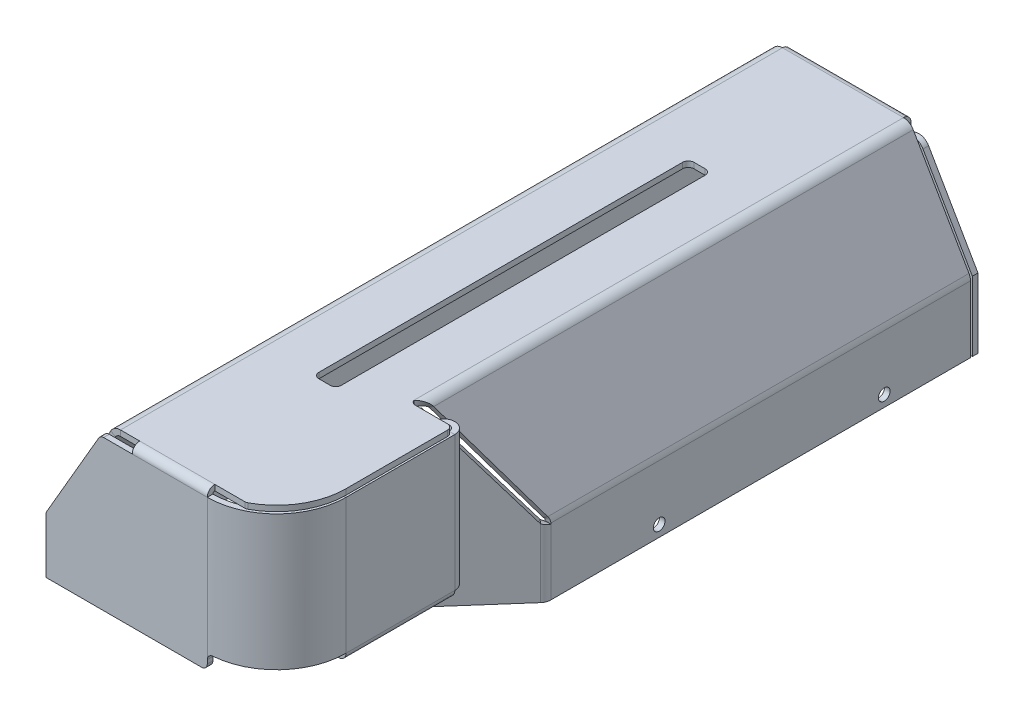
ISO-10303-21;
HEADER;
FILE_DESCRIPTION(('STEP AP214'),'2;1');
FILE_NAME('part.step','',(''),(''),'','','');
FILE_SCHEMA(('AUTOMOTIVE_DESIGN { 1 0 10303 214 1 1 1 1 }'));
ENDSEC;
DATA;
#1=APPLICATION_CONTEXT('core data for automotive mechanical design processes');
#2=APPLICATION_PROTOCOL_DEFINITION('international standard','automotive_design',2000,#1);
#3=PRODUCT_CONTEXT('',#1,'mechanical');
#4=PRODUCT('Part','Part','',(#3));
#5=PRODUCT_RELATED_PRODUCT_CATEGORY('part','',(#4));
#6=PRODUCT_DEFINITION_FORMATION('','',#4);
#7=PRODUCT_DEFINITION_CONTEXT('part definition',#1,'design');
#8=PRODUCT_DEFINITION('design','',#6,#7);
#9=PRODUCT_DEFINITION_SHAPE('','',#8);
#10=(LENGTH_UNIT() NAMED_UNIT(*) SI_UNIT(.MILLI.,.METRE.));
#11=(NAMED_UNIT(*) PLANE_ANGLE_UNIT() SI_UNIT($,.RADIAN.));
#12=(NAMED_UNIT(*) SI_UNIT($,.STERADIAN.) SOLID_ANGLE_UNIT());
#13=UNCERTAINTY_MEASURE_WITH_UNIT(LENGTH_MEASURE(1.E-05),#10,'distance_accuracy_value','');
#14=(GEOMETRIC_REPRESENTATION_CONTEXT(3) GLOBAL_UNCERTAINTY_ASSIGNED_CONTEXT((#13)) GLOBAL_UNIT_ASSIGNED_CONTEXT((#10,
#11,#12)) REPRESENTATION_CONTEXT('',''));
#15=CARTESIAN_POINT('',(0.,0.,0.));
#16=DIRECTION('',(0.,0.,1.));
#17=DIRECTION('',(1.,0.,0.));
#18=AXIS2_PLACEMENT_3D('',#15,#16,#17);
#19=CARTESIAN_POINT('',(0.,6.10034641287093E-13,178.5));
#20=DIRECTION('',(0.,0.,-1.));
#21=DIRECTION('',(0.,1.,0.));
#22=AXIS2_PLACEMENT_3D('',#19,#20,#21);
#23=PLANE('',#22);
#24=DIRECTION('',(-0.501718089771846,-0.865031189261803,0.));
#25=VECTOR('',#24,1.);
#26=CARTESIAN_POINT('',(-9.58842756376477,5.56128798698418,178.5));
#27=LINE('',#26,#25);
#28=CARTESIAN_POINT('',(12.5625201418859,43.7525771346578,178.5));
#29=VERTEX_POINT('',#28);
#30=CARTESIAN_POINT('',(-1.30152138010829,19.8490572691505,178.5));
#31=VERTEX_POINT('',#30);
#32=EDGE_CURVE('E1138',#29,#31,#27,.T.);
#33=ORIENTED_EDGE('',*,*,#32,.T.);
#34=CARTESIAN_POINT('',(-0.00397459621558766,19.0964801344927,178.5));
#35=DIRECTION('',(0.,0.,-1.));
#36=DIRECTION('',(0.,1.,0.));
#37=AXIS2_PLACEMENT_3D('',#34,#35,#36);
#38=CIRCLE('',#37,1.5);
#39=CARTESIAN_POINT('',(-1.50397459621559,19.0964801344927,178.5));
#40=VERTEX_POINT('',#39);
#41=EDGE_CURVE('E1522',#31,#40,#38,.F.);
#42=ORIENTED_EDGE('',*,*,#41,.T.);
#43=DIRECTION('',(0.,1.,0.));
#44=VECTOR('',#43,1.);
#45=CARTESIAN_POINT('',(-1.50397459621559,4.50000000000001,178.5));
#46=LINE('',#45,#44);
#47=CARTESIAN_POINT('',(-1.50397459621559,4.50000000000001,178.5));
#48=VERTEX_POINT('',#47);
#49=EDGE_CURVE('E1239',#48,#40,#46,.T.);
#50=ORIENTED_EDGE('',*,*,#49,.F.);
#51=DIRECTION('',(1.,0.,0.));
#52=VECTOR('',#51,1.);
#53=CARTESIAN_POINT('',(0.,4.50000000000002,178.5));
#54=LINE('',#53,#52);
#55=CARTESIAN_POINT('',(39.9960254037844,4.49999999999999,178.5));
#56=VERTEX_POINT('',#55);
#57=EDGE_CURVE('E542',#48,#56,#54,.T.);
#58=ORIENTED_EDGE('',*,*,#57,.T.);
#59=CARTESIAN_POINT('',(39.9960254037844,5.99999999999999,178.5));
#60=DIRECTION('',(0.,0.,-1.));
#61=DIRECTION('',(0.,1.,0.));
#62=AXIS2_PLACEMENT_3D('',#59,#60,#61);
#63=CIRCLE('',#62,1.5);
#64=CARTESIAN_POINT('',(41.4960254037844,5.99999999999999,178.5));
#65=VERTEX_POINT('',#64);
#66=EDGE_CURVE('E198',#56,#65,#63,.F.);
#67=ORIENTED_EDGE('',*,*,#66,.T.);
#68=DIRECTION('',(0.,1.,0.));
#69=VECTOR('',#68,1.);
#70=CARTESIAN_POINT('',(41.4960254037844,5.88706010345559E-13,178.5));
#71=LINE('',#70,#69);
#72=CARTESIAN_POINT('',(41.4960254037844,6.99999999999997,178.5));
#73=VERTEX_POINT('',#72);
#74=EDGE_CURVE('E535',#65,#73,#71,.T.);
#75=ORIENTED_EDGE('',*,*,#74,.T.);
#76=DIRECTION('',(0.,-1.,0.));
#77=VECTOR('',#76,1.);
#78=CARTESIAN_POINT('',(41.4960254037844,8.49999999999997,178.5));
#79=LINE('',#78,#77);
#80=CARTESIAN_POINT('',(41.4960254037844,44.5,178.5));
#81=VERTEX_POINT('',#80);
#82=EDGE_CURVE('E187',#73,#81,#79,.F.);
#83=ORIENTED_EDGE('',*,*,#82,.T.);
#84=DIRECTION('',(-1.,0.,0.));
#85=VECTOR('',#84,1.);
#86=CARTESIAN_POINT('',(41.4960254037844,44.5,178.5));
#87=LINE('',#86,#85);
#88=CARTESIAN_POINT('',(21.4960254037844,44.5,178.5));
#89=VERTEX_POINT('',#88);
#90=EDGE_CURVE('E235',#89,#81,#87,.F.);
#91=ORIENTED_EDGE('',*,*,#90,.F.);
#92=DIRECTION('',(1.,0.,0.));
#93=VECTOR('',#92,1.);
#94=CARTESIAN_POINT('',(-1.50397459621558,44.5,178.5));
#95=LINE('',#94,#93);
#96=CARTESIAN_POINT('',(13.8600669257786,44.5,178.5));
#97=VERTEX_POINT('',#96);
#98=EDGE_CURVE('E549',#97,#89,#95,.T.);
#99=ORIENTED_EDGE('',*,*,#98,.F.);
#100=CARTESIAN_POINT('',(13.8600669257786,43.,178.5));
#101=DIRECTION('',(0.,0.,-1.));
#102=DIRECTION('',(0.,1.,0.));
#103=AXIS2_PLACEMENT_3D('',#100,#101,#102);
#104=CIRCLE('',#103,1.5);
#105=EDGE_CURVE('E1527',#97,#29,#104,.F.);
#106=ORIENTED_EDGE('',*,*,#105,.T.);
#107=EDGE_LOOP('',(#33,#42,#50,#58,#67,#75,#83,#91,#99,#106));
#108=FACE_BOUND('',#107,.T.);
#109=ADVANCED_FACE('F151',(#108),#23,.F.);
#110=CARTESIAN_POINT('',(0.,6.04797419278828E-13,177.));
#111=DIRECTION('',(0.,0.,-1.));
#112=DIRECTION('',(0.,1.,0.));
#113=AXIS2_PLACEMENT_3D('',#110,#111,#112);
#114=PLANE('',#113);
#115=DIRECTION('',(0.,-1.,0.));
#116=VECTOR('',#115,1.);
#117=CARTESIAN_POINT('',(-1.50397459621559,4.50000000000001,177.));
#118=LINE('',#117,#116);
#119=CARTESIAN_POINT('',(-1.50397459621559,19.0964801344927,177.));
#120=VERTEX_POINT('',#119);
#121=CARTESIAN_POINT('',(-1.50397459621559,4.50000000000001,177.));
#122=VERTEX_POINT('',#121);
#123=EDGE_CURVE('E1228',#120,#122,#118,.T.);
#124=ORIENTED_EDGE('',*,*,#123,.F.);
#125=CARTESIAN_POINT('',(-0.00397459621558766,19.0964801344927,177.));
#126=DIRECTION('',(0.,0.,-1.));
#127=DIRECTION('',(0.,1.,0.));
#128=AXIS2_PLACEMENT_3D('',#125,#126,#127);
#129=CIRCLE('',#128,1.5);
#130=CARTESIAN_POINT('',(-1.30152138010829,19.8490572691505,177.));
#131=VERTEX_POINT('',#130);
#132=EDGE_CURVE('E525',#120,#131,#129,.T.);
#133=ORIENTED_EDGE('',*,*,#132,.T.);
#134=DIRECTION('',(-0.501718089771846,-0.865031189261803,0.));
#135=VECTOR('',#134,1.);
#136=CARTESIAN_POINT('',(-9.58842756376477,5.56128798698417,177.));
#137=LINE('',#136,#135);
#138=CARTESIAN_POINT('',(12.5625201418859,43.7525771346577,177.));
#139=VERTEX_POINT('',#138);
#140=EDGE_CURVE('E1546',#139,#131,#137,.T.);
#141=ORIENTED_EDGE('',*,*,#140,.F.);
#142=CARTESIAN_POINT('',(13.8600669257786,43.,177.));
#143=DIRECTION('',(0.,0.,-1.));
#144=DIRECTION('',(0.,1.,0.));
#145=AXIS2_PLACEMENT_3D('',#142,#143,#144);
#146=CIRCLE('',#145,1.5);
#147=CARTESIAN_POINT('',(13.8600669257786,44.5,177.));
#148=VERTEX_POINT('',#147);
#149=EDGE_CURVE('E226',#139,#148,#146,.T.);
#150=ORIENTED_EDGE('',*,*,#149,.T.);
#151=DIRECTION('',(1.,0.,0.));
#152=VECTOR('',#151,1.);
#153=CARTESIAN_POINT('',(-1.50397459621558,44.5,177.));
#154=LINE('',#153,#152);
#155=CARTESIAN_POINT('',(21.4960254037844,44.5,177.));
#156=VERTEX_POINT('',#155);
#157=EDGE_CURVE('E1241',#148,#156,#154,.T.);
#158=ORIENTED_EDGE('',*,*,#157,.T.);
#159=DIRECTION('',(-1.,0.,0.));
#160=VECTOR('',#159,1.);
#161=CARTESIAN_POINT('',(41.4960254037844,44.5,177.));
#162=LINE('',#161,#160);
#163=CARTESIAN_POINT('',(41.4960254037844,44.5,177.));
#164=VERTEX_POINT('',#163);
#165=EDGE_CURVE('E557',#164,#156,#162,.T.);
#166=ORIENTED_EDGE('',*,*,#165,.F.);
#167=DIRECTION('',(0.,-1.,0.));
#168=VECTOR('',#167,1.);
#169=CARTESIAN_POINT('',(41.4960254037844,8.49999999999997,177.));
#170=LINE('',#169,#168);
#171=CARTESIAN_POINT('',(41.4960254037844,6.99999999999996,177.));
#172=VERTEX_POINT('',#171);
#173=EDGE_CURVE('E168',#172,#164,#170,.F.);
#174=ORIENTED_EDGE('',*,*,#173,.F.);
#175=DIRECTION('',(0.,-1.,0.));
#176=VECTOR('',#175,1.);
#177=CARTESIAN_POINT('',(41.4960254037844,45.,177.));
#178=LINE('',#177,#176);
#179=CARTESIAN_POINT('',(41.4960254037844,5.99999999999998,177.));
#180=VERTEX_POINT('',#179);
#181=EDGE_CURVE('E221',#180,#172,#178,.F.);
#182=ORIENTED_EDGE('',*,*,#181,.F.);
#183=CARTESIAN_POINT('',(39.9960254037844,5.99999999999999,177.));
#184=DIRECTION('',(0.,0.,-1.));
#185=DIRECTION('',(0.,1.,0.));
#186=AXIS2_PLACEMENT_3D('',#183,#184,#185);
#187=CIRCLE('',#186,1.5);
#188=CARTESIAN_POINT('',(39.9960254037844,4.49999999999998,177.));
#189=VERTEX_POINT('',#188);
#190=EDGE_CURVE('E214',#180,#189,#187,.T.);
#191=ORIENTED_EDGE('',*,*,#190,.T.);
#192=DIRECTION('',(-1.,0.,0.));
#193=VECTOR('',#192,1.);
#194=CARTESIAN_POINT('',(41.4960254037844,4.49999999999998,177.));
#195=LINE('',#194,#193);
#196=EDGE_CURVE('E219',#122,#189,#195,.F.);
#197=ORIENTED_EDGE('',*,*,#196,.F.);
#198=EDGE_LOOP('',(#124,#133,#141,#150,#158,#166,#174,#182,#191,#197));
#199=FACE_BOUND('',#198,.T.);
#200=ADVANCED_FACE('F217',(#199),#114,.T.);
#201=CARTESIAN_POINT('',(-1.50397459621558,44.5,177.));
#202=DIRECTION('',(0.,-1.,0.));
#203=DIRECTION('',(1.,0.,0.));
#204=AXIS2_PLACEMENT_3D('',#201,#202,#203);
#205=PLANE('',#204);
#206=ORIENTED_EDGE('',*,*,#157,.F.);
#207=DIRECTION('',(0.,0.,-1.));
#208=VECTOR('',#207,1.);
#209=CARTESIAN_POINT('',(13.8600669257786,44.5,178.5));
#210=LINE('',#209,#208);
#211=EDGE_CURVE('E518',#148,#97,#210,.F.);
#212=ORIENTED_EDGE('',*,*,#211,.T.);
#213=ORIENTED_EDGE('',*,*,#98,.T.);
#214=DIRECTION('',(0.,0.,-1.));
#215=VECTOR('',#214,1.);
#216=CARTESIAN_POINT('',(21.4960254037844,44.5,177.));
#217=LINE('',#216,#215);
#218=EDGE_CURVE('E554',#156,#89,#217,.F.);
#219=ORIENTED_EDGE('',*,*,#218,.F.);
#220=EDGE_LOOP('',(#206,#212,#213,#219));
#221=FACE_BOUND('',#220,.T.);
#222=ADVANCED_FACE('F284',(#221),#205,.F.);
#223=CARTESIAN_POINT('',(-1.5039745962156,0.,0.));
#224=DIRECTION('',(1.,0.,0.));
#225=DIRECTION('',(0.,1.,0.));
#226=AXIS2_PLACEMENT_3D('',#223,#224,#225);
#227=PLANE('',#226);
#228=ORIENTED_EDGE('',*,*,#49,.T.);
#229=DIRECTION('',(0.,0.,-1.));
#230=VECTOR('',#229,1.);
#231=CARTESIAN_POINT('',(-1.50397459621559,19.0964801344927,177.));
#232=LINE('',#231,#230);
#233=EDGE_CURVE('E227',#40,#120,#232,.T.);
#234=ORIENTED_EDGE('',*,*,#233,.T.);
#235=ORIENTED_EDGE('',*,*,#123,.T.);
#236=DIRECTION('',(0.,0.,1.));
#237=VECTOR('',#236,1.);
#238=CARTESIAN_POINT('',(-1.50397459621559,4.50000000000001,177.));
#239=LINE('',#238,#237);
#240=EDGE_CURVE('E234',#122,#48,#239,.T.);
#241=ORIENTED_EDGE('',*,*,#240,.T.);
#242=EDGE_LOOP('',(#228,#234,#235,#241));
#243=FACE_BOUND('',#242,.T.);
#244=ADVANCED_FACE('F280',(#243),#227,.F.);
#245=CARTESIAN_POINT('',(51.2320508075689,45.,176.5));
#246=DIRECTION('',(0.,0.,1.));
#247=DIRECTION('',(1.,0.,0.));
#248=AXIS2_PLACEMENT_3D('',#245,#246,#247);
#249=PLANE('',#248);
#250=DIRECTION('',(1.,0.,0.));
#251=VECTOR('',#250,1.);
#252=CARTESIAN_POINT('',(15.5,45.,176.5));
#253=LINE('',#252,#251);
#254=CARTESIAN_POINT('',(41.4960254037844,45.,176.5));
#255=VERTEX_POINT('',#254);
#256=CARTESIAN_POINT('',(49.4960254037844,45.,176.5));
#257=VERTEX_POINT('',#256);
#258=EDGE_CURVE('E835',#255,#257,#253,.T.);
#259=ORIENTED_EDGE('',*,*,#258,.T.);
#260=DIRECTION('',(0.,1.,0.));
#261=VECTOR('',#260,1.);
#262=CARTESIAN_POINT('',(49.4960254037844,45.,176.5));
#263=LINE('',#262,#261);
#264=CARTESIAN_POINT('',(49.4960254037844,46.5,176.5));
#265=VERTEX_POINT('',#264);
#266=EDGE_CURVE('E1050',#257,#265,#263,.T.);
#267=ORIENTED_EDGE('',*,*,#266,.T.);
#268=DIRECTION('',(1.,0.,0.));
#269=VECTOR('',#268,1.);
#270=CARTESIAN_POINT('',(15.5,46.5,176.5));
#271=LINE('',#270,#269);
#272=CARTESIAN_POINT('',(41.4960254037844,46.5,176.5));
#273=VERTEX_POINT('',#272);
#274=EDGE_CURVE('E811',#273,#265,#271,.T.);
#275=ORIENTED_EDGE('',*,*,#274,.F.);
#276=DIRECTION('',(0.,1.,0.));
#277=VECTOR('',#276,1.);
#278=CARTESIAN_POINT('',(41.4960254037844,45.,176.5));
#279=LINE('',#278,#277);
#280=EDGE_CURVE('E578',#255,#273,#279,.T.);
#281=ORIENTED_EDGE('',*,*,#280,.F.);
#282=EDGE_LOOP('',(#259,#267,#275,#281));
#283=FACE_BOUND('',#282,.T.);
#284=ADVANCED_FACE('F283',(#283),#249,.T.);
#285=CARTESIAN_POINT('',(15.5,46.5,176.5));
#286=DIRECTION('',(0.,1.,0.));
#287=DIRECTION('',(0.,0.,1.));
#288=AXIS2_PLACEMENT_3D('',#285,#286,#287);
#289=PLANE('',#288);
#290=DIRECTION('',(0.,0.,1.));
#291=VECTOR('',#290,1.);
#292=CARTESIAN_POINT('',(29.5,46.5,138.25));
#293=LINE('',#292,#291);
#294=CARTESIAN_POINT('',(29.5,46.5,39.75));
#295=VERTEX_POINT('',#294);
#296=CARTESIAN_POINT('',(29.5,46.5,136.75));
#297=VERTEX_POINT('',#296);
#298=EDGE_CURVE('E581',#295,#297,#293,.T.);
#299=ORIENTED_EDGE('',*,*,#298,.F.);
#300=CARTESIAN_POINT('',(31.,46.5,39.75));
#301=DIRECTION('',(0.,1.,0.));
#302=DIRECTION('',(0.,0.,1.));
#303=AXIS2_PLACEMENT_3D('',#300,#301,#302);
#304=CIRCLE('',#303,1.5);
#305=CARTESIAN_POINT('',(31.,46.5,38.25));
#306=VERTEX_POINT('',#305);
#307=EDGE_CURVE('E1026',#295,#306,#304,.F.);
#308=ORIENTED_EDGE('',*,*,#307,.T.);
#309=DIRECTION('',(-1.,0.,0.));
#310=VECTOR('',#309,1.);
#311=CARTESIAN_POINT('',(35.5,46.5,38.25));
#312=LINE('',#311,#310);
#313=CARTESIAN_POINT('',(34.,46.5,38.25));
#314=VERTEX_POINT('',#313);
#315=EDGE_CURVE('E592',#314,#306,#312,.T.);
#316=ORIENTED_EDGE('',*,*,#315,.F.);
#317=CARTESIAN_POINT('',(34.,46.5,39.75));
#318=DIRECTION('',(0.,1.,0.));
#319=DIRECTION('',(0.,0.,1.));
#320=AXIS2_PLACEMENT_3D('',#317,#318,#319);
#321=CIRCLE('',#320,1.5);
#322=CARTESIAN_POINT('',(35.5,46.5,39.75));
#323=VERTEX_POINT('',#322);
#324=EDGE_CURVE('E1032',#314,#323,#321,.F.);
#325=ORIENTED_EDGE('',*,*,#324,.T.);
#326=DIRECTION('',(0.,0.,-1.));
#327=VECTOR('',#326,1.);
#328=CARTESIAN_POINT('',(35.5,46.5,138.25));
#329=LINE('',#328,#327);
#330=CARTESIAN_POINT('',(35.5,46.5,136.75));
#331=VERTEX_POINT('',#330);
#332=EDGE_CURVE('E589',#331,#323,#329,.T.);
#333=ORIENTED_EDGE('',*,*,#332,.F.);
#334=CARTESIAN_POINT('',(34.,46.5,136.75));
#335=DIRECTION('',(0.,1.,0.));
#336=DIRECTION('',(0.,0.,1.));
#337=AXIS2_PLACEMENT_3D('',#334,#335,#336);
#338=CIRCLE('',#337,1.5);
#339=CARTESIAN_POINT('',(34.,46.5,138.25));
#340=VERTEX_POINT('',#339);
#341=EDGE_CURVE('E1038',#331,#340,#338,.F.);
#342=ORIENTED_EDGE('',*,*,#341,.T.);
#343=DIRECTION('',(1.,0.,0.));
#344=VECTOR('',#343,1.);
#345=CARTESIAN_POINT('',(35.5,46.5,138.25));
#346=LINE('',#345,#344);
#347=CARTESIAN_POINT('',(31.,46.5,138.25));
#348=VERTEX_POINT('',#347);
#349=EDGE_CURVE('E586',#348,#340,#346,.T.);
#350=ORIENTED_EDGE('',*,*,#349,.F.);
#351=CARTESIAN_POINT('',(31.,46.5,136.75));
#352=DIRECTION('',(0.,1.,0.));
#353=DIRECTION('',(0.,0.,1.));
#354=AXIS2_PLACEMENT_3D('',#351,#352,#353);
#355=CIRCLE('',#354,1.5);
#356=EDGE_CURVE('E1044',#348,#297,#355,.F.);
#357=ORIENTED_EDGE('',*,*,#356,.T.);
#358=EDGE_LOOP('',(#299,#308,#316,#325,#333,#342,#350,#357));
#359=FACE_BOUND('',#358,.T.);
#360=ORIENTED_EDGE('',*,*,#274,.T.);
#361=CARTESIAN_POINT('',(49.4960254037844,46.5,175.));
#362=DIRECTION('',(0.,1.,0.));
#363=DIRECTION('',(0.,0.,1.));
#364=AXIS2_PLACEMENT_3D('',#361,#362,#363);
#365=CIRCLE('',#364,1.5);
#366=CARTESIAN_POINT('',(50.2019077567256,46.5,176.323529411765));
#367=VERTEX_POINT('',#366);
#368=EDGE_CURVE('E1056',#265,#367,#365,.T.);
#369=ORIENTED_EDGE('',*,*,#368,.T.);
#370=CARTESIAN_POINT('',(41.4960254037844,46.5,160.));
#371=DIRECTION('',(0.,1.,0.));
#372=DIRECTION('',(0.,0.,1.));
#373=AXIS2_PLACEMENT_3D('',#370,#371,#372);
#374=CIRCLE('',#373,18.5);
#375=CARTESIAN_POINT('',(59.9960254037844,46.5,160.));
#376=VERTEX_POINT('',#375);
#377=EDGE_CURVE('E1131',#367,#376,#374,.T.);
#378=ORIENTED_EDGE('',*,*,#377,.T.);
#379=DIRECTION('',(0.,0.,1.));
#380=VECTOR('',#379,1.);
#381=CARTESIAN_POINT('',(59.9960254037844,46.5,176.5));
#382=LINE('',#381,#380);
#383=CARTESIAN_POINT('',(59.9960254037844,46.5,133.));
#384=VERTEX_POINT('',#383);
#385=EDGE_CURVE('E1135',#376,#384,#382,.F.);
#386=ORIENTED_EDGE('',*,*,#385,.T.);
#387=CARTESIAN_POINT('',(58.4960254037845,46.5,133.));
#388=DIRECTION('',(0.,1.,0.));
#389=DIRECTION('',(0.,0.,1.));
#390=AXIS2_PLACEMENT_3D('',#387,#388,#389);
#391=CIRCLE('',#390,1.5);
#392=CARTESIAN_POINT('',(58.4960254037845,46.5,131.5));
#393=VERTEX_POINT('',#392);
#394=EDGE_CURVE('E1053',#384,#393,#391,.T.);
#395=ORIENTED_EDGE('',*,*,#394,.T.);
#396=DIRECTION('',(-1.,0.,0.));
#397=VECTOR('',#396,1.);
#398=CARTESIAN_POINT('',(68.6339745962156,46.5,131.5));
#399=LINE('',#398,#397);
#400=CARTESIAN_POINT('',(50.0245497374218,46.5,131.5));
#401=VERTEX_POINT('',#400);
#402=EDGE_CURVE('E1198',#393,#401,#399,.T.);
#403=ORIENTED_EDGE('',*,*,#402,.T.);
#404=CARTESIAN_POINT('',(50.0245497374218,46.5,130.));
#405=DIRECTION('',(0.,1.,0.));
#406=DIRECTION('',(0.,0.,1.));
#407=AXIS2_PLACEMENT_3D('',#404,#405,#406);
#408=CIRCLE('',#407,1.5);
#409=CARTESIAN_POINT('',(48.6339745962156,46.5,130.562406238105));
#410=VERTEX_POINT('',#409);
#411=EDGE_CURVE('E237',#401,#410,#408,.F.);
#412=ORIENTED_EDGE('',*,*,#411,.T.);
#413=DIRECTION('',(0.,0.,-1.));
#414=VECTOR('',#413,1.);
#415=CARTESIAN_POINT('',(48.6339745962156,46.5,176.5));
#416=LINE('',#415,#414);
#417=CARTESIAN_POINT('',(48.6339745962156,46.5,0.));
#418=VERTEX_POINT('',#417);
#419=EDGE_CURVE('E938',#410,#418,#416,.T.);
#420=ORIENTED_EDGE('',*,*,#419,.T.);
#421=DIRECTION('',(1.,0.,0.));
#422=VECTOR('',#421,1.);
#423=CARTESIAN_POINT('',(15.5,46.5,0.));
#424=LINE('',#423,#422);
#425=CARTESIAN_POINT('',(16.3660254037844,46.5,0.));
#426=VERTEX_POINT('',#425);
#427=EDGE_CURVE('E856',#426,#418,#424,.T.);
#428=ORIENTED_EDGE('',*,*,#427,.F.);
#429=DIRECTION('',(0.,0.,-1.));
#430=VECTOR('',#429,1.);
#431=CARTESIAN_POINT('',(16.3660254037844,46.5,176.5));
#432=LINE('',#431,#430);
#433=CARTESIAN_POINT('',(16.3660254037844,46.5,176.5));
#434=VERTEX_POINT('',#433);
#435=EDGE_CURVE('E935',#434,#426,#432,.T.);
#436=ORIENTED_EDGE('',*,*,#435,.F.);
#437=CARTESIAN_POINT('',(21.4960254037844,46.5,176.5));
#438=VERTEX_POINT('',#437);
#439=EDGE_CURVE('E807',#434,#438,#271,.T.);
#440=ORIENTED_EDGE('',*,*,#439,.T.);
#441=DIRECTION('',(-1.,0.,0.));
#442=VECTOR('',#441,1.);
#443=CARTESIAN_POINT('',(21.4960254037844,46.5,176.5));
#444=LINE('',#443,#442);
#445=EDGE_CURVE('E563',#438,#273,#444,.F.);
#446=ORIENTED_EDGE('',*,*,#445,.T.);
#447=EDGE_LOOP('',(#360,#369,#378,#386,#395,#403,#412,#420,#428,#436,#440,#446));
#448=FACE_BOUND('',#447,.T.);
#449=ADVANCED_FACE('F1541',(#359,#448),#289,.T.);
#450=CARTESIAN_POINT('',(15.5,45.,176.5));
#451=DIRECTION('',(0.,1.,0.));
#452=DIRECTION('',(0.,0.,1.));
#453=AXIS2_PLACEMENT_3D('',#450,#451,#452);
#454=PLANE('',#453);
#455=DIRECTION('',(0.,0.,-1.));
#456=VECTOR('',#455,1.);
#457=CARTESIAN_POINT('',(35.5,45.,176.5));
#458=LINE('',#457,#456);
#459=CARTESIAN_POINT('',(35.5,45.,136.75));
#460=VERTEX_POINT('',#459);
#461=CARTESIAN_POINT('',(35.5,45.,39.75));
#462=VERTEX_POINT('',#461);
#463=EDGE_CURVE('E993',#460,#462,#458,.T.);
#464=ORIENTED_EDGE('',*,*,#463,.T.);
#465=CARTESIAN_POINT('',(34.,45.,39.75));
#466=DIRECTION('',(0.,1.,0.));
#467=DIRECTION('',(0.,0.,1.));
#468=AXIS2_PLACEMENT_3D('',#465,#466,#467);
#469=CIRCLE('',#468,1.5);
#470=CARTESIAN_POINT('',(34.,45.,38.25));
#471=VERTEX_POINT('',#470);
#472=EDGE_CURVE('E1035',#462,#471,#469,.T.);
#473=ORIENTED_EDGE('',*,*,#472,.T.);
#474=DIRECTION('',(-1.,0.,0.));
#475=VECTOR('',#474,1.);
#476=CARTESIAN_POINT('',(15.5,45.,38.25));
#477=LINE('',#476,#475);
#478=CARTESIAN_POINT('',(31.,45.,38.25));
#479=VERTEX_POINT('',#478);
#480=EDGE_CURVE('E996',#471,#479,#477,.T.);
#481=ORIENTED_EDGE('',*,*,#480,.T.);
#482=CARTESIAN_POINT('',(31.,45.,39.75));
#483=DIRECTION('',(0.,1.,0.));
#484=DIRECTION('',(0.,0.,1.));
#485=AXIS2_PLACEMENT_3D('',#482,#483,#484);
#486=CIRCLE('',#485,1.5);
#487=CARTESIAN_POINT('',(29.5,45.,39.75));
#488=VERTEX_POINT('',#487);
#489=EDGE_CURVE('E1029',#479,#488,#486,.T.);
#490=ORIENTED_EDGE('',*,*,#489,.T.);
#491=DIRECTION('',(0.,0.,1.));
#492=VECTOR('',#491,1.);
#493=CARTESIAN_POINT('',(29.5,45.,176.5));
#494=LINE('',#493,#492);
#495=CARTESIAN_POINT('',(29.5,45.,136.75));
#496=VERTEX_POINT('',#495);
#497=EDGE_CURVE('E999',#488,#496,#494,.T.);
#498=ORIENTED_EDGE('',*,*,#497,.T.);
#499=CARTESIAN_POINT('',(31.,45.,136.75));
#500=DIRECTION('',(0.,1.,0.));
#501=DIRECTION('',(0.,0.,1.));
#502=AXIS2_PLACEMENT_3D('',#499,#500,#501);
#503=CIRCLE('',#502,1.5);
#504=CARTESIAN_POINT('',(31.,45.,138.25));
#505=VERTEX_POINT('',#504);
#506=EDGE_CURVE('E1047',#496,#505,#503,.T.);
#507=ORIENTED_EDGE('',*,*,#506,.T.);
#508=DIRECTION('',(1.,0.,0.));
#509=VECTOR('',#508,1.);
#510=CARTESIAN_POINT('',(15.5,45.,138.25));
#511=LINE('',#510,#509);
#512=CARTESIAN_POINT('',(34.,45.,138.25));
#513=VERTEX_POINT('',#512);
#514=EDGE_CURVE('E990',#505,#513,#511,.T.);
#515=ORIENTED_EDGE('',*,*,#514,.T.);
#516=CARTESIAN_POINT('',(34.,45.,136.75));
#517=DIRECTION('',(0.,1.,0.));
#518=DIRECTION('',(0.,0.,1.));
#519=AXIS2_PLACEMENT_3D('',#516,#517,#518);
#520=CIRCLE('',#519,1.5);
#521=EDGE_CURVE('E1041',#513,#460,#520,.T.);
#522=ORIENTED_EDGE('',*,*,#521,.T.);
#523=EDGE_LOOP('',(#464,#473,#481,#490,#498,#507,#515,#522));
#524=FACE_BOUND('',#523,.T.);
#525=CARTESIAN_POINT('',(41.4960254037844,45.,160.));
#526=DIRECTION('',(0.,1.,0.));
#527=DIRECTION('',(0.,0.,-1.));
#528=AXIS2_PLACEMENT_3D('',#525,#526,#527);
#529=CIRCLE('',#528,18.5);
#530=CARTESIAN_POINT('',(50.2019077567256,45.,176.323529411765));
#531=VERTEX_POINT('',#530);
#532=CARTESIAN_POINT('',(59.9960254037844,45.,160.));
#533=VERTEX_POINT('',#532);
#534=EDGE_CURVE('E1132',#531,#533,#529,.T.);
#535=ORIENTED_EDGE('',*,*,#534,.F.);
#536=CARTESIAN_POINT('',(49.4960254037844,45.,175.));
#537=DIRECTION('',(0.,1.,0.));
#538=DIRECTION('',(0.,0.,1.));
#539=AXIS2_PLACEMENT_3D('',#536,#537,#538);
#540=CIRCLE('',#539,1.5);
#541=EDGE_CURVE('E1065',#531,#257,#540,.F.);
#542=ORIENTED_EDGE('',*,*,#541,.T.);
#543=ORIENTED_EDGE('',*,*,#258,.F.);
#544=DIRECTION('',(-1.,0.,0.));
#545=VECTOR('',#544,1.);
#546=CARTESIAN_POINT('',(21.4960254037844,45.,176.5));
#547=LINE('',#546,#545);
#548=CARTESIAN_POINT('',(21.4960254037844,45.,176.5));
#549=VERTEX_POINT('',#548);
#550=EDGE_CURVE('E545',#549,#255,#547,.F.);
#551=ORIENTED_EDGE('',*,*,#550,.F.);
#552=CARTESIAN_POINT('',(16.3660254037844,45.,176.5));
#553=VERTEX_POINT('',#552);
#554=EDGE_CURVE('E836',#553,#549,#253,.T.);
#555=ORIENTED_EDGE('',*,*,#554,.F.);
#556=DIRECTION('',(0.,0.,-1.));
#557=VECTOR('',#556,1.);
#558=CARTESIAN_POINT('',(16.3660254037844,45.,176.5));
#559=LINE('',#558,#557);
#560=CARTESIAN_POINT('',(16.3660254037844,45.,0.));
#561=VERTEX_POINT('',#560);
#562=EDGE_CURVE('E908',#553,#561,#559,.T.);
#563=ORIENTED_EDGE('',*,*,#562,.T.);
#564=DIRECTION('',(1.,0.,0.));
#565=VECTOR('',#564,1.);
#566=CARTESIAN_POINT('',(15.5,45.,0.));
#567=LINE('',#566,#565);
#568=CARTESIAN_POINT('',(48.6339745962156,45.,0.));
#569=VERTEX_POINT('',#568);
#570=EDGE_CURVE('E886',#561,#569,#567,.T.);
#571=ORIENTED_EDGE('',*,*,#570,.T.);
#572=DIRECTION('',(0.,0.,-1.));
#573=VECTOR('',#572,1.);
#574=CARTESIAN_POINT('',(48.6339745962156,45.,176.5));
#575=LINE('',#574,#573);
#576=CARTESIAN_POINT('',(48.6339745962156,45.,130.562406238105));
#577=VERTEX_POINT('',#576);
#578=EDGE_CURVE('E905',#577,#569,#575,.T.);
#579=ORIENTED_EDGE('',*,*,#578,.F.);
#580=CARTESIAN_POINT('',(50.0245497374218,45.,130.));
#581=DIRECTION('',(0.,1.,0.));
#582=DIRECTION('',(0.,0.,1.));
#583=AXIS2_PLACEMENT_3D('',#580,#581,#582);
#584=CIRCLE('',#583,1.5);
#585=CARTESIAN_POINT('',(50.0245497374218,45.,131.5));
#586=VERTEX_POINT('',#585);
#587=EDGE_CURVE('E241',#577,#586,#584,.T.);
#588=ORIENTED_EDGE('',*,*,#587,.T.);
#589=DIRECTION('',(-1.,0.,0.));
#590=VECTOR('',#589,1.);
#591=CARTESIAN_POINT('',(68.6339745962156,45.,131.5));
#592=LINE('',#591,#590);
#593=CARTESIAN_POINT('',(58.4960254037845,45.,131.5));
#594=VERTEX_POINT('',#593);
#595=EDGE_CURVE('E1121',#594,#586,#592,.T.);
#596=ORIENTED_EDGE('',*,*,#595,.F.);
#597=CARTESIAN_POINT('',(58.4960254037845,45.,133.));
#598=DIRECTION('',(0.,1.,0.));
#599=DIRECTION('',(0.,0.,1.));
#600=AXIS2_PLACEMENT_3D('',#597,#598,#599);
#601=CIRCLE('',#600,1.5);
#602=CARTESIAN_POINT('',(59.9960254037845,45.,133.));
#603=VERTEX_POINT('',#602);
#604=EDGE_CURVE('E1062',#594,#603,#601,.F.);
#605=ORIENTED_EDGE('',*,*,#604,.T.);
#606=DIRECTION('',(0.,0.,-1.));
#607=VECTOR('',#606,1.);
#608=CARTESIAN_POINT('',(59.9960254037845,45.,131.5));
#609=LINE('',#608,#607);
#610=EDGE_CURVE('E1119',#533,#603,#609,.T.);
#611=ORIENTED_EDGE('',*,*,#610,.F.);
#612=EDGE_LOOP('',(#535,#542,#543,#551,#555,#563,#571,#579,#588,#596,#605,#611));
#613=FACE_BOUND('',#612,.T.);
#614=ADVANCED_FACE('F1117',(#524,#613),#454,.F.);
#615=CARTESIAN_POINT('',(68.6339745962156,46.5,131.5));
#616=DIRECTION('',(0.,0.,1.));
#617=DIRECTION('',(1.,0.,0.));
#618=AXIS2_PLACEMENT_3D('',#615,#616,#617);
#619=PLANE('',#618);
#620=ORIENTED_EDGE('',*,*,#402,.F.);
#621=DIRECTION('',(0.,1.,0.));
#622=VECTOR('',#621,1.);
#623=CARTESIAN_POINT('',(58.4960254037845,45.,131.5));
#624=LINE('',#623,#622);
#625=EDGE_CURVE('E1079',#393,#594,#624,.F.);
#626=ORIENTED_EDGE('',*,*,#625,.T.);
#627=ORIENTED_EDGE('',*,*,#595,.T.);
#628=CARTESIAN_POINT('',(48.6339745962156,49.125000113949,130.562406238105));
#629=CARTESIAN_POINT('',(49.0131763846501,49.1250000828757,131.5));
#630=CARTESIAN_POINT('',(50.0245497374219,49.125,131.5));
#631=CARTESIAN_POINT('',(48.6339745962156,48.6249998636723,130.562406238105));
#632=CARTESIAN_POINT('',(49.0131763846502,48.624999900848,131.5));
#633=CARTESIAN_POINT('',(50.0245497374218,48.625,131.5));
#634=CARTESIAN_POINT('',(48.6339745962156,48.1249998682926,130.562406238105));
#635=CARTESIAN_POINT('',(49.0131763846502,48.1249999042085,131.5));
#636=CARTESIAN_POINT('',(50.0245497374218,48.125,131.5));
#637=CARTESIAN_POINT('',(48.6339745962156,47.124999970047,130.562406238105));
#638=CARTESIAN_POINT('',(49.0131763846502,47.1249999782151,131.5));
#639=CARTESIAN_POINT('',(50.0245497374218,47.125,131.5));
#640=CARTESIAN_POINT('',(48.6339745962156,46.6250000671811,130.562406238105));
#641=CARTESIAN_POINT('',(49.0131763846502,46.6250000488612,131.5));
#642=CARTESIAN_POINT('',(50.0245497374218,46.625,131.5));
#643=CARTESIAN_POINT('',(48.6339745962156,46.0624999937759,130.562406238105));
#644=CARTESIAN_POINT('',(49.0131763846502,46.0624999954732,131.5));
#645=CARTESIAN_POINT('',(50.0245497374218,46.0625,131.5));
#646=CARTESIAN_POINT('',(48.6339745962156,45.9999999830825,130.562406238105));
#647=CARTESIAN_POINT('',(49.0131763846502,45.9999999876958,131.5));
#648=CARTESIAN_POINT('',(50.0245497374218,46.,131.5));
#649=CARTESIAN_POINT('',(48.6339745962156,45.8749999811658,130.562406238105));
#650=CARTESIAN_POINT('',(49.0131763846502,45.8749999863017,131.5));
#651=CARTESIAN_POINT('',(50.0245497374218,45.875,131.5));
#652=CARTESIAN_POINT('',(48.6339745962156,45.8124999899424,130.562406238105));
#653=CARTESIAN_POINT('',(49.0131763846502,45.812499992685,131.5));
#654=CARTESIAN_POINT('',(50.0245497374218,45.8125,131.5));
#655=CARTESIAN_POINT('',(48.6339745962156,45.500000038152,130.562406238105));
#656=CARTESIAN_POINT('',(49.0131763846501,45.5000000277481,131.5));
#657=CARTESIAN_POINT('',(50.0245497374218,45.5,131.5));
#658=CARTESIAN_POINT('',(48.6339745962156,45.2500000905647,130.562406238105));
#659=CARTESIAN_POINT('',(49.0131763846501,45.2500000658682,131.5));
#660=CARTESIAN_POINT('',(50.0245497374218,45.25,131.5));
#661=CARTESIAN_POINT('',(48.6339745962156,44.7500001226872,130.562406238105));
#662=CARTESIAN_POINT('',(49.0131763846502,44.7500000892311,131.5));
#663=CARTESIAN_POINT('',(50.0245497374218,44.75,131.5));
#664=CARTESIAN_POINT('',(48.6339745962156,44.500000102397,130.562406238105));
#665=CARTESIAN_POINT('',(49.0131763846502,44.500000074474,131.5));
#666=CARTESIAN_POINT('',(50.0245497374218,44.5,131.5));
#667=CARTESIAN_POINT('',(48.6339745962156,44.2499999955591,130.562406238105));
#668=CARTESIAN_POINT('',(49.0131763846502,44.2499999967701,131.5));
#669=CARTESIAN_POINT('',(50.0245497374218,44.25,131.5));
#670=(BOUNDED_SURFACE() B_SPLINE_SURFACE(3,2,((#628,#629,#630),(#631,#632,#633),(#634,#635,
#636),(#637,#638,#639),(#640,#641,#642),(#643,#644,#645),(#646,#647,#648),(#649,#650,#651),
(#652,#653,#654),(#655,#656,#657),(#658,#659,#660),(#661,#662,#663),(#664,#665,#666),(#667,#668,
#669)),.UNSPECIFIED.,.F.,.F.,.F.) B_SPLINE_SURFACE_WITH_KNOTS((4,2,2,2,2,2,4),(3,3),(0.,
1.49999999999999,3.,3.1875,3.375,4.125,4.875),(0.,1.),
.UNSPECIFIED.) GEOMETRIC_REPRESENTATION_ITEM() RATIONAL_B_SPLINE_SURFACE(((1.,0.829137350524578,
1.),(1.,0.829137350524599,1.),(1.,0.829137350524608,1.),(1.,0.829137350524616,1.),(1.,
0.829137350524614,1.),(1.,0.829137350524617,1.),(1.,0.829137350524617,1.),(1.,0.829137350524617,
1.),(1.,0.829137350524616,1.),(1.,0.829137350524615,1.),(1.,0.829137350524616,1.),(1.,
0.829137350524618,1.),(1.,0.829137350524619,1.),(1.,0.829137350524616,1.))) REPRESENTATION_ITEM('') SURFACE());
#671=CARTESIAN_POINT('',(50.0245497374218,44.25,131.5));
#672=CARTESIAN_POINT('',(50.0245497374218,44.5,131.5));
#673=CARTESIAN_POINT('',(50.0245497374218,44.75,131.5));
#674=CARTESIAN_POINT('',(50.0245497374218,45.25,131.5));
#675=CARTESIAN_POINT('',(50.0245497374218,45.5,131.5));
#676=CARTESIAN_POINT('',(50.0245497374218,45.8125,131.5));
#677=CARTESIAN_POINT('',(50.0245497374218,45.875,131.5));
#678=CARTESIAN_POINT('',(50.0245497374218,46.,131.5));
#679=CARTESIAN_POINT('',(50.0245497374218,46.0625,131.5));
#680=CARTESIAN_POINT('',(50.0245497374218,46.625,131.5));
#681=CARTESIAN_POINT('',(50.0245497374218,47.125,131.5));
#682=CARTESIAN_POINT('',(50.0245497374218,48.125,131.5));
#683=CARTESIAN_POINT('',(50.0245497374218,48.625,131.5));
#684=CARTESIAN_POINT('',(50.0245497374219,49.125,131.5));
#685=B_SPLINE_CURVE_WITH_KNOTS('',3,(#671,#672,#673,#674,#675,#676,#677,#678,#679,#680,#681,
#682,#683,#684),.UNSPECIFIED.,.F.,.F.,(4,2,2,2,2,2,4),(0.,0.750000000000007,1.5,1.6875,1.875,
3.37500000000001,4.875),.UNSPECIFIED.);
#686=EDGE_CURVE('E1071',#586,#401,#685,.T.);
#687=ORIENTED_EDGE('',*,*,#686,.T.);
#688=EDGE_LOOP('',(#620,#626,#627,#687));
#689=FACE_BOUND('',#688,.T.);
#690=ADVANCED_FACE('F1081',(#689),#619,.F.);
#691=ORIENTED_EDGE('',*,*,#554,.T.);
#692=DIRECTION('',(0.,1.,0.));
#693=VECTOR('',#692,1.);
#694=CARTESIAN_POINT('',(21.4960254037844,45.,176.5));
#695=LINE('',#694,#693);
#696=EDGE_CURVE('E570',#549,#438,#695,.T.);
#697=ORIENTED_EDGE('',*,*,#696,.T.);
#698=ORIENTED_EDGE('',*,*,#439,.F.);
#699=DIRECTION('',(0.,-1.,0.));
#700=VECTOR('',#699,1.);
#701=CARTESIAN_POINT('',(16.3660254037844,46.5,176.5));
#702=LINE('',#701,#700);
#703=EDGE_CURVE('E972',#434,#553,#702,.T.);
#704=ORIENTED_EDGE('',*,*,#703,.T.);
#705=EDGE_LOOP('',(#691,#697,#698,#704));
#706=FACE_BOUND('',#705,.T.);
#707=ADVANCED_FACE('F1267',(#706),#249,.T.);
#708=CARTESIAN_POINT('',(66.5,18.1532124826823,111.899581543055));
#709=DIRECTION('',(0.,0.,-1.));
#710=DIRECTION('',(0.,1.,0.));
#711=AXIS2_PLACEMENT_3D('',#708,#709,#710);
#712=PLANE('',#711);
#713=DIRECTION('',(0.,1.,0.));
#714=VECTOR('',#713,1.);
#715=CARTESIAN_POINT('',(65.,18.1532124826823,111.899581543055));
#716=LINE('',#715,#714);
#717=CARTESIAN_POINT('',(65.,17.5000000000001,111.899581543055));
#718=VERTEX_POINT('',#717);
#719=CARTESIAN_POINT('',(65.,17.7512886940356,111.899581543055));
#720=VERTEX_POINT('',#719);
#721=EDGE_CURVE('E764',#718,#720,#716,.T.);
#722=ORIENTED_EDGE('',*,*,#721,.F.);
#723=DIRECTION('',(1.,0.,0.));
#724=VECTOR('',#723,1.);
#725=CARTESIAN_POINT('',(65.,17.5000000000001,111.899581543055));
#726=LINE('',#725,#724);
#727=CARTESIAN_POINT('',(66.5,17.5000000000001,111.899581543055));
#728=VERTEX_POINT('',#727);
#729=EDGE_CURVE('E437',#718,#728,#726,.T.);
#730=ORIENTED_EDGE('',*,*,#729,.T.);
#731=DIRECTION('',(0.,1.,0.));
#732=VECTOR('',#731,1.);
#733=CARTESIAN_POINT('',(66.5,18.1532124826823,111.899581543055));
#734=LINE('',#733,#732);
#735=CARTESIAN_POINT('',(66.5,17.7512886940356,111.899581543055));
#736=VERTEX_POINT('',#735);
#737=EDGE_CURVE('E792',#728,#736,#734,.T.);
#738=ORIENTED_EDGE('',*,*,#737,.T.);
#739=DIRECTION('',(1.,0.,0.));
#740=VECTOR('',#739,1.);
#741=CARTESIAN_POINT('',(66.5,17.7512886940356,111.899581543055));
#742=LINE('',#741,#740);
#743=EDGE_CURVE('E771',#736,#720,#742,.F.);
#744=ORIENTED_EDGE('',*,*,#743,.T.);
#745=EDGE_LOOP('',(#722,#730,#738,#744));
#746=FACE_BOUND('',#745,.T.);
#747=ADVANCED_FACE('F765',(#746),#712,.F.);
#748=CARTESIAN_POINT('',(65.,18.1532124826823,176.5));
#749=DIRECTION('',(1.,0.,0.));
#750=DIRECTION('',(0.,1.,0.));
#751=AXIS2_PLACEMENT_3D('',#748,#749,#750);
#752=PLANE('',#751);
#753=CARTESIAN_POINT('',(65.,3.00000000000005,83.));
#754=DIRECTION('',(1.,0.,0.));
#755=DIRECTION('',(0.,1.,0.));
#756=AXIS2_PLACEMENT_3D('',#753,#754,#755);
#757=CIRCLE('',#756,1.54999999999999);
#758=CARTESIAN_POINT('',(65.,4.55000000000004,83.));
#759=VERTEX_POINT('',#758);
#760=EDGE_CURVE('E1623',#759,#759,#757,.T.);
#761=ORIENTED_EDGE('',*,*,#760,.T.);
#762=EDGE_LOOP('',(#761));
#763=FACE_BOUND('',#762,.T.);
#764=CARTESIAN_POINT('',(65.,3.00000000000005,23.));
#765=DIRECTION('',(1.,0.,0.));
#766=DIRECTION('',(0.,1.,0.));
#767=AXIS2_PLACEMENT_3D('',#764,#765,#766);
#768=CIRCLE('',#767,1.55);
#769=CARTESIAN_POINT('',(65.,4.55000000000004,23.));
#770=VERTEX_POINT('',#769);
#771=EDGE_CURVE('E1614',#770,#770,#768,.T.);
#772=ORIENTED_EDGE('',*,*,#771,.T.);
#773=EDGE_LOOP('',(#772));
#774=FACE_BOUND('',#773,.T.);
#775=CARTESIAN_POINT('',(65.,0.,111.899581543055));
#776=VERTEX_POINT('',#775);
#777=EDGE_CURVE('E755',#776,#718,#716,.T.);
#778=ORIENTED_EDGE('',*,*,#777,.T.);
#779=ORIENTED_EDGE('',*,*,#721,.T.);
#780=DIRECTION('',(0.,0.,-1.));
#781=VECTOR('',#780,1.);
#782=CARTESIAN_POINT('',(65.,17.7512886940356,176.5));
#783=LINE('',#782,#781);
#784=CARTESIAN_POINT('',(65.,17.7512886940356,0.));
#785=VERTEX_POINT('',#784);
#786=EDGE_CURVE('E839',#720,#785,#783,.T.);
#787=ORIENTED_EDGE('',*,*,#786,.T.);
#788=DIRECTION('',(0.,-1.,0.));
#789=VECTOR('',#788,1.);
#790=CARTESIAN_POINT('',(65.,18.1532124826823,0.));
#791=LINE('',#790,#789);
#792=CARTESIAN_POINT('',(65.,0.,0.));
#793=VERTEX_POINT('',#792);
#794=EDGE_CURVE('E804',#785,#793,#791,.T.);
#795=ORIENTED_EDGE('',*,*,#794,.T.);
#796=DIRECTION('',(0.,0.,-1.));
#797=VECTOR('',#796,1.);
#798=CARTESIAN_POINT('',(65.,0.,176.5));
#799=LINE('',#798,#797);
#800=EDGE_CURVE('E782',#776,#793,#799,.T.);
#801=ORIENTED_EDGE('',*,*,#800,.F.);
#802=EDGE_LOOP('',(#778,#779,#787,#795,#801));
#803=FACE_BOUND('',#802,.T.);
#804=ADVANCED_FACE('F779',(#763,#774,#803),#752,.F.);
#805=CARTESIAN_POINT('',(66.5,0.,176.5));
#806=DIRECTION('',(0.,-1.,0.));
#807=DIRECTION('',(1.,0.,0.));
#808=AXIS2_PLACEMENT_3D('',#805,#806,#807);
#809=PLANE('',#808);
#810=DIRECTION('',(0.,0.,-1.));
#811=VECTOR('',#810,1.);
#812=CARTESIAN_POINT('',(66.5,0.,176.5));
#813=LINE('',#812,#811);
#814=CARTESIAN_POINT('',(66.5,1.00613961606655E-13,111.899581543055));
#815=VERTEX_POINT('',#814);
#816=CARTESIAN_POINT('',(66.5,0.,0.));
#817=VERTEX_POINT('',#816);
#818=EDGE_CURVE('E950',#815,#817,#813,.T.);
#819=ORIENTED_EDGE('',*,*,#818,.F.);
#820=DIRECTION('',(1.,0.,0.));
#821=VECTOR('',#820,1.);
#822=CARTESIAN_POINT('',(66.5,0.,111.899581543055));
#823=LINE('',#822,#821);
#824=EDGE_CURVE('E783',#815,#776,#823,.F.);
#825=ORIENTED_EDGE('',*,*,#824,.T.);
#826=ORIENTED_EDGE('',*,*,#800,.T.);
#827=DIRECTION('',(-1.,0.,0.));
#828=VECTOR('',#827,1.);
#829=CARTESIAN_POINT('',(66.5,0.,0.));
#830=LINE('',#829,#828);
#831=EDGE_CURVE('E841',#817,#793,#830,.T.);
#832=ORIENTED_EDGE('',*,*,#831,.F.);
#833=EDGE_LOOP('',(#819,#825,#826,#832));
#834=FACE_BOUND('',#833,.T.);
#835=ADVANCED_FACE('F1637',(#834),#809,.T.);
#836=CARTESIAN_POINT('',(66.5,18.1532124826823,176.5));
#837=DIRECTION('',(1.,0.,0.));
#838=DIRECTION('',(0.,1.,0.));
#839=AXIS2_PLACEMENT_3D('',#836,#837,#838);
#840=PLANE('',#839);
#841=CARTESIAN_POINT('',(66.5,3.00000000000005,83.));
#842=DIRECTION('',(1.,0.,0.));
#843=DIRECTION('',(0.,1.,0.));
#844=AXIS2_PLACEMENT_3D('',#841,#842,#843);
#845=CIRCLE('',#844,1.54999999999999);
#846=CARTESIAN_POINT('',(66.5,4.55000000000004,83.));
#847=VERTEX_POINT('',#846);
#848=EDGE_CURVE('E1626',#847,#847,#845,.T.);
#849=ORIENTED_EDGE('',*,*,#848,.F.);
#850=EDGE_LOOP('',(#849));
#851=FACE_BOUND('',#850,.T.);
#852=CARTESIAN_POINT('',(66.5,3.00000000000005,23.));
#853=DIRECTION('',(1.,0.,0.));
#854=DIRECTION('',(0.,1.,0.));
#855=AXIS2_PLACEMENT_3D('',#852,#853,#854);
#856=CIRCLE('',#855,1.55);
#857=CARTESIAN_POINT('',(66.5,4.55000000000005,23.));
#858=VERTEX_POINT('',#857);
#859=EDGE_CURVE('E1620',#858,#858,#856,.T.);
#860=ORIENTED_EDGE('',*,*,#859,.F.);
#861=EDGE_LOOP('',(#860));
#862=FACE_BOUND('',#861,.T.);
#863=DIRECTION('',(0.,0.,-1.));
#864=VECTOR('',#863,1.);
#865=CARTESIAN_POINT('',(66.5,17.7512886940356,176.5));
#866=LINE('',#865,#864);
#867=CARTESIAN_POINT('',(66.5,17.7512886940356,0.));
#868=VERTEX_POINT('',#867);
#869=EDGE_CURVE('E947',#736,#868,#866,.T.);
#870=ORIENTED_EDGE('',*,*,#869,.F.);
#871=ORIENTED_EDGE('',*,*,#737,.F.);
#872=EDGE_CURVE('E776',#815,#728,#734,.T.);
#873=ORIENTED_EDGE('',*,*,#872,.F.);
#874=ORIENTED_EDGE('',*,*,#818,.T.);
#875=DIRECTION('',(0.,-1.,0.));
#876=VECTOR('',#875,1.);
#877=CARTESIAN_POINT('',(66.5,18.1532124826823,0.));
#878=LINE('',#877,#876);
#879=EDGE_CURVE('E844',#868,#817,#878,.T.);
#880=ORIENTED_EDGE('',*,*,#879,.F.);
#881=EDGE_LOOP('',(#870,#871,#873,#874,#880));
#882=FACE_BOUND('',#881,.T.);
#883=ADVANCED_FACE('F1633',(#851,#862,#882),#840,.T.);
#884=CARTESIAN_POINT('',(63.5,17.7512886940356,176.5));
#885=DIRECTION('',(0.,0.,-1.));
#886=DIRECTION('',(-1.,0.,0.));
#887=AXIS2_PLACEMENT_3D('',#884,#885,#886);
#888=CYLINDRICAL_SURFACE('',#887,3.);
#889=DIRECTION('',(0.,0.,-1.));
#890=VECTOR('',#889,1.);
#891=CARTESIAN_POINT('',(66.0980762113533,19.2512886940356,176.5));
#892=LINE('',#891,#890);
#893=CARTESIAN_POINT('',(66.0980762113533,19.2512886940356,112.319430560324));
#894=VERTEX_POINT('',#893);
#895=CARTESIAN_POINT('',(66.0980762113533,19.2512886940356,0.));
#896=VERTEX_POINT('',#895);
#897=EDGE_CURVE('E944',#894,#896,#892,.T.);
#898=ORIENTED_EDGE('',*,*,#897,.F.);
#899=CARTESIAN_POINT('',(63.5,17.7512886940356,115.033377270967));
#900=DIRECTION('',(-0.722358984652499,0.,-0.691518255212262));
#901=DIRECTION('',(0.691518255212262,0.,-0.722358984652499));
#902=AXIS2_PLACEMENT_3D('',#899,#900,#901);
#903=ELLIPSE('',#902,4.33828026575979,3.);
#904=EDGE_CURVE('E1648',#736,#894,#903,.F.);
#905=ORIENTED_EDGE('',*,*,#904,.F.);
#906=ORIENTED_EDGE('',*,*,#869,.T.);
#907=CARTESIAN_POINT('',(63.5,17.7512886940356,0.));
#908=DIRECTION('',(0.,0.,1.));
#909=DIRECTION('',(1.,0.,0.));
#910=AXIS2_PLACEMENT_3D('',#907,#908,#909);
#911=CIRCLE('',#910,3.);
#912=EDGE_CURVE('E847',#896,#868,#911,.F.);
#913=ORIENTED_EDGE('',*,*,#912,.F.);
#914=EDGE_LOOP('',(#898,#905,#906,#913));
#915=FACE_BOUND('',#914,.T.);
#916=ADVANCED_FACE('F1636',(#915),#888,.T.);
#917=CARTESIAN_POINT('',(50.7990381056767,45.75,176.5));
#918=DIRECTION('',(0.86602540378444,0.499999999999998,0.));
#919=DIRECTION('',(-0.499999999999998,0.86602540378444,0.));
#920=AXIS2_PLACEMENT_3D('',#917,#918,#919);
#921=PLANE('',#920);
#922=DIRECTION('',(0.,0.,-1.));
#923=VECTOR('',#922,1.);
#924=CARTESIAN_POINT('',(51.2320508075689,45.,176.5));
#925=LINE('',#924,#923);
#926=CARTESIAN_POINT('',(51.2320508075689,45.,127.848459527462));
#927=VERTEX_POINT('',#926);
#928=CARTESIAN_POINT('',(51.2320508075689,45.,0.));
#929=VERTEX_POINT('',#928);
#930=EDGE_CURVE('E941',#927,#929,#925,.T.);
#931=ORIENTED_EDGE('',*,*,#930,.F.);
#932=DIRECTION('',(-0.443190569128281,0.767628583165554,0.462956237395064));
#933=VECTOR('',#932,1.);
#934=CARTESIAN_POINT('',(40.9096271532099,62.8789622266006,138.631248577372));
#935=LINE('',#934,#933);
#936=EDGE_CURVE('E1682',#894,#927,#935,.T.);
#937=ORIENTED_EDGE('',*,*,#936,.F.);
#938=ORIENTED_EDGE('',*,*,#897,.T.);
#939=DIRECTION('',(0.499999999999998,-0.86602540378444,0.));
#940=VECTOR('',#939,1.);
#941=CARTESIAN_POINT('',(50.7990381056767,45.75,0.));
#942=LINE('',#941,#940);
#943=EDGE_CURVE('E850',#929,#896,#942,.T.);
#944=ORIENTED_EDGE('',*,*,#943,.F.);
#945=EDGE_LOOP('',(#931,#937,#938,#944));
#946=FACE_BOUND('',#945,.T.);
#947=ADVANCED_FACE('F1767',(#946),#921,.T.);
#948=CARTESIAN_POINT('',(48.6339745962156,43.5,176.5));
#949=DIRECTION('',(0.,0.,-1.));
#950=DIRECTION('',(-1.,0.,0.));
#951=AXIS2_PLACEMENT_3D('',#948,#949,#950);
#952=CYLINDRICAL_SURFACE('',#951,3.);
#953=ORIENTED_EDGE('',*,*,#419,.F.);
#954=CARTESIAN_POINT('',(48.6339745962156,43.5,130.562406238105));
#955=DIRECTION('',(-0.722358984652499,0.,-0.691518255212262));
#956=DIRECTION('',(0.691518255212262,0.,-0.722358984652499));
#957=AXIS2_PLACEMENT_3D('',#954,#955,#956);
#958=ELLIPSE('',#957,4.33828026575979,3.);
#959=EDGE_CURVE('E1685',#927,#410,#958,.F.);
#960=ORIENTED_EDGE('',*,*,#959,.F.);
#961=ORIENTED_EDGE('',*,*,#930,.T.);
#962=CARTESIAN_POINT('',(48.6339745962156,43.5,0.));
#963=DIRECTION('',(0.,0.,1.));
#964=DIRECTION('',(1.,0.,0.));
#965=AXIS2_PLACEMENT_3D('',#962,#963,#964);
#966=CIRCLE('',#965,3.);
#967=EDGE_CURVE('E853',#418,#929,#966,.F.);
#968=ORIENTED_EDGE('',*,*,#967,.F.);
#969=EDGE_LOOP('',(#953,#960,#961,#968));
#970=FACE_BOUND('',#969,.T.);
#971=ADVANCED_FACE('F1723',(#970),#952,.T.);
#972=CARTESIAN_POINT('',(48.6339745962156,43.5,176.5));
#973=DIRECTION('',(0.,0.,-1.));
#974=DIRECTION('',(-1.,0.,0.));
#975=AXIS2_PLACEMENT_3D('',#972,#973,#974);
#976=CYLINDRICAL_SURFACE('',#975,1.5);
#977=CARTESIAN_POINT('',(48.6339745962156,43.5,130.562406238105));
#978=DIRECTION('',(-0.901996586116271,0.,-0.431743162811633));
#979=DIRECTION('',(0.431743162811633,0.,-0.901996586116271));
#980=AXIS2_PLACEMENT_3D('',#977,#978,#979);
#981=ELLIPSE('',#980,3.47428779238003,1.5);
#982=CARTESIAN_POINT('',(49.9330127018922,44.25,127.848459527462));
#983=VERTEX_POINT('',#982);
#984=EDGE_CURVE('E1678',#983,#577,#981,.F.);
#985=ORIENTED_EDGE('',*,*,#984,.T.);
#986=ORIENTED_EDGE('',*,*,#578,.T.);
#987=CARTESIAN_POINT('',(48.6339745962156,43.5,0.));
#988=DIRECTION('',(0.,0.,1.));
#989=DIRECTION('',(1.,0.,0.));
#990=AXIS2_PLACEMENT_3D('',#987,#988,#989);
#991=CIRCLE('',#990,1.5);
#992=CARTESIAN_POINT('',(49.9330127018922,44.25,0.));
#993=VERTEX_POINT('',#992);
#994=EDGE_CURVE('E889',#569,#993,#991,.F.);
#995=ORIENTED_EDGE('',*,*,#994,.T.);
#996=DIRECTION('',(0.,0.,-1.));
#997=VECTOR('',#996,1.);
#998=CARTESIAN_POINT('',(49.9330127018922,44.25,176.5));
#999=LINE('',#998,#997);
#1000=EDGE_CURVE('E902',#983,#993,#999,.T.);
#1001=ORIENTED_EDGE('',*,*,#1000,.F.);
#1002=EDGE_LOOP('',(#985,#986,#995,#1001));
#1003=FACE_BOUND('',#1002,.T.);
#1004=ADVANCED_FACE('F1677',(#1003),#976,.F.);
#1005=CARTESIAN_POINT('',(49.5,45.,176.5));
#1006=DIRECTION('',(0.86602540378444,0.499999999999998,0.));
#1007=DIRECTION('',(-0.499999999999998,0.86602540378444,0.));
#1008=AXIS2_PLACEMENT_3D('',#1005,#1006,#1007);
#1009=PLANE('',#1008);
#1010=DIRECTION('',(-0.443190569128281,0.767628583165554,0.462956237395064));
#1011=VECTOR('',#1010,1.);
#1012=CARTESIAN_POINT('',(39.6105890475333,62.1289622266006,138.631248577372));
#1013=LINE('',#1012,#1011);
#1014=CARTESIAN_POINT('',(64.7990381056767,18.5012886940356,112.319430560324));
#1015=VERTEX_POINT('',#1014);
#1016=EDGE_CURVE('E1672',#1015,#983,#1013,.T.);
#1017=ORIENTED_EDGE('',*,*,#1016,.T.);
#1018=ORIENTED_EDGE('',*,*,#1000,.T.);
#1019=DIRECTION('',(0.499999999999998,-0.86602540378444,0.));
#1020=VECTOR('',#1019,1.);
#1021=CARTESIAN_POINT('',(49.5,45.,0.));
#1022=LINE('',#1021,#1020);
#1023=CARTESIAN_POINT('',(64.7990381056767,18.5012886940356,0.));
#1024=VERTEX_POINT('',#1023);
#1025=EDGE_CURVE('E892',#993,#1024,#1022,.T.);
#1026=ORIENTED_EDGE('',*,*,#1025,.T.);
#1027=DIRECTION('',(0.,0.,-1.));
#1028=VECTOR('',#1027,1.);
#1029=CARTESIAN_POINT('',(64.7990381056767,18.5012886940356,176.5));
#1030=LINE('',#1029,#1028);
#1031=EDGE_CURVE('E899',#1015,#1024,#1030,.T.);
#1032=ORIENTED_EDGE('',*,*,#1031,.F.);
#1033=EDGE_LOOP('',(#1017,#1018,#1026,#1032));
#1034=FACE_BOUND('',#1033,.T.);
#1035=ADVANCED_FACE('F1668',(#1034),#1009,.F.);
#1036=CARTESIAN_POINT('',(63.5,17.7512886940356,176.5));
#1037=DIRECTION('',(0.,0.,-1.));
#1038=DIRECTION('',(-1.,0.,0.));
#1039=AXIS2_PLACEMENT_3D('',#1036,#1037,#1038);
#1040=CYLINDRICAL_SURFACE('',#1039,1.5);
#1041=CARTESIAN_POINT('',(63.5,17.7512886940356,115.033377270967));
#1042=DIRECTION('',(-0.901996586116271,0.,-0.431743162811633));
#1043=DIRECTION('',(0.431743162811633,0.,-0.901996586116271));
#1044=AXIS2_PLACEMENT_3D('',#1041,#1042,#1043);
#1045=ELLIPSE('',#1044,3.47428779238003,1.5);
#1046=EDGE_CURVE('E1661',#720,#1015,#1045,.F.);
#1047=ORIENTED_EDGE('',*,*,#1046,.T.);
#1048=ORIENTED_EDGE('',*,*,#1031,.T.);
#1049=CARTESIAN_POINT('',(63.5,17.7512886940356,0.));
#1050=DIRECTION('',(0.,0.,1.));
#1051=DIRECTION('',(1.,0.,0.));
#1052=AXIS2_PLACEMENT_3D('',#1049,#1050,#1051);
#1053=CIRCLE('',#1052,1.5);
#1054=EDGE_CURVE('E895',#1024,#785,#1053,.F.);
#1055=ORIENTED_EDGE('',*,*,#1054,.T.);
#1056=ORIENTED_EDGE('',*,*,#786,.F.);
#1057=EDGE_LOOP('',(#1047,#1048,#1055,#1056));
#1058=FACE_BOUND('',#1057,.T.);
#1059=ADVANCED_FACE('F1659',(#1058),#1040,.F.);
#1060=CARTESIAN_POINT('',(-1.09807621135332,19.2512886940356,176.5));
#1061=DIRECTION('',(0.,0.,1.));
#1062=DIRECTION('',(1.,0.,0.));
#1063=AXIS2_PLACEMENT_3D('',#1060,#1061,#1062);
#1064=PLANE('',#1063);
#1065=DIRECTION('',(0.,1.,0.));
#1066=VECTOR('',#1065,1.);
#1067=CARTESIAN_POINT('',(-1.5,0.,176.5));
#1068=LINE('',#1067,#1066);
#1069=CARTESIAN_POINT('',(-1.5,4.49999999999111,176.5));
#1070=VERTEX_POINT('',#1069);
#1071=CARTESIAN_POINT('',(-1.5,17.7512886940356,176.5));
#1072=VERTEX_POINT('',#1071);
#1073=EDGE_CURVE('E820',#1070,#1072,#1068,.T.);
#1074=ORIENTED_EDGE('',*,*,#1073,.F.);
#1075=DIRECTION('',(1.,0.,0.));
#1076=VECTOR('',#1075,1.);
#1077=CARTESIAN_POINT('',(0.,4.49999999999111,176.5));
#1078=LINE('',#1077,#1076);
#1079=CARTESIAN_POINT('',(0.,4.49999999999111,176.5));
#1080=VERTEX_POINT('',#1079);
#1081=EDGE_CURVE('E798',#1080,#1070,#1078,.F.);
#1082=ORIENTED_EDGE('',*,*,#1081,.F.);
#1083=DIRECTION('',(0.,1.,0.));
#1084=VECTOR('',#1083,1.);
#1085=CARTESIAN_POINT('',(0.,0.,176.5));
#1086=LINE('',#1085,#1084);
#1087=CARTESIAN_POINT('',(0.,17.7512886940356,176.5));
#1088=VERTEX_POINT('',#1087);
#1089=EDGE_CURVE('E823',#1080,#1088,#1086,.T.);
#1090=ORIENTED_EDGE('',*,*,#1089,.T.);
#1091=DIRECTION('',(-1.,0.,0.));
#1092=VECTOR('',#1091,1.);
#1093=CARTESIAN_POINT('',(0.,17.7512886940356,176.5));
#1094=LINE('',#1093,#1092);
#1095=EDGE_CURVE('E987',#1088,#1072,#1094,.T.);
#1096=ORIENTED_EDGE('',*,*,#1095,.T.);
#1097=EDGE_LOOP('',(#1074,#1082,#1090,#1096));
#1098=FACE_BOUND('',#1097,.T.);
#1099=ADVANCED_FACE('F1718',(#1098),#1064,.T.);
#1100=CARTESIAN_POINT('',(-1.5,0.,176.5));
#1101=DIRECTION('',(-1.,0.,0.));
#1102=DIRECTION('',(0.,0.,1.));
#1103=AXIS2_PLACEMENT_3D('',#1100,#1101,#1102);
#1104=PLANE('',#1103);
#1105=CARTESIAN_POINT('',(-1.5,3.,83.));
#1106=DIRECTION('',(-1.,0.,0.));
#1107=DIRECTION('',(0.,0.,1.));
#1108=AXIS2_PLACEMENT_3D('',#1105,#1106,#1107);
#1109=CIRCLE('',#1108,1.54999999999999);
#1110=CARTESIAN_POINT('',(-1.5,3.,84.55));
#1111=VERTEX_POINT('',#1110);
#1112=EDGE_CURVE('E1613',#1111,#1111,#1109,.T.);
#1113=ORIENTED_EDGE('',*,*,#1112,.F.);
#1114=EDGE_LOOP('',(#1113));
#1115=FACE_BOUND('',#1114,.T.);
#1116=CARTESIAN_POINT('',(-1.5,3.,153.));
#1117=DIRECTION('',(-1.,0.,0.));
#1118=DIRECTION('',(0.,0.,1.));
#1119=AXIS2_PLACEMENT_3D('',#1116,#1117,#1118);
#1120=CIRCLE('',#1119,1.54999999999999);
#1121=CARTESIAN_POINT('',(-1.5,3.,154.55));
#1122=VERTEX_POINT('',#1121);
#1123=EDGE_CURVE('E1610',#1122,#1122,#1120,.T.);
#1124=ORIENTED_EDGE('',*,*,#1123,.F.);
#1125=EDGE_LOOP('',(#1124));
#1126=FACE_BOUND('',#1125,.T.);
#1127=CARTESIAN_POINT('',(-1.5,3.,23.));
#1128=DIRECTION('',(-1.,0.,0.));
#1129=DIRECTION('',(0.,0.,1.));
#1130=AXIS2_PLACEMENT_3D('',#1127,#1128,#1129);
#1131=CIRCLE('',#1130,1.55);
#1132=CARTESIAN_POINT('',(-1.5,3.,24.55));
#1133=VERTEX_POINT('',#1132);
#1134=EDGE_CURVE('E1607',#1133,#1133,#1131,.T.);
#1135=ORIENTED_EDGE('',*,*,#1134,.F.);
#1136=EDGE_LOOP('',(#1135));
#1137=FACE_BOUND('',#1136,.T.);
#1138=DIRECTION('',(0.,0.,-1.));
#1139=VECTOR('',#1138,1.);
#1140=CARTESIAN_POINT('',(-1.5,0.,176.5));
#1141=LINE('',#1140,#1139);
#1142=CARTESIAN_POINT('',(-1.5,0.,173.500000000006));
#1143=VERTEX_POINT('',#1142);
#1144=CARTESIAN_POINT('',(-1.5,0.,0.));
#1145=VERTEX_POINT('',#1144);
#1146=EDGE_CURVE('E923',#1143,#1145,#1141,.T.);
#1147=ORIENTED_EDGE('',*,*,#1146,.F.);
#1148=DIRECTION('',(0.,0.832050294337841,0.554700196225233));
#1149=VECTOR('',#1148,1.);
#1150=CARTESIAN_POINT('',(-1.5,0.,173.500000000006));
#1151=LINE('',#1150,#1149);
#1152=EDGE_CURVE('E795',#1143,#1070,#1151,.T.);
#1153=ORIENTED_EDGE('',*,*,#1152,.T.);
#1154=ORIENTED_EDGE('',*,*,#1073,.T.);
#1155=DIRECTION('',(0.,0.,-1.));
#1156=VECTOR('',#1155,1.);
#1157=CARTESIAN_POINT('',(-1.5,17.7512886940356,176.5));
#1158=LINE('',#1157,#1156);
#1159=CARTESIAN_POINT('',(-1.5,17.7512886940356,0.));
#1160=VERTEX_POINT('',#1159);
#1161=EDGE_CURVE('E926',#1072,#1160,#1158,.T.);
#1162=ORIENTED_EDGE('',*,*,#1161,.T.);
#1163=DIRECTION('',(0.,1.,0.));
#1164=VECTOR('',#1163,1.);
#1165=CARTESIAN_POINT('',(-1.5,0.,0.));
#1166=LINE('',#1165,#1164);
#1167=EDGE_CURVE('E868',#1145,#1160,#1166,.T.);
#1168=ORIENTED_EDGE('',*,*,#1167,.F.);
#1169=EDGE_LOOP('',(#1147,#1153,#1154,#1162,#1168));
#1170=FACE_BOUND('',#1169,.T.);
#1171=ADVANCED_FACE('F1746',(#1115,#1126,#1137,#1170),#1104,.T.);
#1172=CARTESIAN_POINT('',(0.,0.,176.5));
#1173=DIRECTION('',(0.,-1.,0.));
#1174=DIRECTION('',(0.,0.,-1.));
#1175=AXIS2_PLACEMENT_3D('',#1172,#1173,#1174);
#1176=PLANE('',#1175);
#1177=DIRECTION('',(0.,0.,-1.));
#1178=VECTOR('',#1177,1.);
#1179=CARTESIAN_POINT('',(0.,0.,176.5));
#1180=LINE('',#1179,#1178);
#1181=CARTESIAN_POINT('',(0.,0.,173.500000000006));
#1182=VERTEX_POINT('',#1181);
#1183=CARTESIAN_POINT('',(0.,0.,0.));
#1184=VERTEX_POINT('',#1183);
#1185=EDGE_CURVE('E920',#1182,#1184,#1180,.T.);
#1186=ORIENTED_EDGE('',*,*,#1185,.F.);
#1187=DIRECTION('',(1.,0.,0.));
#1188=VECTOR('',#1187,1.);
#1189=CARTESIAN_POINT('',(0.,0.,173.500000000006));
#1190=LINE('',#1189,#1188);
#1191=EDGE_CURVE('E801',#1182,#1143,#1190,.F.);
#1192=ORIENTED_EDGE('',*,*,#1191,.T.);
#1193=ORIENTED_EDGE('',*,*,#1146,.T.);
#1194=DIRECTION('',(-1.,0.,0.));
#1195=VECTOR('',#1194,1.);
#1196=CARTESIAN_POINT('',(0.,0.,0.));
#1197=LINE('',#1196,#1195);
#1198=EDGE_CURVE('E871',#1184,#1145,#1197,.T.);
#1199=ORIENTED_EDGE('',*,*,#1198,.F.);
#1200=EDGE_LOOP('',(#1186,#1192,#1193,#1199));
#1201=FACE_BOUND('',#1200,.T.);
#1202=ADVANCED_FACE('F1742',(#1201),#1176,.T.);
#1203=CARTESIAN_POINT('',(0.,0.,176.5));
#1204=DIRECTION('',(-1.,0.,0.));
#1205=DIRECTION('',(0.,0.,1.));
#1206=AXIS2_PLACEMENT_3D('',#1203,#1204,#1205);
#1207=PLANE('',#1206);
#1208=CARTESIAN_POINT('',(0.,3.,83.));
#1209=DIRECTION('',(-1.,0.,0.));
#1210=DIRECTION('',(0.,0.,1.));
#1211=AXIS2_PLACEMENT_3D('',#1208,#1209,#1210);
#1212=CIRCLE('',#1211,1.54999999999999);
#1213=CARTESIAN_POINT('',(0.,3.,84.55));
#1214=VERTEX_POINT('',#1213);
#1215=EDGE_CURVE('E155',#1214,#1214,#1212,.T.);
#1216=ORIENTED_EDGE('',*,*,#1215,.T.);
#1217=EDGE_LOOP('',(#1216));
#1218=FACE_BOUND('',#1217,.T.);
#1219=CARTESIAN_POINT('',(0.,3.,153.));
#1220=DIRECTION('',(-1.,0.,0.));
#1221=DIRECTION('',(0.,0.,1.));
#1222=AXIS2_PLACEMENT_3D('',#1219,#1220,#1221);
#1223=CIRCLE('',#1222,1.54999999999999);
#1224=CARTESIAN_POINT('',(0.,3.,154.55));
#1225=VERTEX_POINT('',#1224);
#1226=EDGE_CURVE('E1617',#1225,#1225,#1223,.T.);
#1227=ORIENTED_EDGE('',*,*,#1226,.T.);
#1228=EDGE_LOOP('',(#1227));
#1229=FACE_BOUND('',#1228,.T.);
#1230=CARTESIAN_POINT('',(0.,3.,23.));
#1231=DIRECTION('',(-1.,0.,0.));
#1232=DIRECTION('',(0.,0.,1.));
#1233=AXIS2_PLACEMENT_3D('',#1230,#1231,#1232);
#1234=CIRCLE('',#1233,1.55);
#1235=CARTESIAN_POINT('',(0.,3.,24.55));
#1236=VERTEX_POINT('',#1235);
#1237=EDGE_CURVE('E1593',#1236,#1236,#1234,.T.);
#1238=ORIENTED_EDGE('',*,*,#1237,.T.);
#1239=EDGE_LOOP('',(#1238));
#1240=FACE_BOUND('',#1239,.T.);
#1241=DIRECTION('',(0.,0.832050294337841,0.554700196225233));
#1242=VECTOR('',#1241,1.);
#1243=CARTESIAN_POINT('',(0.,0.,173.500000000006));
#1244=LINE('',#1243,#1242);
#1245=EDGE_CURVE('E793',#1182,#1080,#1244,.T.);
#1246=ORIENTED_EDGE('',*,*,#1245,.F.);
#1247=ORIENTED_EDGE('',*,*,#1185,.T.);
#1248=DIRECTION('',(0.,1.,0.));
#1249=VECTOR('',#1248,1.);
#1250=CARTESIAN_POINT('',(0.,0.,0.));
#1251=LINE('',#1250,#1249);
#1252=CARTESIAN_POINT('',(0.,17.7512886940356,0.));
#1253=VERTEX_POINT('',#1252);
#1254=EDGE_CURVE('E874',#1184,#1253,#1251,.T.);
#1255=ORIENTED_EDGE('',*,*,#1254,.T.);
#1256=DIRECTION('',(0.,0.,-1.));
#1257=VECTOR('',#1256,1.);
#1258=CARTESIAN_POINT('',(0.,17.7512886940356,176.5));
#1259=LINE('',#1258,#1257);
#1260=EDGE_CURVE('E917',#1088,#1253,#1259,.T.);
#1261=ORIENTED_EDGE('',*,*,#1260,.F.);
#1262=ORIENTED_EDGE('',*,*,#1089,.F.);
#1263=EDGE_LOOP('',(#1246,#1247,#1255,#1261,#1262));
#1264=FACE_BOUND('',#1263,.T.);
#1265=ADVANCED_FACE('F1738',(#1218,#1229,#1240,#1264),#1207,.F.);
#1266=CARTESIAN_POINT('',(0.,17.7512886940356,176.5));
#1267=DIRECTION('',(0.,0.,1.));
#1268=DIRECTION('',(1.,0.,0.));
#1269=AXIS2_PLACEMENT_3D('',#1266,#1267,#1268);
#1270=PLANE('',#1269);
#1271=ORIENTED_EDGE('',*,*,#1095,.F.);
#1272=CARTESIAN_POINT('',(1.5,17.7512886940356,176.5));
#1273=DIRECTION('',(0.,0.,1.));
#1274=DIRECTION('',(1.,0.,0.));
#1275=AXIS2_PLACEMENT_3D('',#1272,#1273,#1274);
#1276=CIRCLE('',#1275,1.5);
#1277=CARTESIAN_POINT('',(0.200961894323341,18.5012886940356,176.5));
#1278=VERTEX_POINT('',#1277);
#1279=EDGE_CURVE('E826',#1088,#1278,#1276,.F.);
#1280=ORIENTED_EDGE('',*,*,#1279,.T.);
#1281=DIRECTION('',(0.86602540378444,-0.499999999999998,0.));
#1282=VECTOR('',#1281,1.);
#1283=CARTESIAN_POINT('',(-1.09807621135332,19.2512886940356,176.5));
#1284=LINE('',#1283,#1282);
#1285=CARTESIAN_POINT('',(-1.09807621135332,19.2512886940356,176.5));
#1286=VERTEX_POINT('',#1285);
#1287=EDGE_CURVE('E984',#1286,#1278,#1284,.T.);
#1288=ORIENTED_EDGE('',*,*,#1287,.F.);
#1289=CARTESIAN_POINT('',(1.5,17.7512886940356,176.5));
#1290=DIRECTION('',(0.,0.,1.));
#1291=DIRECTION('',(1.,0.,0.));
#1292=AXIS2_PLACEMENT_3D('',#1289,#1290,#1291);
#1293=CIRCLE('',#1292,3.);
#1294=EDGE_CURVE('E817',#1072,#1286,#1293,.F.);
#1295=ORIENTED_EDGE('',*,*,#1294,.F.);
#1296=EDGE_LOOP('',(#1271,#1280,#1288,#1295));
#1297=FACE_BOUND('',#1296,.T.);
#1298=ADVANCED_FACE('F1741',(#1297),#1270,.T.);
#1299=CARTESIAN_POINT('',(0.200961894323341,18.5012886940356,0.));
#1300=DIRECTION('',(0.,0.,-1.));
#1301=DIRECTION('',(-1.,0.,0.));
#1302=AXIS2_PLACEMENT_3D('',#1299,#1300,#1301);
#1303=PLANE('',#1302);
#1304=DIRECTION('',(-0.86602540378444,0.499999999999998,0.));
#1305=VECTOR('',#1304,1.);
#1306=CARTESIAN_POINT('',(0.200961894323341,18.5012886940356,0.));
#1307=LINE('',#1306,#1305);
#1308=CARTESIAN_POINT('',(0.200961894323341,18.5012886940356,0.));
#1309=VERTEX_POINT('',#1308);
#1310=CARTESIAN_POINT('',(-1.09807621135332,19.2512886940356,0.));
#1311=VERTEX_POINT('',#1310);
#1312=EDGE_CURVE('E981',#1309,#1311,#1307,.T.);
#1313=ORIENTED_EDGE('',*,*,#1312,.F.);
#1314=CARTESIAN_POINT('',(1.5,17.7512886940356,0.));
#1315=DIRECTION('',(0.,0.,1.));
#1316=DIRECTION('',(1.,0.,0.));
#1317=AXIS2_PLACEMENT_3D('',#1314,#1315,#1316);
#1318=CIRCLE('',#1317,1.5);
#1319=EDGE_CURVE('E877',#1253,#1309,#1318,.F.);
#1320=ORIENTED_EDGE('',*,*,#1319,.F.);
#1321=DIRECTION('',(1.,0.,0.));
#1322=VECTOR('',#1321,1.);
#1323=CARTESIAN_POINT('',(-1.5,17.7512886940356,0.));
#1324=LINE('',#1323,#1322);
#1325=EDGE_CURVE('E978',#1160,#1253,#1324,.T.);
#1326=ORIENTED_EDGE('',*,*,#1325,.F.);
#1327=CARTESIAN_POINT('',(1.5,17.7512886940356,0.));
#1328=DIRECTION('',(0.,0.,1.));
#1329=DIRECTION('',(1.,0.,0.));
#1330=AXIS2_PLACEMENT_3D('',#1327,#1328,#1329);
#1331=CIRCLE('',#1330,3.);
#1332=EDGE_CURVE('E865',#1160,#1311,#1331,.F.);
#1333=ORIENTED_EDGE('',*,*,#1332,.T.);
#1334=EDGE_LOOP('',(#1313,#1320,#1326,#1333));
#1335=FACE_BOUND('',#1334,.T.);
#1336=ADVANCED_FACE('F1804',(#1335),#1303,.T.);
#1337=CARTESIAN_POINT('',(-1.5,17.7512886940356,0.));
#1338=DIRECTION('',(0.,0.,-1.));
#1339=DIRECTION('',(-1.,0.,0.));
#1340=AXIS2_PLACEMENT_3D('',#1337,#1338,#1339);
#1341=PLANE('',#1340);
#1342=DIRECTION('',(0.499999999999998,0.86602540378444,0.));
#1343=VECTOR('',#1342,1.);
#1344=CARTESIAN_POINT('',(0.,18.1532124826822,0.));
#1345=LINE('',#1344,#1343);
#1346=CARTESIAN_POINT('',(15.0669872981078,44.25,0.));
#1347=VERTEX_POINT('',#1346);
#1348=EDGE_CURVE('E880',#1309,#1347,#1345,.T.);
#1349=ORIENTED_EDGE('',*,*,#1348,.F.);
#1350=ORIENTED_EDGE('',*,*,#1312,.T.);
#1351=DIRECTION('',(0.499999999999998,0.86602540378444,0.));
#1352=VECTOR('',#1351,1.);
#1353=CARTESIAN_POINT('',(-1.29903810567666,18.9032124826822,0.));
#1354=LINE('',#1353,#1352);
#1355=CARTESIAN_POINT('',(13.7679491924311,45.,0.));
#1356=VERTEX_POINT('',#1355);
#1357=EDGE_CURVE('E862',#1311,#1356,#1354,.T.);
#1358=ORIENTED_EDGE('',*,*,#1357,.T.);
#1359=DIRECTION('',(0.866025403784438,-0.500000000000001,0.));
#1360=VECTOR('',#1359,1.);
#1361=CARTESIAN_POINT('',(13.7679491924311,45.,0.));
#1362=LINE('',#1361,#1360);
#1363=EDGE_CURVE('E966',#1356,#1347,#1362,.T.);
#1364=ORIENTED_EDGE('',*,*,#1363,.T.);
#1365=EDGE_LOOP('',(#1349,#1350,#1358,#1364));
#1366=FACE_BOUND('',#1365,.T.);
#1367=ADVANCED_FACE('F1801',(#1366),#1341,.T.);
#1368=CARTESIAN_POINT('',(15.0669872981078,44.25,176.5));
#1369=DIRECTION('',(0.,0.,1.));
#1370=DIRECTION('',(1.,0.,0.));
#1371=AXIS2_PLACEMENT_3D('',#1368,#1369,#1370);
#1372=PLANE('',#1371);
#1373=DIRECTION('',(-0.866025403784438,0.500000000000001,0.));
#1374=VECTOR('',#1373,1.);
#1375=CARTESIAN_POINT('',(15.0669872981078,44.25,176.5));
#1376=LINE('',#1375,#1374);
#1377=CARTESIAN_POINT('',(15.0669872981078,44.25,176.5));
#1378=VERTEX_POINT('',#1377);
#1379=CARTESIAN_POINT('',(13.7679491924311,45.,176.5));
#1380=VERTEX_POINT('',#1379);
#1381=EDGE_CURVE('E975',#1378,#1380,#1376,.T.);
#1382=ORIENTED_EDGE('',*,*,#1381,.F.);
#1383=CARTESIAN_POINT('',(16.3660254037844,43.5,176.5));
#1384=DIRECTION('',(0.,0.,1.));
#1385=DIRECTION('',(1.,0.,0.));
#1386=AXIS2_PLACEMENT_3D('',#1383,#1384,#1385);
#1387=CIRCLE('',#1386,1.5);
#1388=EDGE_CURVE('E832',#1378,#553,#1387,.F.);
#1389=ORIENTED_EDGE('',*,*,#1388,.T.);
#1390=ORIENTED_EDGE('',*,*,#703,.F.);
#1391=CARTESIAN_POINT('',(16.3660254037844,43.5,176.5));
#1392=DIRECTION('',(0.,0.,1.));
#1393=DIRECTION('',(1.,0.,0.));
#1394=AXIS2_PLACEMENT_3D('',#1391,#1392,#1393);
#1395=CIRCLE('',#1394,3.);
#1396=EDGE_CURVE('E810',#1380,#434,#1395,.F.);
#1397=ORIENTED_EDGE('',*,*,#1396,.F.);
#1398=EDGE_LOOP('',(#1382,#1389,#1390,#1397));
#1399=FACE_BOUND('',#1398,.T.);
#1400=ADVANCED_FACE('F1280',(#1399),#1372,.T.);
#1401=CARTESIAN_POINT('',(16.3660254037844,46.5,176.5));
#1402=DIRECTION('',(0.,0.,1.));
#1403=DIRECTION('',(1.,0.,0.));
#1404=AXIS2_PLACEMENT_3D('',#1401,#1402,#1403);
#1405=PLANE('',#1404);
#1406=DIRECTION('',(0.499999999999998,0.86602540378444,0.));
#1407=VECTOR('',#1406,1.);
#1408=CARTESIAN_POINT('',(0.,18.1532124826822,176.5));
#1409=LINE('',#1408,#1407);
#1410=EDGE_CURVE('E829',#1278,#1378,#1409,.T.);
#1411=ORIENTED_EDGE('',*,*,#1410,.T.);
#1412=ORIENTED_EDGE('',*,*,#1381,.T.);
#1413=DIRECTION('',(0.499999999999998,0.86602540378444,0.));
#1414=VECTOR('',#1413,1.);
#1415=CARTESIAN_POINT('',(-1.29903810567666,18.9032124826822,176.5));
#1416=LINE('',#1415,#1414);
#1417=EDGE_CURVE('E814',#1286,#1380,#1416,.T.);
#1418=ORIENTED_EDGE('',*,*,#1417,.F.);
#1419=ORIENTED_EDGE('',*,*,#1287,.T.);
#1420=EDGE_LOOP('',(#1411,#1412,#1418,#1419));
#1421=FACE_BOUND('',#1420,.T.);
#1422=ADVANCED_FACE('F1794',(#1421),#1405,.T.);
#1423=CARTESIAN_POINT('',(16.3660254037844,45.,0.));
#1424=DIRECTION('',(0.,0.,-1.));
#1425=DIRECTION('',(-1.,0.,0.));
#1426=AXIS2_PLACEMENT_3D('',#1423,#1424,#1425);
#1427=PLANE('',#1426);
#1428=DIRECTION('',(0.,1.,0.));
#1429=VECTOR('',#1428,1.);
#1430=CARTESIAN_POINT('',(16.3660254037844,45.,0.));
#1431=LINE('',#1430,#1429);
#1432=EDGE_CURVE('E969',#561,#426,#1431,.T.);
#1433=ORIENTED_EDGE('',*,*,#1432,.F.);
#1434=CARTESIAN_POINT('',(16.3660254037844,43.5,0.));
#1435=DIRECTION('',(0.,0.,1.));
#1436=DIRECTION('',(1.,0.,0.));
#1437=AXIS2_PLACEMENT_3D('',#1434,#1435,#1436);
#1438=CIRCLE('',#1437,1.5);
#1439=EDGE_CURVE('E883',#1347,#561,#1438,.F.);
#1440=ORIENTED_EDGE('',*,*,#1439,.F.);
#1441=ORIENTED_EDGE('',*,*,#1363,.F.);
#1442=CARTESIAN_POINT('',(16.3660254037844,43.5,0.));
#1443=DIRECTION('',(0.,0.,1.));
#1444=DIRECTION('',(1.,0.,0.));
#1445=AXIS2_PLACEMENT_3D('',#1442,#1443,#1444);
#1446=CIRCLE('',#1445,3.);
#1447=EDGE_CURVE('E859',#1356,#426,#1446,.F.);
#1448=ORIENTED_EDGE('',*,*,#1447,.T.);
#1449=EDGE_LOOP('',(#1433,#1440,#1441,#1448));
#1450=FACE_BOUND('',#1449,.T.);
#1451=ADVANCED_FACE('F1788',(#1450),#1427,.T.);
#1452=CARTESIAN_POINT('',(49.9330127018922,44.25,0.));
#1453=DIRECTION('',(0.,0.,-1.));
#1454=DIRECTION('',(-1.,0.,0.));
#1455=AXIS2_PLACEMENT_3D('',#1452,#1453,#1454);
#1456=PLANE('',#1455);
#1457=DIRECTION('',(0.86602540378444,0.499999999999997,0.));
#1458=VECTOR('',#1457,1.);
#1459=CARTESIAN_POINT('',(49.9330127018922,44.25,0.));
#1460=LINE('',#1459,#1458);
#1461=EDGE_CURVE('E963',#993,#929,#1460,.T.);
#1462=ORIENTED_EDGE('',*,*,#1461,.F.);
#1463=ORIENTED_EDGE('',*,*,#994,.F.);
#1464=DIRECTION('',(0.,-1.,0.));
#1465=VECTOR('',#1464,1.);
#1466=CARTESIAN_POINT('',(48.6339745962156,46.5,0.));
#1467=LINE('',#1466,#1465);
#1468=EDGE_CURVE('E960',#418,#569,#1467,.T.);
#1469=ORIENTED_EDGE('',*,*,#1468,.F.);
#1470=ORIENTED_EDGE('',*,*,#967,.T.);
#1471=EDGE_LOOP('',(#1462,#1463,#1469,#1470));
#1472=FACE_BOUND('',#1471,.T.);
#1473=ADVANCED_FACE('F1676',(#1472),#1456,.T.);
#1474=CARTESIAN_POINT('',(48.6339745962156,46.5,0.));
#1475=DIRECTION('',(0.,0.,-1.));
#1476=DIRECTION('',(-1.,0.,0.));
#1477=AXIS2_PLACEMENT_3D('',#1474,#1475,#1476);
#1478=PLANE('',#1477);
#1479=ORIENTED_EDGE('',*,*,#1025,.F.);
#1480=ORIENTED_EDGE('',*,*,#1461,.T.);
#1481=ORIENTED_EDGE('',*,*,#943,.T.);
#1482=DIRECTION('',(-0.866025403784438,-0.500000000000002,0.));
#1483=VECTOR('',#1482,1.);
#1484=CARTESIAN_POINT('',(66.0980762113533,19.2512886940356,0.));
#1485=LINE('',#1484,#1483);
#1486=EDGE_CURVE('E954',#896,#1024,#1485,.T.);
#1487=ORIENTED_EDGE('',*,*,#1486,.T.);
#1488=EDGE_LOOP('',(#1479,#1480,#1481,#1487));
#1489=FACE_BOUND('',#1488,.T.);
#1490=ADVANCED_FACE('F1666',(#1489),#1478,.T.);
#1491=CARTESIAN_POINT('',(65.,17.7512886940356,0.));
#1492=DIRECTION('',(0.,0.,-1.));
#1493=DIRECTION('',(-1.,0.,0.));
#1494=AXIS2_PLACEMENT_3D('',#1491,#1492,#1493);
#1495=PLANE('',#1494);
#1496=DIRECTION('',(1.,0.,0.));
#1497=VECTOR('',#1496,1.);
#1498=CARTESIAN_POINT('',(65.,17.7512886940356,0.));
#1499=LINE('',#1498,#1497);
#1500=EDGE_CURVE('E957',#785,#868,#1499,.T.);
#1501=ORIENTED_EDGE('',*,*,#1500,.F.);
#1502=ORIENTED_EDGE('',*,*,#1054,.F.);
#1503=ORIENTED_EDGE('',*,*,#1486,.F.);
#1504=ORIENTED_EDGE('',*,*,#912,.T.);
#1505=EDGE_LOOP('',(#1501,#1502,#1503,#1504));
#1506=FACE_BOUND('',#1505,.T.);
#1507=ADVANCED_FACE('F1655',(#1506),#1495,.T.);
#1508=CARTESIAN_POINT('',(66.0980762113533,19.2512886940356,0.));
#1509=DIRECTION('',(0.,0.,-1.));
#1510=DIRECTION('',(-1.,0.,0.));
#1511=AXIS2_PLACEMENT_3D('',#1508,#1509,#1510);
#1512=PLANE('',#1511);
#1513=ORIENTED_EDGE('',*,*,#794,.F.);
#1514=ORIENTED_EDGE('',*,*,#1500,.T.);
#1515=ORIENTED_EDGE('',*,*,#879,.T.);
#1516=ORIENTED_EDGE('',*,*,#831,.T.);
#1517=EDGE_LOOP('',(#1513,#1514,#1515,#1516));
#1518=FACE_BOUND('',#1517,.T.);
#1519=ADVANCED_FACE('F1652',(#1518),#1512,.T.);
#1520=CARTESIAN_POINT('',(16.3660254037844,43.5,176.5));
#1521=DIRECTION('',(0.,0.,-1.));
#1522=DIRECTION('',(-1.,0.,0.));
#1523=AXIS2_PLACEMENT_3D('',#1520,#1521,#1522);
#1524=CYLINDRICAL_SURFACE('',#1523,3.);
#1525=ORIENTED_EDGE('',*,*,#1447,.F.);
#1526=DIRECTION('',(0.,0.,-1.));
#1527=VECTOR('',#1526,1.);
#1528=CARTESIAN_POINT('',(13.7679491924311,45.,176.5));
#1529=LINE('',#1528,#1527);
#1530=EDGE_CURVE('E932',#1380,#1356,#1529,.T.);
#1531=ORIENTED_EDGE('',*,*,#1530,.F.);
#1532=ORIENTED_EDGE('',*,*,#1396,.T.);
#1533=ORIENTED_EDGE('',*,*,#435,.T.);
#1534=EDGE_LOOP('',(#1525,#1531,#1532,#1533));
#1535=FACE_BOUND('',#1534,.T.);
#1536=ADVANCED_FACE('F1757',(#1535),#1524,.T.);
#1537=CARTESIAN_POINT('',(-1.29903810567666,18.9032124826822,176.5));
#1538=DIRECTION('',(-0.86602540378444,0.499999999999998,0.));
#1539=DIRECTION('',(-0.499999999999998,-0.86602540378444,0.));
#1540=AXIS2_PLACEMENT_3D('',#1537,#1538,#1539);
#1541=PLANE('',#1540);
#1542=ORIENTED_EDGE('',*,*,#1357,.F.);
#1543=DIRECTION('',(0.,0.,-1.));
#1544=VECTOR('',#1543,1.);
#1545=CARTESIAN_POINT('',(-1.09807621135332,19.2512886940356,176.5));
#1546=LINE('',#1545,#1544);
#1547=EDGE_CURVE('E929',#1286,#1311,#1546,.T.);
#1548=ORIENTED_EDGE('',*,*,#1547,.F.);
#1549=ORIENTED_EDGE('',*,*,#1417,.T.);
#1550=ORIENTED_EDGE('',*,*,#1530,.T.);
#1551=EDGE_LOOP('',(#1542,#1548,#1549,#1550));
#1552=FACE_BOUND('',#1551,.T.);
#1553=ADVANCED_FACE('F1753',(#1552),#1541,.T.);
#1554=CARTESIAN_POINT('',(1.5,17.7512886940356,176.5));
#1555=DIRECTION('',(0.,0.,-1.));
#1556=DIRECTION('',(-1.,0.,0.));
#1557=AXIS2_PLACEMENT_3D('',#1554,#1555,#1556);
#1558=CYLINDRICAL_SURFACE('',#1557,3.);
#1559=ORIENTED_EDGE('',*,*,#1332,.F.);
#1560=ORIENTED_EDGE('',*,*,#1161,.F.);
#1561=ORIENTED_EDGE('',*,*,#1294,.T.);
#1562=ORIENTED_EDGE('',*,*,#1547,.T.);
#1563=EDGE_LOOP('',(#1559,#1560,#1561,#1562));
#1564=FACE_BOUND('',#1563,.T.);
#1565=ADVANCED_FACE('F1736',(#1564),#1558,.T.);
#1566=CARTESIAN_POINT('',(1.5,17.7512886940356,176.5));
#1567=DIRECTION('',(0.,0.,-1.));
#1568=DIRECTION('',(-1.,0.,0.));
#1569=AXIS2_PLACEMENT_3D('',#1566,#1567,#1568);
#1570=CYLINDRICAL_SURFACE('',#1569,1.5);
#1571=ORIENTED_EDGE('',*,*,#1319,.T.);
#1572=DIRECTION('',(0.,0.,-1.));
#1573=VECTOR('',#1572,1.);
#1574=CARTESIAN_POINT('',(0.200961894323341,18.5012886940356,176.5));
#1575=LINE('',#1574,#1573);
#1576=EDGE_CURVE('E914',#1278,#1309,#1575,.T.);
#1577=ORIENTED_EDGE('',*,*,#1576,.F.);
#1578=ORIENTED_EDGE('',*,*,#1279,.F.);
#1579=ORIENTED_EDGE('',*,*,#1260,.T.);
#1580=EDGE_LOOP('',(#1571,#1577,#1578,#1579));
#1581=FACE_BOUND('',#1580,.T.);
#1582=ADVANCED_FACE('F1732',(#1581),#1570,.F.);
#1583=CARTESIAN_POINT('',(0.,18.1532124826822,176.5));
#1584=DIRECTION('',(-0.86602540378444,0.499999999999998,0.));
#1585=DIRECTION('',(-0.499999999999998,-0.86602540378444,0.));
#1586=AXIS2_PLACEMENT_3D('',#1583,#1584,#1585);
#1587=PLANE('',#1586);
#1588=ORIENTED_EDGE('',*,*,#1348,.T.);
#1589=DIRECTION('',(0.,0.,-1.));
#1590=VECTOR('',#1589,1.);
#1591=CARTESIAN_POINT('',(15.0669872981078,44.25,176.5));
#1592=LINE('',#1591,#1590);
#1593=EDGE_CURVE('E911',#1378,#1347,#1592,.T.);
#1594=ORIENTED_EDGE('',*,*,#1593,.F.);
#1595=ORIENTED_EDGE('',*,*,#1410,.F.);
#1596=ORIENTED_EDGE('',*,*,#1576,.T.);
#1597=EDGE_LOOP('',(#1588,#1594,#1595,#1596));
#1598=FACE_BOUND('',#1597,.T.);
#1599=ADVANCED_FACE('F1729',(#1598),#1587,.F.);
#1600=CARTESIAN_POINT('',(16.3660254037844,43.5,176.5));
#1601=DIRECTION('',(0.,0.,-1.));
#1602=DIRECTION('',(-1.,0.,0.));
#1603=AXIS2_PLACEMENT_3D('',#1600,#1601,#1602);
#1604=CYLINDRICAL_SURFACE('',#1603,1.5);
#1605=ORIENTED_EDGE('',*,*,#1439,.T.);
#1606=ORIENTED_EDGE('',*,*,#562,.F.);
#1607=ORIENTED_EDGE('',*,*,#1388,.F.);
#1608=ORIENTED_EDGE('',*,*,#1593,.T.);
#1609=EDGE_LOOP('',(#1605,#1606,#1607,#1608));
#1610=FACE_BOUND('',#1609,.T.);
#1611=ADVANCED_FACE('F1282',(#1610),#1604,.F.);
#1612=CARTESIAN_POINT('',(63.5,17.7512886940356,0.));
#1613=DIRECTION('',(0.,0.,1.));
#1614=DIRECTION('',(1.,0.,0.));
#1615=AXIS2_PLACEMENT_3D('',#1612,#1613,#1614);
#1616=PLANE('',#1615);
#1617=ORIENTED_EDGE('',*,*,#1167,.T.);
#1618=ORIENTED_EDGE('',*,*,#1325,.T.);
#1619=ORIENTED_EDGE('',*,*,#1254,.F.);
#1620=ORIENTED_EDGE('',*,*,#1198,.T.);
#1621=EDGE_LOOP('',(#1617,#1618,#1619,#1620));
#1622=FACE_BOUND('',#1621,.T.);
#1623=ADVANCED_FACE('F1705',(#1622),#1616,.F.);
#1624=CARTESIAN_POINT('',(0.,0.,173.500000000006));
#1625=DIRECTION('',(0.,-0.554700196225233,0.832050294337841));
#1626=DIRECTION('',(0.,0.832050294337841,0.554700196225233));
#1627=AXIS2_PLACEMENT_3D('',#1624,#1625,#1626);
#1628=PLANE('',#1627);
#1629=ORIENTED_EDGE('',*,*,#1191,.F.);
#1630=ORIENTED_EDGE('',*,*,#1245,.T.);
#1631=ORIENTED_EDGE('',*,*,#1081,.T.);
#1632=ORIENTED_EDGE('',*,*,#1152,.F.);
#1633=EDGE_LOOP('',(#1629,#1630,#1631,#1632));
#1634=FACE_BOUND('',#1633,.T.);
#1635=ADVANCED_FACE('F1699',(#1634),#1628,.T.);
#1636=CARTESIAN_POINT('',(40.9096271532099,62.8789622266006,138.631248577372));
#1637=DIRECTION('',(-0.231478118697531,0.400931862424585,-0.886381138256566));
#1638=DIRECTION('',(-0.443190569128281,0.767628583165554,0.462956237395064));
#1639=AXIS2_PLACEMENT_3D('',#1636,#1637,#1638);
#1640=PLANE('',#1639);
#1641=ORIENTED_EDGE('',*,*,#936,.T.);
#1642=DIRECTION('',(0.86602540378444,0.499999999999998,0.));
#1643=VECTOR('',#1642,1.);
#1644=CARTESIAN_POINT('',(51.2320508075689,45.,127.848459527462));
#1645=LINE('',#1644,#1643);
#1646=EDGE_CURVE('E1690',#927,#983,#1645,.F.);
#1647=ORIENTED_EDGE('',*,*,#1646,.T.);
#1648=ORIENTED_EDGE('',*,*,#1016,.F.);
#1649=DIRECTION('',(0.86602540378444,0.499999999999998,0.));
#1650=VECTOR('',#1649,1.);
#1651=CARTESIAN_POINT('',(66.0980762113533,19.2512886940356,112.319430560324));
#1652=LINE('',#1651,#1650);
#1653=EDGE_CURVE('E788',#894,#1015,#1652,.F.);
#1654=ORIENTED_EDGE('',*,*,#1653,.F.);
#1655=EDGE_LOOP('',(#1641,#1647,#1648,#1654));
#1656=FACE_BOUND('',#1655,.T.);
#1657=ADVANCED_FACE('F1697',(#1656),#1640,.F.);
#1658=CARTESIAN_POINT('',(66.5,17.7512886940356,111.899581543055));
#1659=CARTESIAN_POINT('',(66.,17.7512886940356,111.899581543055));
#1660=CARTESIAN_POINT('',(65.5,17.7512886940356,111.899581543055));
#1661=CARTESIAN_POINT('',(65.,17.7512886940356,111.899581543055));
#1662=CARTESIAN_POINT('',(66.5,23.7512886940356,111.899581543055));
#1663=CARTESIAN_POINT('',(66.,22.7512886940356,111.899581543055));
#1664=CARTESIAN_POINT('',(65.5,21.7512886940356,111.899581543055));
#1665=CARTESIAN_POINT('',(65.,20.7512886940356,111.899581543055));
#1666=CARTESIAN_POINT('',(60.5,23.7512886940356,118.167172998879));
#1667=CARTESIAN_POINT('',(61.,22.7512886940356,118.167172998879));
#1668=CARTESIAN_POINT('',(61.5,21.7512886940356,118.167172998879));
#1669=CARTESIAN_POINT('',(62.,20.7512886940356,118.167172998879));
#1670=CARTESIAN_POINT('',(60.5,17.7512886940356,118.167172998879));
#1671=CARTESIAN_POINT('',(61.,17.7512886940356,118.167172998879));
#1672=CARTESIAN_POINT('',(61.5,17.7512886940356,118.167172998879));
#1673=CARTESIAN_POINT('',(62.,17.7512886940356,118.167172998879));
#1674=CARTESIAN_POINT('',(60.5,11.7512886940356,118.167172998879));
#1675=CARTESIAN_POINT('',(61.,12.7512886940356,118.167172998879));
#1676=CARTESIAN_POINT('',(61.5,13.7512886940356,118.167172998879));
#1677=CARTESIAN_POINT('',(62.,14.7512886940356,118.167172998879));
#1678=CARTESIAN_POINT('',(66.5,11.7512886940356,111.899581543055));
#1679=CARTESIAN_POINT('',(66.,12.7512886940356,111.899581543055));
#1680=CARTESIAN_POINT('',(65.5,13.7512886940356,111.899581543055));
#1681=CARTESIAN_POINT('',(65.,14.7512886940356,111.899581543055));
#1682=CARTESIAN_POINT('',(66.5,17.7512886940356,111.899581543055));
#1683=CARTESIAN_POINT('',(66.,17.7512886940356,111.899581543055));
#1684=CARTESIAN_POINT('',(65.5,17.7512886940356,111.899581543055));
#1685=CARTESIAN_POINT('',(65.,17.7512886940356,111.899581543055));
#1686=(BOUNDED_SURFACE() B_SPLINE_SURFACE(3,3,((#1658,#1659,#1660,#1661),(#1662,#1663,#1664,
#1665),(#1666,#1667,#1668,#1669),(#1670,#1671,#1672,#1673),(#1674,#1675,#1676,#1677),(#1678,
#1679,#1680,#1681),(#1682,#1683,#1684,#1685)),.UNSPECIFIED.,.T.,.F.,
.F.) B_SPLINE_SURFACE_WITH_KNOTS((4,3,4),(4,4),(0.,0.5,1.),(0.,1.),
.UNSPECIFIED.) GEOMETRIC_REPRESENTATION_ITEM() RATIONAL_B_SPLINE_SURFACE(((1.,1.,1.,1.),
(0.333333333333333,0.333333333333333,0.333333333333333,0.333333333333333),(0.333333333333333,
0.333333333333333,0.333333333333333,0.333333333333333),(1.,1.,1.,1.),(0.333333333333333,
0.333333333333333,0.333333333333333,0.333333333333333),(0.333333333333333,0.333333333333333,
0.333333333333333,0.333333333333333),(1.,1.,1.,1.))) REPRESENTATION_ITEM('') SURFACE());
#1687=ORIENTED_EDGE('',*,*,#904,.T.);
#1688=ORIENTED_EDGE('',*,*,#1653,.T.);
#1689=ORIENTED_EDGE('',*,*,#1046,.F.);
#1690=ORIENTED_EDGE('',*,*,#743,.F.);
#1691=EDGE_LOOP('',(#1687,#1688,#1689,#1690));
#1692=FACE_BOUND('',#1691,.T.);
#1693=ADVANCED_FACE('F463',(#1692),#1686,.T.);
#1694=CARTESIAN_POINT('',(51.6339745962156,43.5,127.428610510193));
#1695=CARTESIAN_POINT('',(51.1339745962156,43.5,127.428610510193));
#1696=CARTESIAN_POINT('',(50.6339745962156,43.5,127.428610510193));
#1697=CARTESIAN_POINT('',(50.1339745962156,43.5,127.428610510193));
#1698=CARTESIAN_POINT('',(51.6339745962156,49.5,127.428610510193));
#1699=CARTESIAN_POINT('',(51.1339745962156,48.5,127.428610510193));
#1700=CARTESIAN_POINT('',(50.6339745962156,47.5,127.428610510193));
#1701=CARTESIAN_POINT('',(50.1339745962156,46.5,127.428610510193));
#1702=CARTESIAN_POINT('',(45.6339745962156,49.5,133.696201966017));
#1703=CARTESIAN_POINT('',(46.1339745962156,48.5,133.696201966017));
#1704=CARTESIAN_POINT('',(46.6339745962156,47.5,133.696201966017));
#1705=CARTESIAN_POINT('',(47.1339745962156,46.5,133.696201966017));
#1706=CARTESIAN_POINT('',(45.6339745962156,43.5,133.696201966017));
#1707=CARTESIAN_POINT('',(46.1339745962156,43.5,133.696201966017));
#1708=CARTESIAN_POINT('',(46.6339745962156,43.5,133.696201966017));
#1709=CARTESIAN_POINT('',(47.1339745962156,43.5,133.696201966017));
#1710=CARTESIAN_POINT('',(45.6339745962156,37.5,133.696201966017));
#1711=CARTESIAN_POINT('',(46.1339745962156,38.5,133.696201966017));
#1712=CARTESIAN_POINT('',(46.6339745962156,39.5,133.696201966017));
#1713=CARTESIAN_POINT('',(47.1339745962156,40.5,133.696201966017));
#1714=CARTESIAN_POINT('',(51.6339745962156,37.5,127.428610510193));
#1715=CARTESIAN_POINT('',(51.1339745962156,38.5,127.428610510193));
#1716=CARTESIAN_POINT('',(50.6339745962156,39.5,127.428610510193));
#1717=CARTESIAN_POINT('',(50.1339745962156,40.5,127.428610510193));
#1718=CARTESIAN_POINT('',(51.6339745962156,43.5,127.428610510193));
#1719=CARTESIAN_POINT('',(51.1339745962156,43.5,127.428610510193));
#1720=CARTESIAN_POINT('',(50.6339745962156,43.5,127.428610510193));
#1721=CARTESIAN_POINT('',(50.1339745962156,43.5,127.428610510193));
#1722=(BOUNDED_SURFACE() B_SPLINE_SURFACE(3,3,((#1694,#1695,#1696,#1697),(#1698,#1699,#1700,
#1701),(#1702,#1703,#1704,#1705),(#1706,#1707,#1708,#1709),(#1710,#1711,#1712,#1713),(#1714,
#1715,#1716,#1717),(#1718,#1719,#1720,#1721)),.UNSPECIFIED.,.T.,.F.,
.F.) B_SPLINE_SURFACE_WITH_KNOTS((4,3,4),(4,4),(0.,0.5,1.),(0.,1.),
.UNSPECIFIED.) GEOMETRIC_REPRESENTATION_ITEM() RATIONAL_B_SPLINE_SURFACE(((1.,1.,1.,1.),
(0.333333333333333,0.333333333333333,0.333333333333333,0.333333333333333),(0.333333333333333,
0.333333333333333,0.333333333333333,0.333333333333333),(1.,1.,1.,1.),(0.333333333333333,
0.333333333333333,0.333333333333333,0.333333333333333),(0.333333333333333,0.333333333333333,
0.333333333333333,0.333333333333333),(1.,1.,1.,1.))) REPRESENTATION_ITEM('') SURFACE());
#1723=DIRECTION('',(0.,-1.,0.));
#1724=VECTOR('',#1723,1.);
#1725=CARTESIAN_POINT('',(48.6339745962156,45.,130.562406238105));
#1726=LINE('',#1725,#1724);
#1727=EDGE_CURVE('E1681',#577,#410,#1726,.F.);
#1728=ORIENTED_EDGE('',*,*,#959,.T.);
#1729=ORIENTED_EDGE('',*,*,#1727,.F.);
#1730=ORIENTED_EDGE('',*,*,#984,.F.);
#1731=ORIENTED_EDGE('',*,*,#1646,.F.);
#1732=EDGE_LOOP('',(#1728,#1729,#1730,#1731));
#1733=FACE_BOUND('',#1732,.T.);
#1734=ADVANCED_FACE('F451',(#1733),#1722,.T.);
#1735=CARTESIAN_POINT('',(63.5,0.,111.899581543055));
#1736=DIRECTION('',(0.,-1.,0.));
#1737=DIRECTION('',(0.,0.,-1.));
#1738=AXIS2_PLACEMENT_3D('',#1735,#1736,#1737);
#1739=PLANE('',#1738);
#1740=DIRECTION('',(-0.751264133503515,0.,-0.660001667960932));
#1741=VECTOR('',#1740,1.);
#1742=CARTESIAN_POINT('',(65.7537924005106,0.,113.879586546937));
#1743=LINE('',#1742,#1741);
#1744=CARTESIAN_POINT('',(64.6268962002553,0.,112.889584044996));
#1745=VERTEX_POINT('',#1744);
#1746=CARTESIAN_POINT('',(65.7537924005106,1.00613961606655E-13,113.879586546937));
#1747=VERTEX_POINT('',#1746);
#1748=EDGE_CURVE('E689',#1745,#1747,#1743,.F.);
#1749=ORIENTED_EDGE('',*,*,#1748,.F.);
#1750=CARTESIAN_POINT('',(63.5,0.,111.899581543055));
#1751=DIRECTION('',(0.,1.,0.));
#1752=DIRECTION('',(0.,0.,1.));
#1753=AXIS2_PLACEMENT_3D('',#1750,#1751,#1752);
#1754=CIRCLE('',#1753,1.5);
#1755=EDGE_CURVE('E436',#776,#1745,#1754,.F.);
#1756=ORIENTED_EDGE('',*,*,#1755,.F.);
#1757=ORIENTED_EDGE('',*,*,#824,.F.);
#1758=CARTESIAN_POINT('',(63.5,1.00613961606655E-13,111.899581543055));
#1759=DIRECTION('',(0.,1.,0.));
#1760=DIRECTION('',(0.,0.,1.));
#1761=AXIS2_PLACEMENT_3D('',#1758,#1759,#1760);
#1762=CIRCLE('',#1761,3.);
#1763=EDGE_CURVE('E435',#815,#1747,#1762,.F.);
#1764=ORIENTED_EDGE('',*,*,#1763,.T.);
#1765=EDGE_LOOP('',(#1749,#1756,#1757,#1764));
#1766=FACE_BOUND('',#1765,.T.);
#1767=ADVANCED_FACE('F449',(#1766),#1739,.T.);
#1768=CARTESIAN_POINT('',(65.7650613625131,18.1749278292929,113.889486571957));
#1769=CARTESIAN_POINT('',(66.0041501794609,18.0624266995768,113.617337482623));
#1770=CARTESIAN_POINT('',(66.1935554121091,17.9499518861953,113.301787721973));
#1771=CARTESIAN_POINT('',(66.449029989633,17.7249759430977,112.623905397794));
#1772=CARTESIAN_POINT('',(66.515,17.6125011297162,112.261836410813));
#1773=CARTESIAN_POINT('',(66.515,17.5000000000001,111.899581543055));
#1774=CARTESIAN_POINT('',(65.7537924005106,18.1749278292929,113.879586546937));
#1775=CARTESIAN_POINT('',(65.991691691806,18.0624267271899,113.60879146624));
#1776=CARTESIAN_POINT('',(66.1801546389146,17.9499518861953,113.294811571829));
#1777=CARTESIAN_POINT('',(66.4343581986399,17.7249759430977,112.620301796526));
#1778=CARTESIAN_POINT('',(66.5,17.612501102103,112.260034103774));
#1779=CARTESIAN_POINT('',(66.5,17.5000000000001,111.899581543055));
#1780=CARTESIAN_POINT('',(64.6268962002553,18.1749278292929,112.889584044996));
#1781=CARTESIAN_POINT('',(64.7458429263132,18.0624294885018,112.754189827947));
#1782=CARTESIAN_POINT('',(64.8400773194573,17.9499518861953,112.597196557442));
#1783=CARTESIAN_POINT('',(64.9671790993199,17.7249759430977,112.25994166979));
#1784=CARTESIAN_POINT('',(65.,17.6124983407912,112.079803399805));
#1785=CARTESIAN_POINT('',(65.,17.5000000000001,111.899581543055));
#1786=CARTESIAN_POINT('',(64.6155145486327,18.1749278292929,112.879585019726));
#1787=CARTESIAN_POINT('',(64.7332598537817,18.0624295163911,112.7455583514));
#1788=CARTESIAN_POINT('',(64.8265425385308,17.9499518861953,112.590150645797));
#1789=CARTESIAN_POINT('',(64.9523605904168,17.7249759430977,112.25630203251));
#1790=CARTESIAN_POINT('',(64.98485,17.6124983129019,112.077983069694));
#1791=CARTESIAN_POINT('',(64.98485,17.5000000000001,111.899581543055));
#1792=B_SPLINE_SURFACE_WITH_KNOTS('',1,3,((#1768,#1769,#1770,#1771,#1772,#1773),(#1774,#1775,
#1776,#1777,#1778,#1779),(#1780,#1781,#1782,#1783,#1784,#1785),(#1786,#1787,#1788,#1789,#1790,
#1791)),.UNSPECIFIED.,.F.,.F.,.F.,(2,1,1,2),(4,2,4),(-0.01,0.,1.,1.0101),(0.,0.5,1.),.UNSPECIFIED.);
#1793=CARTESIAN_POINT('',(64.6268962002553,18.1749278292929,112.889584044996));
#1794=CARTESIAN_POINT('',(64.6620995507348,18.1416395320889,112.849530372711));
#1795=CARTESIAN_POINT('',(64.6951494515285,18.1083523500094,112.807585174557));
#1796=CARTESIAN_POINT('',(64.7565864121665,18.0418003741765,112.720447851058));
#1797=CARTESIAN_POINT('',(64.7849764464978,18.0085355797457,112.675257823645));
#1798=CARTESIAN_POINT('',(64.834705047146,17.9446752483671,112.585851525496));
#1799=CARTESIAN_POINT('',(64.8564266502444,17.9140797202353,112.541848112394));
#1800=CARTESIAN_POINT('',(64.8954639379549,17.8528870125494,112.451927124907));
#1801=CARTESIAN_POINT('',(64.9127785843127,17.8222898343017,112.406009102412));
#1802=CARTESIAN_POINT('',(64.9516427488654,17.7431248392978,112.285290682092));
#1803=CARTESIAN_POINT('',(64.9697235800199,17.6945382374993,112.209340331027));
#1804=CARTESIAN_POINT('',(64.9878616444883,17.6216491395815,112.093987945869));
#1805=CARTESIAN_POINT('',(64.9924105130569,17.5973190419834,112.055247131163));
#1806=CARTESIAN_POINT('',(64.9984792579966,17.5486625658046,111.977536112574));
#1807=CARTESIAN_POINT('',(64.9999996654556,17.52433618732,111.938565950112));
#1808=CARTESIAN_POINT('',(65.,17.5000000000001,111.899581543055));
#1809=B_SPLINE_CURVE_WITH_KNOTS('',3,(#1793,#1794,#1795,#1796,#1797,#1798,#1799,#1800,#1801,
#1802,#1803,#1804,#1805,#1806,#1807,#1808),.UNSPECIFIED.,.F.,.F.,(4,2,2,2,2,2,2,4),(0.,
0.188521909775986,0.376923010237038,0.550205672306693,0.723529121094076,0.998469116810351,
1.13630436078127,1.27411543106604),.UNSPECIFIED.);
#1810=CARTESIAN_POINT('',(64.6268962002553,18.1749278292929,112.889584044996));
#1811=VERTEX_POINT('',#1810);
#1812=EDGE_CURVE('E439',#1811,#718,#1809,.T.);
#1813=DIRECTION('',(-0.751264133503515,0.,-0.660001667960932));
#1814=VECTOR('',#1813,1.);
#1815=CARTESIAN_POINT('',(64.6268962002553,18.1749278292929,112.889584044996));
#1816=LINE('',#1815,#1814);
#1817=CARTESIAN_POINT('',(65.7537924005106,18.1749278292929,113.879586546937));
#1818=VERTEX_POINT('',#1817);
#1819=EDGE_CURVE('E734',#1811,#1818,#1816,.F.);
#1820=CARTESIAN_POINT('',(65.7537924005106,18.1749278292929,113.879586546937));
#1821=CARTESIAN_POINT('',(65.8122294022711,18.1472962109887,113.813085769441));
#1822=CARTESIAN_POINT('',(65.8677054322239,18.1196653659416,113.743985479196));
#1823=CARTESIAN_POINT('',(65.972358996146,18.0643944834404,113.601129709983));
#1824=CARTESIAN_POINT('',(66.0215342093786,18.0367544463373,113.527372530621));
#1825=CARTESIAN_POINT('',(66.1129852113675,17.9815838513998,113.376095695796));
#1826=CARTESIAN_POINT('',(66.155287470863,17.9540532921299,113.298592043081));
#1827=CARTESIAN_POINT('',(66.2328823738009,17.8990033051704,113.140197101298));
#1828=CARTESIAN_POINT('',(66.2681782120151,17.8714838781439,113.059307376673));
#1829=CARTESIAN_POINT('',(66.3323235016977,17.8157375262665,112.892618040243));
#1830=CARTESIAN_POINT('',(66.3609840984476,17.7875105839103,112.806745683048));
#1831=CARTESIAN_POINT('',(66.4104230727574,17.7310703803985,112.632801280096));
#1832=CARTESIAN_POINT('',(66.4312047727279,17.7028571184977,112.544730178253));
#1833=CARTESIAN_POINT('',(66.465254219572,17.6455468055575,112.364288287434));
#1834=CARTESIAN_POINT('',(66.478266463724,17.6164497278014,112.271869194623));
#1835=CARTESIAN_POINT('',(66.4956491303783,17.5582353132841,112.086161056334));
#1836=CARTESIAN_POINT('',(66.5000138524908,17.529117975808,111.992871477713));
#1837=CARTESIAN_POINT('',(66.5,17.5000000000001,111.899581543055));
#1838=B_SPLINE_CURVE_WITH_KNOTS('',3,(#1820,#1821,#1822,#1823,#1824,#1825,#1826,#1827,#1828,
#1829,#1830,#1831,#1832,#1833,#1834,#1835,#1836,#1837),.UNSPECIFIED.,.F.,.F.,(4,2,2,2,2,2,2,2,
4),(0.,0.278135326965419,0.556372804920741,0.833511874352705,1.11052428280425,1.39465155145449,
1.67865887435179,1.97155422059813,2.26464257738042),.UNSPECIFIED.);
#1839=EDGE_CURVE('E427',#1818,#728,#1838,.T.);
#1840=ORIENTED_EDGE('',*,*,#1812,.F.);
#1841=ORIENTED_EDGE('',*,*,#1819,.T.);
#1842=ORIENTED_EDGE('',*,*,#1839,.T.);
#1843=ORIENTED_EDGE('',*,*,#729,.F.);
#1844=EDGE_LOOP('',(#1840,#1841,#1842,#1843));
#1845=FACE_BOUND('',#1844,.T.);
#1846=ADVANCED_FACE('F422',(#1845),#1792,.F.);
#1847=CARTESIAN_POINT('',(63.5,18.1749278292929,111.899581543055));
#1848=DIRECTION('',(0.,1.,0.));
#1849=DIRECTION('',(0.751264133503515,0.,0.660001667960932));
#1850=AXIS2_PLACEMENT_3D('',#1847,#1848,#1849);
#1851=CYLINDRICAL_SURFACE('',#1850,3.);
#1852=ORIENTED_EDGE('',*,*,#872,.T.);
#1853=ORIENTED_EDGE('',*,*,#1839,.F.);
#1854=DIRECTION('',(0.,1.,0.));
#1855=VECTOR('',#1854,1.);
#1856=CARTESIAN_POINT('',(65.7537924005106,0.,113.879586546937));
#1857=LINE('',#1856,#1855);
#1858=EDGE_CURVE('E731',#1818,#1747,#1857,.F.);
#1859=ORIENTED_EDGE('',*,*,#1858,.T.);
#1860=ORIENTED_EDGE('',*,*,#1763,.F.);
#1861=EDGE_LOOP('',(#1852,#1853,#1859,#1860));
#1862=FACE_BOUND('',#1861,.T.);
#1863=ADVANCED_FACE('F418',(#1862),#1851,.T.);
#1864=CARTESIAN_POINT('',(63.5,18.1749278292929,111.899581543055));
#1865=DIRECTION('',(0.,1.,0.));
#1866=DIRECTION('',(0.751264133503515,0.,0.660001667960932));
#1867=AXIS2_PLACEMENT_3D('',#1864,#1865,#1866);
#1868=CYLINDRICAL_SURFACE('',#1867,1.5);
#1869=ORIENTED_EDGE('',*,*,#777,.F.);
#1870=ORIENTED_EDGE('',*,*,#1755,.T.);
#1871=DIRECTION('',(0.,1.,0.));
#1872=VECTOR('',#1871,1.);
#1873=CARTESIAN_POINT('',(64.6268962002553,0.,112.889584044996));
#1874=LINE('',#1873,#1872);
#1875=EDGE_CURVE('E737',#1745,#1811,#1874,.T.);
#1876=ORIENTED_EDGE('',*,*,#1875,.T.);
#1877=ORIENTED_EDGE('',*,*,#1812,.T.);
#1878=EDGE_LOOP('',(#1869,#1870,#1876,#1877));
#1879=FACE_BOUND('',#1878,.T.);
#1880=ADVANCED_FACE('F416',(#1879),#1868,.F.);
#1881=CARTESIAN_POINT('',(66.1268962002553,0.,113.454891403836));
#1882=DIRECTION('',(0.,1.,0.));
#1883=DIRECTION('',(-1.,0.,0.));
#1884=AXIS2_PLACEMENT_3D('',#1881,#1882,#1883);
#1885=PLANE('',#1884);
#1886=ORIENTED_EDGE('',*,*,#1748,.T.);
#1887=DIRECTION('',(0.660001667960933,0.,-0.751264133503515));
#1888=VECTOR('',#1887,1.);
#1889=CARTESIAN_POINT('',(93.2965471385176,1.6217962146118E-13,82.5283267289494));
#1890=LINE('',#1889,#1888);
#1891=CARTESIAN_POINT('',(49.6268545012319,0.,132.236494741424));
#1892=VERTEX_POINT('',#1891);
#1893=EDGE_CURVE('E716',#1892,#1747,#1890,.T.);
#1894=ORIENTED_EDGE('',*,*,#1893,.F.);
#1895=DIRECTION('',(-0.751264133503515,0.,-0.660001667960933));
#1896=VECTOR('',#1895,1.);
#1897=CARTESIAN_POINT('',(49.6268545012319,0.,132.236494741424));
#1898=LINE('',#1897,#1896);
#1899=CARTESIAN_POINT('',(48.4999583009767,0.,131.246492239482));
#1900=VERTEX_POINT('',#1899);
#1901=EDGE_CURVE('E704',#1892,#1900,#1898,.T.);
#1902=ORIENTED_EDGE('',*,*,#1901,.T.);
#1903=DIRECTION('',(-0.660001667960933,0.,0.751264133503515));
#1904=VECTOR('',#1903,1.);
#1905=CARTESIAN_POINT('',(65.,0.,112.464888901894));
#1906=LINE('',#1905,#1904);
#1907=EDGE_CURVE('E728',#1900,#1745,#1906,.F.);
#1908=ORIENTED_EDGE('',*,*,#1907,.T.);
#1909=EDGE_LOOP('',(#1886,#1894,#1902,#1908));
#1910=FACE_BOUND('',#1909,.T.);
#1911=ADVANCED_FACE('F412',(#1910),#1885,.F.);
#1912=CARTESIAN_POINT('',(50.9468578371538,44.96,130.733966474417));
#1913=DIRECTION('',(-0.505968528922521,-0.642104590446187,0.575931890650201));
#1914=DIRECTION('',(0.,-0.667706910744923,-0.744424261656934));
#1915=AXIS2_PLACEMENT_3D('',#1912,#1913,#1914);
#1916=PLANE('',#1915);
#1917=ORIENTED_EDGE('',*,*,#1819,.F.);
#1918=DIRECTION('',(0.423790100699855,-0.766617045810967,-0.482390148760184));
#1919=VECTOR('',#1918,1.);
#1920=CARTESIAN_POINT('',(49.8199616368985,44.96,129.743963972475));
#1921=LINE('',#1920,#1919);
#1922=CARTESIAN_POINT('',(49.8199616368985,44.96,129.743963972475));
#1923=VERTEX_POINT('',#1922);
#1924=EDGE_CURVE('E725',#1811,#1923,#1921,.F.);
#1925=ORIENTED_EDGE('',*,*,#1924,.T.);
#1926=DIRECTION('',(-0.751264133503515,0.,-0.660001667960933));
#1927=VECTOR('',#1926,1.);
#1928=CARTESIAN_POINT('',(50.9468578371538,44.96,130.733966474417));
#1929=LINE('',#1928,#1927);
#1930=CARTESIAN_POINT('',(50.9468578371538,44.96,130.733966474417));
#1931=VERTEX_POINT('',#1930);
#1932=EDGE_CURVE('E698',#1931,#1923,#1929,.T.);
#1933=ORIENTED_EDGE('',*,*,#1932,.F.);
#1934=DIRECTION('',(-0.423790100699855,0.766617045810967,0.482390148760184));
#1935=VECTOR('',#1934,1.);
#1936=CARTESIAN_POINT('',(83.0143797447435,-13.048690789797,94.2322722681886));
#1937=LINE('',#1936,#1935);
#1938=EDGE_CURVE('E713',#1818,#1931,#1937,.T.);
#1939=ORIENTED_EDGE('',*,*,#1938,.F.);
#1940=EDGE_LOOP('',(#1917,#1925,#1933,#1939));
#1941=FACE_BOUND('',#1940,.T.);
#1942=ADVANCED_FACE('F398',(#1941),#1916,.F.);
#1943=CARTESIAN_POINT('',(93.2965471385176,0.,82.5283267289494));
#1944=DIRECTION('',(-0.751264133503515,0.,-0.660001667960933));
#1945=DIRECTION('',(-0.660001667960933,0.,0.751264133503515));
#1946=AXIS2_PLACEMENT_3D('',#1943,#1944,#1945);
#1947=PLANE('',#1946);
#1948=ORIENTED_EDGE('',*,*,#1858,.F.);
#1949=ORIENTED_EDGE('',*,*,#1938,.T.);
#1950=DIRECTION('',(-0.660001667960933,0.,0.751264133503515));
#1951=VECTOR('',#1950,1.);
#1952=CARTESIAN_POINT('',(93.2965471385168,44.9600000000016,82.5283267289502));
#1953=LINE('',#1952,#1951);
#1954=CARTESIAN_POINT('',(49.6268545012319,44.96,132.236494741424));
#1955=VERTEX_POINT('',#1954);
#1956=EDGE_CURVE('E710',#1931,#1955,#1953,.T.);
#1957=ORIENTED_EDGE('',*,*,#1956,.T.);
#1958=DIRECTION('',(0.,-1.,0.));
#1959=VECTOR('',#1958,1.);
#1960=CARTESIAN_POINT('',(49.626854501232,0.,132.236494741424));
#1961=LINE('',#1960,#1959);
#1962=EDGE_CURVE('E707',#1955,#1892,#1961,.T.);
#1963=ORIENTED_EDGE('',*,*,#1962,.T.);
#1964=ORIENTED_EDGE('',*,*,#1893,.T.);
#1965=EDGE_LOOP('',(#1948,#1949,#1957,#1963,#1964));
#1966=FACE_BOUND('',#1965,.T.);
#1967=ADVANCED_FACE('F394',(#1966),#1947,.F.);
#1968=CARTESIAN_POINT('',(92.1696509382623,0.,81.538324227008));
#1969=DIRECTION('',(-0.751264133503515,0.,-0.660001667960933));
#1970=DIRECTION('',(-0.660001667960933,0.,0.751264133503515));
#1971=AXIS2_PLACEMENT_3D('',#1968,#1969,#1970);
#1972=PLANE('',#1971);
#1973=ORIENTED_EDGE('',*,*,#1924,.F.);
#1974=ORIENTED_EDGE('',*,*,#1875,.F.);
#1975=ORIENTED_EDGE('',*,*,#1907,.F.);
#1976=DIRECTION('',(0.,1.,0.));
#1977=VECTOR('',#1976,1.);
#1978=CARTESIAN_POINT('',(48.4999583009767,0.,131.246492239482));
#1979=LINE('',#1978,#1977);
#1980=CARTESIAN_POINT('',(48.4999583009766,44.96,131.246492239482));
#1981=VERTEX_POINT('',#1980);
#1982=EDGE_CURVE('E719',#1981,#1900,#1979,.F.);
#1983=ORIENTED_EDGE('',*,*,#1982,.F.);
#1984=DIRECTION('',(0.660001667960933,0.,-0.751264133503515));
#1985=VECTOR('',#1984,1.);
#1986=CARTESIAN_POINT('',(48.4999583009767,44.96,131.246492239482));
#1987=LINE('',#1986,#1985);
#1988=EDGE_CURVE('E722',#1923,#1981,#1987,.F.);
#1989=ORIENTED_EDGE('',*,*,#1988,.F.);
#1990=EDGE_LOOP('',(#1973,#1974,#1975,#1983,#1989));
#1991=FACE_BOUND('',#1990,.T.);
#1992=ADVANCED_FACE('F397',(#1991),#1972,.T.);
#1993=CARTESIAN_POINT('',(49.6268545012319,44.96,132.236494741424));
#1994=DIRECTION('',(0.,-1.,0.));
#1995=DIRECTION('',(0.,0.,-1.));
#1996=AXIS2_PLACEMENT_3D('',#1993,#1994,#1995);
#1997=PLANE('',#1996);
#1998=ORIENTED_EDGE('',*,*,#1988,.T.);
#1999=DIRECTION('',(-0.751264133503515,0.,-0.660001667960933));
#2000=VECTOR('',#1999,1.);
#2001=CARTESIAN_POINT('',(49.6268545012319,44.96,132.236494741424));
#2002=LINE('',#2001,#2000);
#2003=EDGE_CURVE('E701',#1955,#1981,#2002,.T.);
#2004=ORIENTED_EDGE('',*,*,#2003,.F.);
#2005=ORIENTED_EDGE('',*,*,#1956,.F.);
#2006=ORIENTED_EDGE('',*,*,#1932,.T.);
#2007=EDGE_LOOP('',(#1998,#2004,#2005,#2006));
#2008=FACE_BOUND('',#2007,.T.);
#2009=ADVANCED_FACE('F402',(#2008),#1997,.F.);
#2010=CARTESIAN_POINT('',(49.6268545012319,0.,132.236494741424));
#2011=DIRECTION('',(0.660001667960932,0.,-0.751264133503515));
#2012=DIRECTION('',(-0.751264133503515,0.,-0.660001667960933));
#2013=AXIS2_PLACEMENT_3D('',#2010,#2011,#2012);
#2014=PLANE('',#2013);
#2015=ORIENTED_EDGE('',*,*,#1982,.T.);
#2016=ORIENTED_EDGE('',*,*,#1901,.F.);
#2017=ORIENTED_EDGE('',*,*,#1962,.F.);
#2018=ORIENTED_EDGE('',*,*,#2003,.T.);
#2019=EDGE_LOOP('',(#2015,#2016,#2017,#2018));
#2020=FACE_BOUND('',#2019,.T.);
#2021=ADVANCED_FACE('F389',(#2020),#2014,.F.);
#2022=CARTESIAN_POINT('',(16.3660254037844,44.5,0.));
#2023=DIRECTION('',(-1.,0.,0.));
#2024=DIRECTION('',(0.,0.,1.));
#2025=AXIS2_PLACEMENT_3D('',#2022,#2023,#2024);
#2026=PLANE('',#2025);
#2027=DIRECTION('',(0.,0.,1.));
#2028=VECTOR('',#2027,1.);
#2029=CARTESIAN_POINT('',(16.3660254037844,44.5,-2.));
#2030=LINE('',#2029,#2028);
#2031=CARTESIAN_POINT('',(16.3660254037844,44.5,-0.5));
#2032=VERTEX_POINT('',#2031);
#2033=CARTESIAN_POINT('',(16.3660254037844,44.5,-2.));
#2034=VERTEX_POINT('',#2033);
#2035=EDGE_CURVE('E595',#2032,#2034,#2030,.F.);
#2036=ORIENTED_EDGE('',*,*,#2035,.F.);
#2037=CARTESIAN_POINT('',(16.3660254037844,44.5,0.));
#2038=DIRECTION('',(1.,0.,0.));
#2039=DIRECTION('',(0.,0.,-1.));
#2040=AXIS2_PLACEMENT_3D('',#2037,#2038,#2039);
#2041=CIRCLE('',#2040,0.5);
#2042=EDGE_CURVE('E693',#561,#2032,#2041,.F.);
#2043=ORIENTED_EDGE('',*,*,#2042,.F.);
#2044=ORIENTED_EDGE('',*,*,#1432,.T.);
#2045=CARTESIAN_POINT('',(16.3660254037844,44.5,0.));
#2046=DIRECTION('',(1.,0.,0.));
#2047=DIRECTION('',(0.,0.,-1.));
#2048=AXIS2_PLACEMENT_3D('',#2045,#2046,#2047);
#2049=CIRCLE('',#2048,2.);
#2050=EDGE_CURVE('E686',#426,#2034,#2049,.F.);
#2051=ORIENTED_EDGE('',*,*,#2050,.T.);
#2052=EDGE_LOOP('',(#2036,#2043,#2044,#2051));
#2053=FACE_BOUND('',#2052,.T.);
#2054=ADVANCED_FACE('F386',(#2053),#2026,.T.);
#2055=CARTESIAN_POINT('',(48.6339745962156,44.5,0.));
#2056=DIRECTION('',(-1.,0.,0.));
#2057=DIRECTION('',(0.,0.,1.));
#2058=AXIS2_PLACEMENT_3D('',#2055,#2056,#2057);
#2059=PLANE('',#2058);
#2060=CARTESIAN_POINT('',(48.6339745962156,44.5,0.));
#2061=DIRECTION('',(1.,0.,0.));
#2062=DIRECTION('',(0.,0.,-1.));
#2063=AXIS2_PLACEMENT_3D('',#2060,#2061,#2062);
#2064=CIRCLE('',#2063,0.5);
#2065=CARTESIAN_POINT('',(48.6339745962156,44.5,-0.5));
#2066=VERTEX_POINT('',#2065);
#2067=EDGE_CURVE('E609',#2066,#569,#2064,.T.);
#2068=ORIENTED_EDGE('',*,*,#2067,.F.);
#2069=DIRECTION('',(0.,0.,1.));
#2070=VECTOR('',#2069,1.);
#2071=CARTESIAN_POINT('',(48.6339745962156,44.5,-0.499999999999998));
#2072=LINE('',#2071,#2070);
#2073=CARTESIAN_POINT('',(48.6339745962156,44.5,-2.));
#2074=VERTEX_POINT('',#2073);
#2075=EDGE_CURVE('E678',#2066,#2074,#2072,.F.);
#2076=ORIENTED_EDGE('',*,*,#2075,.T.);
#2077=CARTESIAN_POINT('',(48.6339745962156,44.5,0.));
#2078=DIRECTION('',(1.,0.,0.));
#2079=DIRECTION('',(0.,0.,-1.));
#2080=AXIS2_PLACEMENT_3D('',#2077,#2078,#2079);
#2081=CIRCLE('',#2080,2.);
#2082=EDGE_CURVE('E690',#2074,#418,#2081,.T.);
#2083=ORIENTED_EDGE('',*,*,#2082,.T.);
#2084=ORIENTED_EDGE('',*,*,#1468,.T.);
#2085=EDGE_LOOP('',(#2068,#2076,#2083,#2084));
#2086=FACE_BOUND('',#2085,.T.);
#2087=ADVANCED_FACE('F381',(#2086),#2059,.F.);
#2088=CARTESIAN_POINT('',(48.6339745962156,44.5,0.));
#2089=DIRECTION('',(1.,0.,0.));
#2090=DIRECTION('',(0.,0.,-1.));
#2091=AXIS2_PLACEMENT_3D('',#2088,#2089,#2090);
#2092=CYLINDRICAL_SURFACE('',#2091,2.);
#2093=ORIENTED_EDGE('',*,*,#427,.T.);
#2094=ORIENTED_EDGE('',*,*,#2082,.F.);
#2095=DIRECTION('',(1.,0.,0.));
#2096=VECTOR('',#2095,1.);
#2097=CARTESIAN_POINT('',(16.3660254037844,44.5,-2.));
#2098=LINE('',#2097,#2096);
#2099=EDGE_CURVE('E675',#2074,#2034,#2098,.F.);
#2100=ORIENTED_EDGE('',*,*,#2099,.T.);
#2101=ORIENTED_EDGE('',*,*,#2050,.F.);
#2102=EDGE_LOOP('',(#2093,#2094,#2100,#2101));
#2103=FACE_BOUND('',#2102,.T.);
#2104=ADVANCED_FACE('F378',(#2103),#2092,.T.);
#2105=CARTESIAN_POINT('',(48.6339745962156,44.5,0.));
#2106=DIRECTION('',(1.,0.,0.));
#2107=DIRECTION('',(0.,0.,-1.));
#2108=AXIS2_PLACEMENT_3D('',#2105,#2106,#2107);
#2109=CYLINDRICAL_SURFACE('',#2108,0.5);
#2110=ORIENTED_EDGE('',*,*,#570,.F.);
#2111=ORIENTED_EDGE('',*,*,#2042,.T.);
#2112=DIRECTION('',(1.,0.,0.));
#2113=VECTOR('',#2112,1.);
#2114=CARTESIAN_POINT('',(16.3660254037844,44.5,-0.5));
#2115=LINE('',#2114,#2113);
#2116=EDGE_CURVE('E681',#2032,#2066,#2115,.T.);
#2117=ORIENTED_EDGE('',*,*,#2116,.T.);
#2118=ORIENTED_EDGE('',*,*,#2067,.T.);
#2119=EDGE_LOOP('',(#2110,#2111,#2117,#2118));
#2120=FACE_BOUND('',#2119,.T.);
#2121=ADVANCED_FACE('F362',(#2120),#2109,.F.);
#2122=CARTESIAN_POINT('',(16.3660254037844,45.,-2.));
#2123=DIRECTION('',(1.,0.,0.));
#2124=DIRECTION('',(0.,0.,-1.));
#2125=AXIS2_PLACEMENT_3D('',#2122,#2123,#2124);
#2126=PLANE('',#2125);
#2127=ORIENTED_EDGE('',*,*,#2035,.T.);
#2128=DIRECTION('',(0.,1.,0.));
#2129=VECTOR('',#2128,1.);
#2130=CARTESIAN_POINT('',(16.3660254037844,39.8594235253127,-2.00000000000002));
#2131=LINE('',#2130,#2129);
#2132=CARTESIAN_POINT('',(16.3660254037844,42.,-2.00000000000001));
#2133=VERTEX_POINT('',#2132);
#2134=EDGE_CURVE('E633',#2133,#2034,#2131,.T.);
#2135=ORIENTED_EDGE('',*,*,#2134,.F.);
#2136=DIRECTION('',(0.,0.,1.));
#2137=VECTOR('',#2136,1.);
#2138=CARTESIAN_POINT('',(16.3660254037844,42.,-2.00000000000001));
#2139=LINE('',#2138,#2137);
#2140=CARTESIAN_POINT('',(16.3660254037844,42.,-0.500000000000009));
#2141=VERTEX_POINT('',#2140);
#2142=EDGE_CURVE('E605',#2133,#2141,#2139,.T.);
#2143=ORIENTED_EDGE('',*,*,#2142,.T.);
#2144=DIRECTION('',(0.,-1.,0.));
#2145=VECTOR('',#2144,1.);
#2146=CARTESIAN_POINT('',(16.3660254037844,45.,-0.499999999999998));
#2147=LINE('',#2146,#2145);
#2148=EDGE_CURVE('E660',#2141,#2032,#2147,.F.);
#2149=ORIENTED_EDGE('',*,*,#2148,.T.);
#2150=EDGE_LOOP('',(#2127,#2135,#2143,#2149));
#2151=FACE_BOUND('',#2150,.T.);
#2152=ADVANCED_FACE('F358',(#2151),#2126,.F.);
#2153=CARTESIAN_POINT('',(48.6339745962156,45.,-2.));
#2154=DIRECTION('',(-1.,0.,0.));
#2155=DIRECTION('',(0.,-1.,0.));
#2156=AXIS2_PLACEMENT_3D('',#2153,#2154,#2155);
#2157=PLANE('',#2156);
#2158=ORIENTED_EDGE('',*,*,#2075,.F.);
#2159=DIRECTION('',(0.,1.,0.));
#2160=VECTOR('',#2159,1.);
#2161=CARTESIAN_POINT('',(48.6339745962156,45.,-0.499999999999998));
#2162=LINE('',#2161,#2160);
#2163=CARTESIAN_POINT('',(48.6339745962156,42.,-0.500000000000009));
#2164=VERTEX_POINT('',#2163);
#2165=EDGE_CURVE('E657',#2066,#2164,#2162,.F.);
#2166=ORIENTED_EDGE('',*,*,#2165,.T.);
#2167=DIRECTION('',(0.,0.,1.));
#2168=VECTOR('',#2167,1.);
#2169=CARTESIAN_POINT('',(48.6339745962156,42.,-2.00000000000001));
#2170=LINE('',#2169,#2168);
#2171=CARTESIAN_POINT('',(48.6339745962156,42.,-2.00000000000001));
#2172=VERTEX_POINT('',#2171);
#2173=EDGE_CURVE('E599',#2172,#2164,#2170,.T.);
#2174=ORIENTED_EDGE('',*,*,#2173,.F.);
#2175=DIRECTION('',(0.,-1.,0.));
#2176=VECTOR('',#2175,1.);
#2177=CARTESIAN_POINT('',(48.6339745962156,39.8594235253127,-2.00000000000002));
#2178=LINE('',#2177,#2176);
#2179=EDGE_CURVE('E630',#2074,#2172,#2178,.T.);
#2180=ORIENTED_EDGE('',*,*,#2179,.F.);
#2181=EDGE_LOOP('',(#2158,#2166,#2174,#2180));
#2182=FACE_BOUND('',#2181,.T.);
#2183=ADVANCED_FACE('F338',(#2182),#2157,.F.);
#2184=CARTESIAN_POINT('',(50.7358624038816,39.8594235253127,-2.00000000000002));
#2185=DIRECTION('',(0.,0.,1.));
#2186=DIRECTION('',(0.,-1.,0.));
#2187=AXIS2_PLACEMENT_3D('',#2184,#2185,#2186);
#2188=PLANE('',#2187);
#2189=ORIENTED_EDGE('',*,*,#2099,.F.);
#2190=ORIENTED_EDGE('',*,*,#2179,.T.);
#2191=CARTESIAN_POINT('',(50.7358624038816,39.8594235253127,-2.00000000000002));
#2192=DIRECTION('',(0.,0.,1.));
#2193=DIRECTION('',(0.,-1.,0.));
#2194=AXIS2_PLACEMENT_3D('',#2191,#2192,#2193);
#2195=CIRCLE('',#2194,3.);
#2196=CARTESIAN_POINT('',(53.3339386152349,41.3594235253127,-2.00000000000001));
#2197=VERTEX_POINT('',#2196);
#2198=EDGE_CURVE('E627',#2172,#2197,#2195,.F.);
#2199=ORIENTED_EDGE('',*,*,#2198,.T.);
#2200=DIRECTION('',(0.5,-0.866025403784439,0.));
#2201=VECTOR('',#2200,1.);
#2202=CARTESIAN_POINT('',(53.3339386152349,41.3594235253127,-2.00000000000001));
#2203=LINE('',#2202,#2201);
#2204=CARTESIAN_POINT('',(66.5,18.5551362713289,-2.00000000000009));
#2205=VERTEX_POINT('',#2204);
#2206=EDGE_CURVE('E624',#2197,#2205,#2203,.T.);
#2207=ORIENTED_EDGE('',*,*,#2206,.T.);
#2208=DIRECTION('',(0.,-1.,0.));
#2209=VECTOR('',#2208,1.);
#2210=CARTESIAN_POINT('',(66.5,39.8594235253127,-2.00000000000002));
#2211=LINE('',#2210,#2209);
#2212=CARTESIAN_POINT('',(66.5,0.,-2.00000000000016));
#2213=VERTEX_POINT('',#2212);
#2214=EDGE_CURVE('E621',#2205,#2213,#2211,.T.);
#2215=ORIENTED_EDGE('',*,*,#2214,.T.);
#2216=DIRECTION('',(-1.,0.,0.));
#2217=VECTOR('',#2216,1.);
#2218=CARTESIAN_POINT('',(50.7358624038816,0.,-2.00000000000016));
#2219=LINE('',#2218,#2217);
#2220=CARTESIAN_POINT('',(-1.5,0.,-2.00000000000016));
#2221=VERTEX_POINT('',#2220);
#2222=EDGE_CURVE('E645',#2213,#2221,#2219,.T.);
#2223=ORIENTED_EDGE('',*,*,#2222,.T.);
#2224=DIRECTION('',(0.,1.,0.));
#2225=VECTOR('',#2224,1.);
#2226=CARTESIAN_POINT('',(-1.49999999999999,39.8594235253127,-2.00000000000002));
#2227=LINE('',#2226,#2225);
#2228=CARTESIAN_POINT('',(-1.5,18.5551362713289,-2.00000000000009));
#2229=VERTEX_POINT('',#2228);
#2230=EDGE_CURVE('E642',#2221,#2229,#2227,.T.);
#2231=ORIENTED_EDGE('',*,*,#2230,.T.);
#2232=DIRECTION('',(0.5,0.866025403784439,0.));
#2233=VECTOR('',#2232,1.);
#2234=CARTESIAN_POINT('',(20.7839925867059,57.1521436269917,-1.99999999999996));
#2235=LINE('',#2234,#2233);
#2236=CARTESIAN_POINT('',(11.6660613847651,41.3594235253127,-2.00000000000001));
#2237=VERTEX_POINT('',#2236);
#2238=EDGE_CURVE('E639',#2229,#2237,#2235,.T.);
#2239=ORIENTED_EDGE('',*,*,#2238,.T.);
#2240=CARTESIAN_POINT('',(14.2641375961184,39.8594235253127,-2.00000000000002));
#2241=DIRECTION('',(0.,0.,1.));
#2242=DIRECTION('',(0.,-1.,0.));
#2243=AXIS2_PLACEMENT_3D('',#2240,#2241,#2242);
#2244=CIRCLE('',#2243,3.);
#2245=EDGE_CURVE('E636',#2237,#2133,#2244,.F.);
#2246=ORIENTED_EDGE('',*,*,#2245,.T.);
#2247=ORIENTED_EDGE('',*,*,#2134,.T.);
#2248=EDGE_LOOP('',(#2189,#2190,#2199,#2207,#2215,#2223,#2231,#2239,#2246,#2247));
#2249=FACE_BOUND('',#2248,.T.);
#2250=ADVANCED_FACE('F334',(#2249),#2188,.F.);
#2251=CARTESIAN_POINT('',(50.7358624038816,39.8594235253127,-0.500000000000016));
#2252=DIRECTION('',(0.,0.,1.));
#2253=DIRECTION('',(0.,-1.,0.));
#2254=AXIS2_PLACEMENT_3D('',#2251,#2252,#2253);
#2255=PLANE('',#2254);
#2256=ORIENTED_EDGE('',*,*,#2165,.F.);
#2257=ORIENTED_EDGE('',*,*,#2116,.F.);
#2258=ORIENTED_EDGE('',*,*,#2148,.F.);
#2259=CARTESIAN_POINT('',(14.2641375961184,39.8594235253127,-0.500000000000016));
#2260=DIRECTION('',(0.,0.,1.));
#2261=DIRECTION('',(0.,-1.,0.));
#2262=AXIS2_PLACEMENT_3D('',#2259,#2260,#2261);
#2263=CIRCLE('',#2262,3.);
#2264=CARTESIAN_POINT('',(11.6660613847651,41.3594235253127,-0.500000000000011));
#2265=VERTEX_POINT('',#2264);
#2266=EDGE_CURVE('E663',#2265,#2141,#2263,.F.);
#2267=ORIENTED_EDGE('',*,*,#2266,.F.);
#2268=DIRECTION('',(-0.5,-0.866025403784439,0.));
#2269=VECTOR('',#2268,1.);
#2270=CARTESIAN_POINT('',(-1.5,18.5551362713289,-0.500000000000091));
#2271=LINE('',#2270,#2269);
#2272=CARTESIAN_POINT('',(-1.5,18.5551362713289,-0.500000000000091));
#2273=VERTEX_POINT('',#2272);
#2274=EDGE_CURVE('E666',#2273,#2265,#2271,.F.);
#2275=ORIENTED_EDGE('',*,*,#2274,.F.);
#2276=DIRECTION('',(0.,-1.,0.));
#2277=VECTOR('',#2276,1.);
#2278=CARTESIAN_POINT('',(-1.5,0.,-0.500000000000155));
#2279=LINE('',#2278,#2277);
#2280=CARTESIAN_POINT('',(-1.5,0.,-0.500000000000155));
#2281=VERTEX_POINT('',#2280);
#2282=EDGE_CURVE('E669',#2281,#2273,#2279,.F.);
#2283=ORIENTED_EDGE('',*,*,#2282,.F.);
#2284=DIRECTION('',(1.,0.,0.));
#2285=VECTOR('',#2284,1.);
#2286=CARTESIAN_POINT('',(-1.5,0.,-0.500000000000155));
#2287=LINE('',#2286,#2285);
#2288=CARTESIAN_POINT('',(66.5,0.,-0.500000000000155));
#2289=VERTEX_POINT('',#2288);
#2290=EDGE_CURVE('E672',#2289,#2281,#2287,.F.);
#2291=ORIENTED_EDGE('',*,*,#2290,.F.);
#2292=DIRECTION('',(0.,1.,0.));
#2293=VECTOR('',#2292,1.);
#2294=CARTESIAN_POINT('',(66.5,0.,-0.500000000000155));
#2295=LINE('',#2294,#2293);
#2296=CARTESIAN_POINT('',(66.5,18.5551362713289,-0.500000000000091));
#2297=VERTEX_POINT('',#2296);
#2298=EDGE_CURVE('E648',#2297,#2289,#2295,.F.);
#2299=ORIENTED_EDGE('',*,*,#2298,.F.);
#2300=DIRECTION('',(-0.5,0.866025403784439,0.));
#2301=VECTOR('',#2300,1.);
#2302=CARTESIAN_POINT('',(66.5,18.5551362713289,-0.500000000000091));
#2303=LINE('',#2302,#2301);
#2304=CARTESIAN_POINT('',(53.3339386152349,41.3594235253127,-0.500000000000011));
#2305=VERTEX_POINT('',#2304);
#2306=EDGE_CURVE('E651',#2305,#2297,#2303,.F.);
#2307=ORIENTED_EDGE('',*,*,#2306,.F.);
#2308=CARTESIAN_POINT('',(50.7358624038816,39.8594235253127,-0.500000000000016));
#2309=DIRECTION('',(0.,0.,1.));
#2310=DIRECTION('',(0.,-1.,0.));
#2311=AXIS2_PLACEMENT_3D('',#2308,#2309,#2310);
#2312=CIRCLE('',#2311,3.);
#2313=EDGE_CURVE('E654',#2164,#2305,#2312,.F.);
#2314=ORIENTED_EDGE('',*,*,#2313,.F.);
#2315=EDGE_LOOP('',(#2256,#2257,#2258,#2267,#2275,#2283,#2291,#2299,#2307,#2314));
#2316=FACE_BOUND('',#2315,.T.);
#2317=ADVANCED_FACE('F337',(#2316),#2255,.T.);
#2318=CARTESIAN_POINT('',(-1.5,0.,-2.00000000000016));
#2319=DIRECTION('',(0.,1.,0.));
#2320=DIRECTION('',(0.,0.,1.));
#2321=AXIS2_PLACEMENT_3D('',#2318,#2319,#2320);
#2322=PLANE('',#2321);
#2323=ORIENTED_EDGE('',*,*,#2290,.T.);
#2324=DIRECTION('',(0.,0.,1.));
#2325=VECTOR('',#2324,1.);
#2326=CARTESIAN_POINT('',(-1.5,0.,-2.00000000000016));
#2327=LINE('',#2326,#2325);
#2328=EDGE_CURVE('E606',#2221,#2281,#2327,.T.);
#2329=ORIENTED_EDGE('',*,*,#2328,.F.);
#2330=ORIENTED_EDGE('',*,*,#2222,.F.);
#2331=DIRECTION('',(0.,0.,1.));
#2332=VECTOR('',#2331,1.);
#2333=CARTESIAN_POINT('',(66.5,0.,-2.00000000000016));
#2334=LINE('',#2333,#2332);
#2335=EDGE_CURVE('E618',#2213,#2289,#2334,.T.);
#2336=ORIENTED_EDGE('',*,*,#2335,.T.);
#2337=EDGE_LOOP('',(#2323,#2329,#2330,#2336));
#2338=FACE_BOUND('',#2337,.T.);
#2339=ADVANCED_FACE('F342',(#2338),#2322,.F.);
#2340=CARTESIAN_POINT('',(-1.5,0.,-2.00000000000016));
#2341=DIRECTION('',(1.,0.,0.));
#2342=DIRECTION('',(0.,1.,0.));
#2343=AXIS2_PLACEMENT_3D('',#2340,#2341,#2342);
#2344=PLANE('',#2343);
#2345=ORIENTED_EDGE('',*,*,#2282,.T.);
#2346=DIRECTION('',(0.,0.,1.));
#2347=VECTOR('',#2346,1.);
#2348=CARTESIAN_POINT('',(-1.5,18.5551362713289,-2.00000000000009));
#2349=LINE('',#2348,#2347);
#2350=EDGE_CURVE('E604',#2229,#2273,#2349,.T.);
#2351=ORIENTED_EDGE('',*,*,#2350,.F.);
#2352=ORIENTED_EDGE('',*,*,#2230,.F.);
#2353=ORIENTED_EDGE('',*,*,#2328,.T.);
#2354=EDGE_LOOP('',(#2345,#2351,#2352,#2353));
#2355=FACE_BOUND('',#2354,.T.);
#2356=ADVANCED_FACE('F370',(#2355),#2344,.F.);
#2357=CARTESIAN_POINT('',(-1.5,18.5551362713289,-2.00000000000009));
#2358=DIRECTION('',(0.866025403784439,-0.5,0.));
#2359=DIRECTION('',(0.5,0.866025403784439,0.));
#2360=AXIS2_PLACEMENT_3D('',#2357,#2358,#2359);
#2361=PLANE('',#2360);
#2362=ORIENTED_EDGE('',*,*,#2274,.T.);
#2363=DIRECTION('',(0.,0.,1.));
#2364=VECTOR('',#2363,1.);
#2365=CARTESIAN_POINT('',(11.6660613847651,41.3594235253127,-2.00000000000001));
#2366=LINE('',#2365,#2364);
#2367=EDGE_CURVE('E601',#2237,#2265,#2366,.T.);
#2368=ORIENTED_EDGE('',*,*,#2367,.F.);
#2369=ORIENTED_EDGE('',*,*,#2238,.F.);
#2370=ORIENTED_EDGE('',*,*,#2350,.T.);
#2371=EDGE_LOOP('',(#2362,#2368,#2369,#2370));
#2372=FACE_BOUND('',#2371,.T.);
#2373=ADVANCED_FACE('F366',(#2372),#2361,.F.);
#2374=CARTESIAN_POINT('',(14.2641375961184,39.8594235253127,-2.00000000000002));
#2375=DIRECTION('',(0.,0.,1.));
#2376=DIRECTION('',(0.,-1.,0.));
#2377=AXIS2_PLACEMENT_3D('',#2374,#2375,#2376);
#2378=CYLINDRICAL_SURFACE('',#2377,3.);
#2379=ORIENTED_EDGE('',*,*,#2266,.T.);
#2380=ORIENTED_EDGE('',*,*,#2142,.F.);
#2381=ORIENTED_EDGE('',*,*,#2245,.F.);
#2382=ORIENTED_EDGE('',*,*,#2367,.T.);
#2383=EDGE_LOOP('',(#2379,#2380,#2381,#2382));
#2384=FACE_BOUND('',#2383,.T.);
#2385=ADVANCED_FACE('F354',(#2384),#2378,.T.);
#2386=CARTESIAN_POINT('',(50.7358624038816,39.8594235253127,-2.00000000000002));
#2387=DIRECTION('',(0.,0.,1.));
#2388=DIRECTION('',(0.,-1.,0.));
#2389=AXIS2_PLACEMENT_3D('',#2386,#2387,#2388);
#2390=CYLINDRICAL_SURFACE('',#2389,3.);
#2391=ORIENTED_EDGE('',*,*,#2313,.T.);
#2392=DIRECTION('',(0.,0.,1.));
#2393=VECTOR('',#2392,1.);
#2394=CARTESIAN_POINT('',(53.3339386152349,41.3594235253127,-2.00000000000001));
#2395=LINE('',#2394,#2393);
#2396=EDGE_CURVE('E596',#2197,#2305,#2395,.T.);
#2397=ORIENTED_EDGE('',*,*,#2396,.F.);
#2398=ORIENTED_EDGE('',*,*,#2198,.F.);
#2399=ORIENTED_EDGE('',*,*,#2173,.T.);
#2400=EDGE_LOOP('',(#2391,#2397,#2398,#2399));
#2401=FACE_BOUND('',#2400,.T.);
#2402=ADVANCED_FACE('F350',(#2401),#2390,.T.);
#2403=CARTESIAN_POINT('',(66.5,18.5551362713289,-2.00000000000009));
#2404=DIRECTION('',(-0.866025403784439,-0.5,0.));
#2405=DIRECTION('',(0.5,-0.866025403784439,0.));
#2406=AXIS2_PLACEMENT_3D('',#2403,#2404,#2405);
#2407=PLANE('',#2406);
#2408=ORIENTED_EDGE('',*,*,#2306,.T.);
#2409=DIRECTION('',(0.,0.,1.));
#2410=VECTOR('',#2409,1.);
#2411=CARTESIAN_POINT('',(66.5,18.5551362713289,-2.00000000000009));
#2412=LINE('',#2411,#2410);
#2413=EDGE_CURVE('E600',#2205,#2297,#2412,.T.);
#2414=ORIENTED_EDGE('',*,*,#2413,.F.);
#2415=ORIENTED_EDGE('',*,*,#2206,.F.);
#2416=ORIENTED_EDGE('',*,*,#2396,.T.);
#2417=EDGE_LOOP('',(#2408,#2414,#2415,#2416));
#2418=FACE_BOUND('',#2417,.T.);
#2419=ADVANCED_FACE('F346',(#2418),#2407,.F.);
#2420=CARTESIAN_POINT('',(66.5,0.,-2.00000000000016));
#2421=DIRECTION('',(-1.,0.,0.));
#2422=DIRECTION('',(0.,-1.,0.));
#2423=AXIS2_PLACEMENT_3D('',#2420,#2421,#2422);
#2424=PLANE('',#2423);
#2425=ORIENTED_EDGE('',*,*,#2298,.T.);
#2426=ORIENTED_EDGE('',*,*,#2335,.F.);
#2427=ORIENTED_EDGE('',*,*,#2214,.F.);
#2428=ORIENTED_EDGE('',*,*,#2413,.T.);
#2429=EDGE_LOOP('',(#2425,#2426,#2427,#2428));
#2430=FACE_BOUND('',#2429,.T.);
#2431=ADVANCED_FACE('F332',(#2430),#2424,.F.);
#2432=CARTESIAN_POINT('',(29.5,0.,138.25));
#2433=DIRECTION('',(-1.,0.,0.));
#2434=DIRECTION('',(0.,0.,1.));
#2435=AXIS2_PLACEMENT_3D('',#2432,#2433,#2434);
#2436=PLANE('',#2435);
#2437=ORIENTED_EDGE('',*,*,#497,.F.);
#2438=DIRECTION('',(0.,1.,0.));
#2439=VECTOR('',#2438,1.);
#2440=CARTESIAN_POINT('',(29.5,46.5,39.75));
#2441=LINE('',#2440,#2439);
#2442=EDGE_CURVE('E1005',#488,#295,#2441,.T.);
#2443=ORIENTED_EDGE('',*,*,#2442,.T.);
#2444=ORIENTED_EDGE('',*,*,#298,.T.);
#2445=DIRECTION('',(0.,1.,0.));
#2446=VECTOR('',#2445,1.);
#2447=CARTESIAN_POINT('',(29.5,45.,136.75));
#2448=LINE('',#2447,#2446);
#2449=EDGE_CURVE('E1002',#297,#496,#2448,.F.);
#2450=ORIENTED_EDGE('',*,*,#2449,.T.);
#2451=EDGE_LOOP('',(#2437,#2443,#2444,#2450));
#2452=FACE_BOUND('',#2451,.T.);
#2453=ADVANCED_FACE('F320',(#2452),#2436,.F.);
#2454=CARTESIAN_POINT('',(35.5,0.,38.25));
#2455=DIRECTION('',(0.,0.,-1.));
#2456=DIRECTION('',(-1.,0.,0.));
#2457=AXIS2_PLACEMENT_3D('',#2454,#2455,#2456);
#2458=PLANE('',#2457);
#2459=ORIENTED_EDGE('',*,*,#315,.T.);
#2460=DIRECTION('',(0.,1.,0.));
#2461=VECTOR('',#2460,1.);
#2462=CARTESIAN_POINT('',(31.,45.,38.25));
#2463=LINE('',#2462,#2461);
#2464=EDGE_CURVE('E1011',#306,#479,#2463,.F.);
#2465=ORIENTED_EDGE('',*,*,#2464,.T.);
#2466=ORIENTED_EDGE('',*,*,#480,.F.);
#2467=DIRECTION('',(0.,1.,0.));
#2468=VECTOR('',#2467,1.);
#2469=CARTESIAN_POINT('',(34.,46.5,38.25));
#2470=LINE('',#2469,#2468);
#2471=EDGE_CURVE('E1008',#471,#314,#2470,.T.);
#2472=ORIENTED_EDGE('',*,*,#2471,.T.);
#2473=EDGE_LOOP('',(#2459,#2465,#2466,#2472));
#2474=FACE_BOUND('',#2473,.T.);
#2475=ADVANCED_FACE('F316',(#2474),#2458,.F.);
#2476=CARTESIAN_POINT('',(35.5,0.,138.25));
#2477=DIRECTION('',(1.,0.,0.));
#2478=DIRECTION('',(0.,0.,-1.));
#2479=AXIS2_PLACEMENT_3D('',#2476,#2477,#2478);
#2480=PLANE('',#2479);
#2481=ORIENTED_EDGE('',*,*,#332,.T.);
#2482=DIRECTION('',(0.,1.,0.));
#2483=VECTOR('',#2482,1.);
#2484=CARTESIAN_POINT('',(35.5,45.,39.75));
#2485=LINE('',#2484,#2483);
#2486=EDGE_CURVE('E1017',#323,#462,#2485,.F.);
#2487=ORIENTED_EDGE('',*,*,#2486,.T.);
#2488=ORIENTED_EDGE('',*,*,#463,.F.);
#2489=DIRECTION('',(0.,1.,0.));
#2490=VECTOR('',#2489,1.);
#2491=CARTESIAN_POINT('',(35.5,46.5,136.75));
#2492=LINE('',#2491,#2490);
#2493=EDGE_CURVE('E1014',#460,#331,#2492,.T.);
#2494=ORIENTED_EDGE('',*,*,#2493,.T.);
#2495=EDGE_LOOP('',(#2481,#2487,#2488,#2494));
#2496=FACE_BOUND('',#2495,.T.);
#2497=ADVANCED_FACE('F319',(#2496),#2480,.F.);
#2498=CARTESIAN_POINT('',(35.5,0.,138.25));
#2499=DIRECTION('',(0.,0.,1.));
#2500=DIRECTION('',(1.,0.,0.));
#2501=AXIS2_PLACEMENT_3D('',#2498,#2499,#2500);
#2502=PLANE('',#2501);
#2503=ORIENTED_EDGE('',*,*,#349,.T.);
#2504=DIRECTION('',(0.,1.,0.));
#2505=VECTOR('',#2504,1.);
#2506=CARTESIAN_POINT('',(34.,45.,138.25));
#2507=LINE('',#2506,#2505);
#2508=EDGE_CURVE('E1023',#340,#513,#2507,.F.);
#2509=ORIENTED_EDGE('',*,*,#2508,.T.);
#2510=ORIENTED_EDGE('',*,*,#514,.F.);
#2511=DIRECTION('',(0.,1.,0.));
#2512=VECTOR('',#2511,1.);
#2513=CARTESIAN_POINT('',(31.,46.5,138.25));
#2514=LINE('',#2513,#2512);
#2515=EDGE_CURVE('E1020',#505,#348,#2514,.T.);
#2516=ORIENTED_EDGE('',*,*,#2515,.T.);
#2517=EDGE_LOOP('',(#2503,#2509,#2510,#2516));
#2518=FACE_BOUND('',#2517,.T.);
#2519=ADVANCED_FACE('F324',(#2518),#2502,.F.);
#2520=CARTESIAN_POINT('',(31.,0.,39.75));
#2521=DIRECTION('',(0.,-1.,0.));
#2522=DIRECTION('',(0.,0.,-1.));
#2523=AXIS2_PLACEMENT_3D('',#2520,#2521,#2522);
#2524=CYLINDRICAL_SURFACE('',#2523,1.5);
#2525=ORIENTED_EDGE('',*,*,#489,.F.);
#2526=ORIENTED_EDGE('',*,*,#2464,.F.);
#2527=ORIENTED_EDGE('',*,*,#307,.F.);
#2528=ORIENTED_EDGE('',*,*,#2442,.F.);
#2529=EDGE_LOOP('',(#2525,#2526,#2527,#2528));
#2530=FACE_BOUND('',#2529,.T.);
#2531=ADVANCED_FACE('F328',(#2530),#2524,.F.);
#2532=CARTESIAN_POINT('',(34.,0.,39.75));
#2533=DIRECTION('',(0.,-1.,0.));
#2534=DIRECTION('',(0.,0.,-1.));
#2535=AXIS2_PLACEMENT_3D('',#2532,#2533,#2534);
#2536=CYLINDRICAL_SURFACE('',#2535,1.5);
#2537=ORIENTED_EDGE('',*,*,#472,.F.);
#2538=ORIENTED_EDGE('',*,*,#2486,.F.);
#2539=ORIENTED_EDGE('',*,*,#324,.F.);
#2540=ORIENTED_EDGE('',*,*,#2471,.F.);
#2541=EDGE_LOOP('',(#2537,#2538,#2539,#2540));
#2542=FACE_BOUND('',#2541,.T.);
#2543=ADVANCED_FACE('F1817',(#2542),#2536,.F.);
#2544=CARTESIAN_POINT('',(34.,0.,136.75));
#2545=DIRECTION('',(0.,-1.,0.));
#2546=DIRECTION('',(0.,0.,-1.));
#2547=AXIS2_PLACEMENT_3D('',#2544,#2545,#2546);
#2548=CYLINDRICAL_SURFACE('',#2547,1.5);
#2549=ORIENTED_EDGE('',*,*,#521,.F.);
#2550=ORIENTED_EDGE('',*,*,#2508,.F.);
#2551=ORIENTED_EDGE('',*,*,#341,.F.);
#2552=ORIENTED_EDGE('',*,*,#2493,.F.);
#2553=EDGE_LOOP('',(#2549,#2550,#2551,#2552));
#2554=FACE_BOUND('',#2553,.T.);
#2555=ADVANCED_FACE('F1820',(#2554),#2548,.F.);
#2556=CARTESIAN_POINT('',(31.,0.,136.75));
#2557=DIRECTION('',(0.,-1.,0.));
#2558=DIRECTION('',(0.,0.,-1.));
#2559=AXIS2_PLACEMENT_3D('',#2556,#2557,#2558);
#2560=CYLINDRICAL_SURFACE('',#2559,1.5);
#2561=ORIENTED_EDGE('',*,*,#506,.F.);
#2562=ORIENTED_EDGE('',*,*,#2449,.F.);
#2563=ORIENTED_EDGE('',*,*,#356,.F.);
#2564=ORIENTED_EDGE('',*,*,#2515,.F.);
#2565=EDGE_LOOP('',(#2561,#2562,#2563,#2564));
#2566=FACE_BOUND('',#2565,.T.);
#2567=ADVANCED_FACE('F311',(#2566),#2560,.F.);
#2568=CARTESIAN_POINT('',(41.4960254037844,44.5,176.5));
#2569=DIRECTION('',(1.,0.,0.));
#2570=DIRECTION('',(0.,0.,-1.));
#2571=AXIS2_PLACEMENT_3D('',#2568,#2569,#2570);
#2572=PLANE('',#2571);
#2573=DIRECTION('',(0.,0.,-1.));
#2574=VECTOR('',#2573,1.);
#2575=CARTESIAN_POINT('',(41.4960254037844,44.5,178.5));
#2576=LINE('',#2575,#2574);
#2577=EDGE_CURVE('E560',#164,#81,#2576,.F.);
#2578=ORIENTED_EDGE('',*,*,#2577,.F.);
#2579=CARTESIAN_POINT('',(41.4960254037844,44.5,176.5));
#2580=DIRECTION('',(-1.,0.,0.));
#2581=DIRECTION('',(0.,0.,1.));
#2582=AXIS2_PLACEMENT_3D('',#2579,#2580,#2581);
#2583=CIRCLE('',#2582,0.5);
#2584=EDGE_CURVE('E573',#255,#164,#2583,.F.);
#2585=ORIENTED_EDGE('',*,*,#2584,.F.);
#2586=ORIENTED_EDGE('',*,*,#280,.T.);
#2587=CARTESIAN_POINT('',(41.4960254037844,44.5,176.5));
#2588=DIRECTION('',(-1.,0.,0.));
#2589=DIRECTION('',(0.,0.,1.));
#2590=AXIS2_PLACEMENT_3D('',#2587,#2588,#2589);
#2591=CIRCLE('',#2590,2.);
#2592=EDGE_CURVE('E566',#273,#81,#2591,.F.);
#2593=ORIENTED_EDGE('',*,*,#2592,.T.);
#2594=EDGE_LOOP('',(#2578,#2585,#2586,#2593));
#2595=FACE_BOUND('',#2594,.T.);
#2596=ADVANCED_FACE('F308',(#2595),#2572,.T.);
#2597=CARTESIAN_POINT('',(21.4960254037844,44.5,176.5));
#2598=DIRECTION('',(1.,0.,0.));
#2599=DIRECTION('',(0.,0.,-1.));
#2600=AXIS2_PLACEMENT_3D('',#2597,#2598,#2599);
#2601=PLANE('',#2600);
#2602=CARTESIAN_POINT('',(21.4960254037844,44.5,176.5));
#2603=DIRECTION('',(-1.,0.,0.));
#2604=DIRECTION('',(0.,0.,1.));
#2605=AXIS2_PLACEMENT_3D('',#2602,#2603,#2604);
#2606=CIRCLE('',#2605,0.5);
#2607=EDGE_CURVE('E541',#156,#549,#2606,.T.);
#2608=ORIENTED_EDGE('',*,*,#2607,.F.);
#2609=ORIENTED_EDGE('',*,*,#218,.T.);
#2610=CARTESIAN_POINT('',(21.4960254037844,44.5,176.5));
#2611=DIRECTION('',(-1.,0.,0.));
#2612=DIRECTION('',(0.,0.,1.));
#2613=AXIS2_PLACEMENT_3D('',#2610,#2611,#2612);
#2614=CIRCLE('',#2613,2.);
#2615=EDGE_CURVE('E567',#89,#438,#2614,.T.);
#2616=ORIENTED_EDGE('',*,*,#2615,.T.);
#2617=ORIENTED_EDGE('',*,*,#696,.F.);
#2618=EDGE_LOOP('',(#2608,#2609,#2616,#2617));
#2619=FACE_BOUND('',#2618,.T.);
#2620=ADVANCED_FACE('F303',(#2619),#2601,.F.);
#2621=CARTESIAN_POINT('',(21.4960254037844,44.5,176.5));
#2622=DIRECTION('',(-1.,0.,0.));
#2623=DIRECTION('',(0.,0.,1.));
#2624=AXIS2_PLACEMENT_3D('',#2621,#2622,#2623);
#2625=CYLINDRICAL_SURFACE('',#2624,2.);
#2626=ORIENTED_EDGE('',*,*,#445,.F.);
#2627=ORIENTED_EDGE('',*,*,#2615,.F.);
#2628=ORIENTED_EDGE('',*,*,#90,.T.);
#2629=ORIENTED_EDGE('',*,*,#2592,.F.);
#2630=EDGE_LOOP('',(#2626,#2627,#2628,#2629));
#2631=FACE_BOUND('',#2630,.T.);
#2632=ADVANCED_FACE('F300',(#2631),#2625,.T.);
#2633=CARTESIAN_POINT('',(21.4960254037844,44.5,176.5));
#2634=DIRECTION('',(-1.,0.,0.));
#2635=DIRECTION('',(0.,0.,1.));
#2636=AXIS2_PLACEMENT_3D('',#2633,#2634,#2635);
#2637=CYLINDRICAL_SURFACE('',#2636,0.5);
#2638=ORIENTED_EDGE('',*,*,#550,.T.);
#2639=ORIENTED_EDGE('',*,*,#2584,.T.);
#2640=ORIENTED_EDGE('',*,*,#165,.T.);
#2641=ORIENTED_EDGE('',*,*,#2607,.T.);
#2642=EDGE_LOOP('',(#2638,#2639,#2640,#2641));
#2643=FACE_BOUND('',#2642,.T.);
#2644=ADVANCED_FACE('F296',(#2643),#2637,.F.);
#2645=CARTESIAN_POINT('',(41.4960254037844,45.,178.5));
#2646=DIRECTION('',(-1.,0.,0.));
#2647=DIRECTION('',(0.,-1.,0.));
#2648=AXIS2_PLACEMENT_3D('',#2645,#2646,#2647);
#2649=PLANE('',#2648);
#2650=ORIENTED_EDGE('',*,*,#181,.T.);
#2651=DIRECTION('',(0.,0.,-1.));
#2652=VECTOR('',#2651,1.);
#2653=CARTESIAN_POINT('',(41.4960254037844,6.99999999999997,178.5));
#2654=LINE('',#2653,#2652);
#2655=EDGE_CURVE('E243',#172,#73,#2654,.F.);
#2656=ORIENTED_EDGE('',*,*,#2655,.T.);
#2657=ORIENTED_EDGE('',*,*,#74,.F.);
#2658=DIRECTION('',(0.,0.,-1.));
#2659=VECTOR('',#2658,1.);
#2660=CARTESIAN_POINT('',(41.4960254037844,5.99999999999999,178.5));
#2661=LINE('',#2660,#2659);
#2662=EDGE_CURVE('E532',#65,#180,#2661,.T.);
#2663=ORIENTED_EDGE('',*,*,#2662,.T.);
#2664=EDGE_LOOP('',(#2650,#2656,#2657,#2663));
#2665=FACE_BOUND('',#2664,.T.);
#2666=ADVANCED_FACE('F293',(#2665),#2649,.F.);
#2667=CARTESIAN_POINT('',(41.4960254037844,4.49999999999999,178.5));
#2668=DIRECTION('',(0.,1.,0.));
#2669=DIRECTION('',(0.,0.,1.));
#2670=AXIS2_PLACEMENT_3D('',#2667,#2668,#2669);
#2671=PLANE('',#2670);
#2672=ORIENTED_EDGE('',*,*,#196,.T.);
#2673=DIRECTION('',(0.,0.,-1.));
#2674=VECTOR('',#2673,1.);
#2675=CARTESIAN_POINT('',(39.9960254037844,4.49999999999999,178.5));
#2676=LINE('',#2675,#2674);
#2677=EDGE_CURVE('E232',#189,#56,#2676,.F.);
#2678=ORIENTED_EDGE('',*,*,#2677,.T.);
#2679=ORIENTED_EDGE('',*,*,#57,.F.);
#2680=ORIENTED_EDGE('',*,*,#240,.F.);
#2681=EDGE_LOOP('',(#2672,#2678,#2679,#2680));
#2682=FACE_BOUND('',#2681,.T.);
#2683=ADVANCED_FACE('F230',(#2682),#2671,.F.);
#2684=CARTESIAN_POINT('',(41.4960254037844,44.4999999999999,160.));
#2685=DIRECTION('',(0.,1.,0.));
#2686=DIRECTION('',(0.,0.,1.));
#2687=AXIS2_PLACEMENT_3D('',#2684,#2685,#2686);
#2688=PLANE('',#2687);
#2689=DIRECTION('',(-1.,0.,0.));
#2690=VECTOR('',#2689,1.);
#2691=CARTESIAN_POINT('',(59.9960254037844,44.4999999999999,160.));
#2692=LINE('',#2691,#2690);
#2693=CARTESIAN_POINT('',(58.4960254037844,44.4999999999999,160.));
#2694=VERTEX_POINT('',#2693);
#2695=CARTESIAN_POINT('',(59.9960254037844,44.4999999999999,160.));
#2696=VERTEX_POINT('',#2695);
#2697=EDGE_CURVE('E1204',#2694,#2696,#2692,.F.);
#2698=ORIENTED_EDGE('',*,*,#2697,.F.);
#2699=CARTESIAN_POINT('',(41.4960254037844,44.4999999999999,160.));
#2700=DIRECTION('',(0.,-1.,0.));
#2701=DIRECTION('',(0.,0.,-1.));
#2702=AXIS2_PLACEMENT_3D('',#2699,#2700,#2701);
#2703=CIRCLE('',#2702,17.);
#2704=EDGE_CURVE('E1230',#164,#2694,#2703,.F.);
#2705=ORIENTED_EDGE('',*,*,#2704,.F.);
#2706=ORIENTED_EDGE('',*,*,#2577,.T.);
#2707=CARTESIAN_POINT('',(41.4960254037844,44.4999999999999,160.));
#2708=DIRECTION('',(0.,-1.,0.));
#2709=DIRECTION('',(0.,0.,-1.));
#2710=AXIS2_PLACEMENT_3D('',#2707,#2708,#2709);
#2711=CIRCLE('',#2710,18.5);
#2712=EDGE_CURVE('E1224',#81,#2696,#2711,.F.);
#2713=ORIENTED_EDGE('',*,*,#2712,.T.);
#2714=EDGE_LOOP('',(#2698,#2705,#2706,#2713));
#2715=FACE_BOUND('',#2714,.T.);
#2716=ADVANCED_FACE('F273',(#2715),#2688,.T.);
#2717=CARTESIAN_POINT('',(41.4960254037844,8.49999999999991,160.));
#2718=DIRECTION('',(0.,1.,0.));
#2719=DIRECTION('',(0.,0.,1.));
#2720=AXIS2_PLACEMENT_3D('',#2717,#2718,#2719);
#2721=PLANE('',#2720);
#2722=CARTESIAN_POINT('',(41.4960254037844,8.49999999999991,160.));
#2723=DIRECTION('',(0.,-1.,0.));
#2724=DIRECTION('',(0.,0.,-1.));
#2725=AXIS2_PLACEMENT_3D('',#2722,#2723,#2724);
#2726=CIRCLE('',#2725,18.5);
#2727=CARTESIAN_POINT('',(59.9960254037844,8.49999999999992,160.));
#2728=VERTEX_POINT('',#2727);
#2729=CARTESIAN_POINT('',(42.9960254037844,8.49999999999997,178.439088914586));
#2730=VERTEX_POINT('',#2729);
#2731=EDGE_CURVE('E1225',#2728,#2730,#2726,.T.);
#2732=ORIENTED_EDGE('',*,*,#2731,.T.);
#2733=DIRECTION('',(0.,0.,1.));
#2734=VECTOR('',#2733,1.);
#2735=CARTESIAN_POINT('',(42.9960254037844,8.49999999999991,160.));
#2736=LINE('',#2735,#2734);
#2737=CARTESIAN_POINT('',(42.9960254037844,8.49999999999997,176.933694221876));
#2738=VERTEX_POINT('',#2737);
#2739=EDGE_CURVE('E238',#2730,#2738,#2736,.F.);
#2740=ORIENTED_EDGE('',*,*,#2739,.T.);
#2741=CARTESIAN_POINT('',(41.4960254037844,8.49999999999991,160.));
#2742=DIRECTION('',(0.,-1.,0.));
#2743=DIRECTION('',(0.,0.,-1.));
#2744=AXIS2_PLACEMENT_3D('',#2741,#2742,#2743);
#2745=CIRCLE('',#2744,17.);
#2746=CARTESIAN_POINT('',(58.4960254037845,8.49999999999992,160.));
#2747=VERTEX_POINT('',#2746);
#2748=EDGE_CURVE('E1208',#2747,#2738,#2745,.T.);
#2749=ORIENTED_EDGE('',*,*,#2748,.F.);
#2750=DIRECTION('',(-1.,0.,0.));
#2751=VECTOR('',#2750,1.);
#2752=CARTESIAN_POINT('',(58.4960254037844,8.4999999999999,160.));
#2753=LINE('',#2752,#2751);
#2754=EDGE_CURVE('E1215',#2747,#2728,#2753,.F.);
#2755=ORIENTED_EDGE('',*,*,#2754,.T.);
#2756=EDGE_LOOP('',(#2732,#2740,#2749,#2755));
#2757=FACE_BOUND('',#2756,.T.);
#2758=ADVANCED_FACE('F266',(#2757),#2721,.F.);
#2759=CARTESIAN_POINT('',(41.4960254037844,8.49999999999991,160.));
#2760=DIRECTION('',(0.,-1.,0.));
#2761=DIRECTION('',(1.,0.,0.));
#2762=AXIS2_PLACEMENT_3D('',#2759,#2760,#2761);
#2763=CYLINDRICAL_SURFACE('',#2762,18.5);
#2764=ORIENTED_EDGE('',*,*,#82,.F.);
#2765=CARTESIAN_POINT('',(41.4960254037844,6.99999999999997,178.5));
#2766=CARTESIAN_POINT('',(41.4960256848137,7.04219938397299,178.499999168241));
#2767=CARTESIAN_POINT('',(41.4978073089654,7.08437855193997,178.500000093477));
#2768=CARTESIAN_POINT('',(41.5049149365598,7.16843511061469,178.499998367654));
#2769=CARTESIAN_POINT('',(41.5102407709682,7.21031251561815,178.499995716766));
#2770=CARTESIAN_POINT('',(41.5314841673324,7.33496989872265,178.499971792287));
#2771=CARTESIAN_POINT('',(41.5526677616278,7.41691496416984,178.499934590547));
#2772=CARTESIAN_POINT('',(41.6084903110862,7.57608369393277,178.499678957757));
#2773=CARTESIAN_POINT('',(41.6431357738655,7.65330505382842,178.499460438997));
#2774=CARTESIAN_POINT('',(41.7248942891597,7.80083219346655,178.498629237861));
#2775=CARTESIAN_POINT('',(41.7720051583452,7.8711391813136,178.498016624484));
#2776=CARTESIAN_POINT('',(41.8773391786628,8.00282090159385,178.496144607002));
#2777=CARTESIAN_POINT('',(41.9355591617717,8.064198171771,178.49488538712));
#2778=CARTESIAN_POINT('',(42.0614711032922,8.17631360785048,178.491463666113));
#2779=CARTESIAN_POINT('',(42.129164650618,8.22704998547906,178.489301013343));
#2780=CARTESIAN_POINT('',(42.2719951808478,8.31638586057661,178.483856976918));
#2781=CARTESIAN_POINT('',(42.3471249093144,8.35499703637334,178.480576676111));
#2782=CARTESIAN_POINT('',(42.5027214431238,8.41905577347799,178.472753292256));
#2783=CARTESIAN_POINT('',(42.5831853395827,8.4445104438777,178.468210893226));
#2784=CARTESIAN_POINT('',(42.7194466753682,8.47533484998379,178.459583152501));
#2785=CARTESIAN_POINT('',(42.7744219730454,8.48458200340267,178.455859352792));
#2786=CARTESIAN_POINT('',(42.8849397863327,8.49691392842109,178.447872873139));
#2787=CARTESIAN_POINT('',(42.9404813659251,8.50000759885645,178.443610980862));
#2788=CARTESIAN_POINT('',(42.9960254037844,8.49999999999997,178.439088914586));
#2789=B_SPLINE_CURVE_WITH_KNOTS('',3,(#2765,#2766,#2767,#2768,#2769,#2770,#2771,#2772,#2773,
#2774,#2775,#2776,#2777,#2778,#2779,#2780,#2781,#2782,#2783,#2784,#2785,#2786,#2787,#2788),
.UNSPECIFIED.,.F.,.F.,(4,2,2,2,2,2,2,2,2,2,2,4),(0.,0.126520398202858,0.253034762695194,
0.505649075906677,0.758385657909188,1.01107800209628,1.26369839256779,1.51636120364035,
1.76877991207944,2.02106208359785,2.18835475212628,2.35540531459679),.UNSPECIFIED.);
#2790=EDGE_CURVE('E160',#73,#2730,#2789,.T.);
#2791=ORIENTED_EDGE('',*,*,#2790,.T.);
#2792=ORIENTED_EDGE('',*,*,#2731,.F.);
#2793=DIRECTION('',(0.,-1.,0.));
#2794=VECTOR('',#2793,1.);
#2795=CARTESIAN_POINT('',(59.9960254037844,44.4999999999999,160.));
#2796=LINE('',#2795,#2794);
#2797=EDGE_CURVE('E1212',#2728,#2696,#2796,.F.);
#2798=ORIENTED_EDGE('',*,*,#2797,.T.);
#2799=ORIENTED_EDGE('',*,*,#2712,.F.);
#2800=EDGE_LOOP('',(#2764,#2791,#2792,#2798,#2799));
#2801=FACE_BOUND('',#2800,.T.);
#2802=ADVANCED_FACE('F261',(#2801),#2763,.T.);
#2803=CARTESIAN_POINT('',(41.4960254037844,8.49999999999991,160.));
#2804=DIRECTION('',(0.,-1.,0.));
#2805=DIRECTION('',(1.,0.,0.));
#2806=AXIS2_PLACEMENT_3D('',#2803,#2804,#2805);
#2807=CYLINDRICAL_SURFACE('',#2806,17.);
#2808=ORIENTED_EDGE('',*,*,#173,.T.);
#2809=ORIENTED_EDGE('',*,*,#2704,.T.);
#2810=DIRECTION('',(0.,-1.,0.));
#2811=VECTOR('',#2810,1.);
#2812=CARTESIAN_POINT('',(58.4960254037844,44.4999999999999,160.));
#2813=LINE('',#2812,#2811);
#2814=EDGE_CURVE('E1218',#2694,#2747,#2813,.T.);
#2815=ORIENTED_EDGE('',*,*,#2814,.T.);
#2816=ORIENTED_EDGE('',*,*,#2748,.T.);
#2817=CARTESIAN_POINT('',(42.9960254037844,8.49999999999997,176.933694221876));
#2818=CARTESIAN_POINT('',(42.9540036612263,8.49999972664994,176.93741741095));
#2819=CARTESIAN_POINT('',(42.9119875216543,8.49823302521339,176.940980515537));
#2820=CARTESIAN_POINT('',(42.8282258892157,8.49117794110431,176.947772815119));
#2821=CARTESIAN_POINT('',(42.786480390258,8.48588963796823,176.951002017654));
#2822=CARTESIAN_POINT('',(42.6621687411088,8.46478148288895,176.960158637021));
#2823=CARTESIAN_POINT('',(42.5803914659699,8.44371829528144,176.965567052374));
#2824=CARTESIAN_POINT('',(42.4214436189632,8.38814908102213,176.974980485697));
#2825=CARTESIAN_POINT('',(42.3442758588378,8.35363494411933,176.978984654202));
#2826=CARTESIAN_POINT('',(42.196786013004,8.27212801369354,176.985711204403));
#2827=CARTESIAN_POINT('',(42.1264624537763,8.22513791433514,176.988433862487));
#2828=CARTESIAN_POINT('',(41.9948157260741,8.12011469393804,176.992808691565));
#2829=CARTESIAN_POINT('',(41.9334744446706,8.06210435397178,176.994463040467));
#2830=CARTESIAN_POINT('',(41.8213545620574,7.93660488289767,176.996979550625));
#2831=CARTESIAN_POINT('',(41.7705781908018,7.86911375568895,176.997841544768));
#2832=CARTESIAN_POINT('',(41.6810011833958,7.7265067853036,176.999052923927));
#2833=CARTESIAN_POINT('',(41.6422134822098,7.65138282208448,176.999401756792));
#2834=CARTESIAN_POINT('',(41.5778018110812,7.49570876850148,176.999834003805));
#2835=CARTESIAN_POINT('',(41.5521703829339,7.41516178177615,176.999917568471));
#2836=CARTESIAN_POINT('',(41.52103071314,7.27845363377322,176.999986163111));
#2837=CARTESIAN_POINT('',(41.5116598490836,7.22314114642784,176.999994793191));
#2838=CARTESIAN_POINT('',(41.4991576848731,7.11189342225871,177.000000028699));
#2839=CARTESIAN_POINT('',(41.4960177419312,7.05595915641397,176.999996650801));
#2840=CARTESIAN_POINT('',(41.4960254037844,6.99999999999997,177.));
#2841=B_SPLINE_CURVE_WITH_KNOTS('',3,(#2817,#2818,#2819,#2820,#2821,#2822,#2823,#2824,#2825,
#2826,#2827,#2828,#2829,#2830,#2831,#2832,#2833,#2834,#2835,#2836,#2837,#2838,#2839,#2840),
.UNSPECIFIED.,.F.,.F.,(4,2,2,2,2,2,2,2,2,2,2,4),(0.,0.126482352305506,0.252961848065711,
0.505516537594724,0.758223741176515,1.0108764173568,1.263012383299,1.51520151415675,
1.76766179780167,2.01997880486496,2.18795302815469,2.35569409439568),.UNSPECIFIED.);
#2842=EDGE_CURVE('E13',#2738,#172,#2841,.T.);
#2843=ORIENTED_EDGE('',*,*,#2842,.T.);
#2844=EDGE_LOOP('',(#2808,#2809,#2815,#2816,#2843));
#2845=FACE_BOUND('',#2844,.T.);
#2846=ADVANCED_FACE('F265',(#2845),#2807,.F.);
#2847=CARTESIAN_POINT('',(59.9960254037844,44.5,177.));
#2848=DIRECTION('',(0.,-1.,0.));
#2849=DIRECTION('',(0.,0.,-1.));
#2850=AXIS2_PLACEMENT_3D('',#2847,#2848,#2849);
#2851=PLANE('',#2850);
#2852=DIRECTION('',(0.,0.,1.));
#2853=VECTOR('',#2852,1.);
#2854=CARTESIAN_POINT('',(59.996025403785,44.4999999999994,0.));
#2855=LINE('',#2854,#2853);
#2856=CARTESIAN_POINT('',(59.9960254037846,44.4999999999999,131.));
#2857=VERTEX_POINT('',#2856);
#2858=EDGE_CURVE('E1205',#2857,#2696,#2855,.T.);
#2859=ORIENTED_EDGE('',*,*,#2858,.F.);
#2860=DIRECTION('',(1.,0.,0.));
#2861=VECTOR('',#2860,1.);
#2862=CARTESIAN_POINT('',(58.4960254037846,44.4999999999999,131.));
#2863=LINE('',#2862,#2861);
#2864=CARTESIAN_POINT('',(58.4960254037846,44.4999999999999,131.));
#2865=VERTEX_POINT('',#2864);
#2866=EDGE_CURVE('E1566',#2865,#2857,#2863,.T.);
#2867=ORIENTED_EDGE('',*,*,#2866,.F.);
#2868=DIRECTION('',(0.,0.,-1.));
#2869=VECTOR('',#2868,1.);
#2870=CARTESIAN_POINT('',(58.4960254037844,44.5,177.));
#2871=LINE('',#2870,#2869);
#2872=EDGE_CURVE('E1209',#2865,#2694,#2871,.F.);
#2873=ORIENTED_EDGE('',*,*,#2872,.T.);
#2874=ORIENTED_EDGE('',*,*,#2697,.T.);
#2875=EDGE_LOOP('',(#2859,#2867,#2873,#2874));
#2876=FACE_BOUND('',#2875,.T.);
#2877=ADVANCED_FACE('F267',(#2876),#2851,.F.);
#2878=CARTESIAN_POINT('',(59.996025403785,0.,1.49205480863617E-13));
#2879=DIRECTION('',(-1.,0.,0.));
#2880=DIRECTION('',(0.,0.,1.));
#2881=AXIS2_PLACEMENT_3D('',#2878,#2879,#2880);
#2882=PLANE('',#2881);
#2883=DIRECTION('',(0.,0.,1.));
#2884=VECTOR('',#2883,1.);
#2885=CARTESIAN_POINT('',(59.9960254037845,8.49999999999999,160.));
#2886=LINE('',#2885,#2884);
#2887=CARTESIAN_POINT('',(59.9960254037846,8.49999999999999,131.));
#2888=VERTEX_POINT('',#2887);
#2889=EDGE_CURVE('E1144',#2728,#2888,#2886,.F.);
#2890=ORIENTED_EDGE('',*,*,#2889,.T.);
#2891=DIRECTION('',(0.,-1.,0.));
#2892=VECTOR('',#2891,1.);
#2893=CARTESIAN_POINT('',(59.9960254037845,8.49999999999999,131.));
#2894=LINE('',#2893,#2892);
#2895=EDGE_CURVE('E1602',#2888,#2857,#2894,.F.);
#2896=ORIENTED_EDGE('',*,*,#2895,.T.);
#2897=ORIENTED_EDGE('',*,*,#2858,.T.);
#2898=ORIENTED_EDGE('',*,*,#2797,.F.);
#2899=EDGE_LOOP('',(#2890,#2896,#2897,#2898));
#2900=FACE_BOUND('',#2899,.T.);
#2901=ADVANCED_FACE('F1900',(#2900),#2882,.F.);
#2902=CARTESIAN_POINT('',(58.496025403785,0.,1.43968258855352E-13));
#2903=DIRECTION('',(-1.,0.,0.));
#2904=DIRECTION('',(0.,0.,1.));
#2905=AXIS2_PLACEMENT_3D('',#2902,#2903,#2904);
#2906=PLANE('',#2905);
#2907=DIRECTION('',(0.,-1.,0.));
#2908=VECTOR('',#2907,1.);
#2909=CARTESIAN_POINT('',(58.4960254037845,8.49999999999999,131.));
#2910=LINE('',#2909,#2908);
#2911=CARTESIAN_POINT('',(58.4960254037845,8.5,131.));
#2912=VERTEX_POINT('',#2911);
#2913=EDGE_CURVE('E1592',#2912,#2865,#2910,.F.);
#2914=ORIENTED_EDGE('',*,*,#2913,.F.);
#2915=DIRECTION('',(0.,0.,1.));
#2916=VECTOR('',#2915,1.);
#2917=CARTESIAN_POINT('',(58.4960254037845,8.49999999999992,160.));
#2918=LINE('',#2917,#2916);
#2919=EDGE_CURVE('E1157',#2747,#2912,#2918,.F.);
#2920=ORIENTED_EDGE('',*,*,#2919,.F.);
#2921=ORIENTED_EDGE('',*,*,#2814,.F.);
#2922=ORIENTED_EDGE('',*,*,#2872,.F.);
#2923=EDGE_LOOP('',(#2914,#2920,#2921,#2922));
#2924=FACE_BOUND('',#2923,.T.);
#2925=ADVANCED_FACE('F1908',(#2924),#2906,.T.);
#2926=CARTESIAN_POINT('',(55.9960254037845,9.29999999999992,160.));
#2927=DIRECTION('',(0.,0.,-1.));
#2928=DIRECTION('',(0.,-1.,0.));
#2929=AXIS2_PLACEMENT_3D('',#2926,#2927,#2928);
#2930=PLANE('',#2929);
#2931=DIRECTION('',(-1.,0.,0.));
#2932=VECTOR('',#2931,1.);
#2933=CARTESIAN_POINT('',(55.9960254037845,8.49999999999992,160.));
#2934=LINE('',#2933,#2932);
#2935=CARTESIAN_POINT('',(57.4960254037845,8.49999999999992,160.));
#2936=VERTEX_POINT('',#2935);
#2937=CARTESIAN_POINT('',(55.9960254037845,8.49999999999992,160.));
#2938=VERTEX_POINT('',#2937);
#2939=EDGE_CURVE('E1192',#2936,#2938,#2934,.T.);
#2940=ORIENTED_EDGE('',*,*,#2939,.F.);
#2941=DIRECTION('',(0.,1.,0.));
#2942=VECTOR('',#2941,1.);
#2943=CARTESIAN_POINT('',(57.4960254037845,9.29999999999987,160.));
#2944=LINE('',#2943,#2942);
#2945=CARTESIAN_POINT('',(57.4960254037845,10.0999999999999,160.));
#2946=VERTEX_POINT('',#2945);
#2947=EDGE_CURVE('E1181',#2946,#2936,#2944,.F.);
#2948=ORIENTED_EDGE('',*,*,#2947,.F.);
#2949=DIRECTION('',(-1.,0.,0.));
#2950=VECTOR('',#2949,1.);
#2951=CARTESIAN_POINT('',(55.9960254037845,10.0999999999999,160.));
#2952=LINE('',#2951,#2950);
#2953=CARTESIAN_POINT('',(55.9960254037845,10.0999999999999,160.));
#2954=VERTEX_POINT('',#2953);
#2955=EDGE_CURVE('E1189',#2946,#2954,#2952,.T.);
#2956=ORIENTED_EDGE('',*,*,#2955,.T.);
#2957=DIRECTION('',(0.,-1.,0.));
#2958=VECTOR('',#2957,1.);
#2959=CARTESIAN_POINT('',(55.9960254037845,9.29999999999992,160.));
#2960=LINE('',#2959,#2958);
#2961=EDGE_CURVE('E1169',#2954,#2938,#2960,.T.);
#2962=ORIENTED_EDGE('',*,*,#2961,.T.);
#2963=EDGE_LOOP('',(#2940,#2948,#2956,#2962));
#2964=FACE_BOUND('',#2963,.T.);
#2965=ADVANCED_FACE('F1915',(#2964),#2930,.F.);
#2966=CARTESIAN_POINT('',(55.9960254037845,10.0999999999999,145.5));
#2967=DIRECTION('',(0.,-1.,0.));
#2968=DIRECTION('',(0.,0.,1.));
#2969=AXIS2_PLACEMENT_3D('',#2966,#2967,#2968);
#2970=PLANE('',#2969);
#2971=ORIENTED_EDGE('',*,*,#2955,.F.);
#2972=DIRECTION('',(0.,0.,1.));
#2973=VECTOR('',#2972,1.);
#2974=CARTESIAN_POINT('',(57.4960254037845,10.0999999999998,145.5));
#2975=LINE('',#2974,#2973);
#2976=CARTESIAN_POINT('',(57.4960254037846,10.0999999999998,131.));
#2977=VERTEX_POINT('',#2976);
#2978=EDGE_CURVE('E1178',#2977,#2946,#2975,.T.);
#2979=ORIENTED_EDGE('',*,*,#2978,.F.);
#2980=DIRECTION('',(-1.,0.,0.));
#2981=VECTOR('',#2980,1.);
#2982=CARTESIAN_POINT('',(55.9960254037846,10.0999999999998,131.));
#2983=LINE('',#2982,#2981);
#2984=CARTESIAN_POINT('',(55.9960254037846,10.0999999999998,131.));
#2985=VERTEX_POINT('',#2984);
#2986=EDGE_CURVE('E1168',#2977,#2985,#2983,.T.);
#2987=ORIENTED_EDGE('',*,*,#2986,.T.);
#2988=DIRECTION('',(0.,0.,1.));
#2989=VECTOR('',#2988,1.);
#2990=CARTESIAN_POINT('',(55.9960254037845,10.0999999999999,145.5));
#2991=LINE('',#2990,#2989);
#2992=EDGE_CURVE('E1165',#2985,#2954,#2991,.T.);
#2993=ORIENTED_EDGE('',*,*,#2992,.T.);
#2994=EDGE_LOOP('',(#2971,#2979,#2987,#2993));
#2995=FACE_BOUND('',#2994,.T.);
#2996=ADVANCED_FACE('F1922',(#2995),#2970,.F.);
#2997=CARTESIAN_POINT('',(55.9960254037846,9.29999999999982,131.));
#2998=DIRECTION('',(0.,0.,1.));
#2999=DIRECTION('',(0.,1.,0.));
#3000=AXIS2_PLACEMENT_3D('',#2997,#2998,#2999);
#3001=PLANE('',#3000);
#3002=DIRECTION('',(0.,1.,0.));
#3003=VECTOR('',#3002,1.);
#3004=CARTESIAN_POINT('',(57.4960254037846,9.29999999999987,131.));
#3005=LINE('',#3004,#3003);
#3006=CARTESIAN_POINT('',(57.4960254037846,8.49999999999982,131.));
#3007=VERTEX_POINT('',#3006);
#3008=EDGE_CURVE('E1164',#3007,#2977,#3005,.T.);
#3009=ORIENTED_EDGE('',*,*,#3008,.F.);
#3010=DIRECTION('',(-1.,0.,0.));
#3011=VECTOR('',#3010,1.);
#3012=CARTESIAN_POINT('',(55.9960254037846,8.49999999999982,131.));
#3013=LINE('',#3012,#3011);
#3014=CARTESIAN_POINT('',(55.9960254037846,8.4999999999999,131.));
#3015=VERTEX_POINT('',#3014);
#3016=EDGE_CURVE('E1195',#3007,#3015,#3013,.T.);
#3017=ORIENTED_EDGE('',*,*,#3016,.T.);
#3018=DIRECTION('',(0.,1.,0.));
#3019=VECTOR('',#3018,1.);
#3020=CARTESIAN_POINT('',(55.9960254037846,9.29999999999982,131.));
#3021=LINE('',#3020,#3019);
#3022=EDGE_CURVE('E1175',#3015,#2985,#3021,.T.);
#3023=ORIENTED_EDGE('',*,*,#3022,.T.);
#3024=ORIENTED_EDGE('',*,*,#2986,.F.);
#3025=EDGE_LOOP('',(#3009,#3017,#3023,#3024));
#3026=FACE_BOUND('',#3025,.T.);
#3027=ADVANCED_FACE('F1930',(#3026),#3001,.F.);
#3028=CARTESIAN_POINT('',(55.9960254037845,9.29999999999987,145.5));
#3029=DIRECTION('',(-1.,0.,0.));
#3030=DIRECTION('',(0.,0.,1.));
#3031=AXIS2_PLACEMENT_3D('',#3028,#3029,#3030);
#3032=PLANE('',#3031);
#3033=ORIENTED_EDGE('',*,*,#2992,.F.);
#3034=ORIENTED_EDGE('',*,*,#3022,.F.);
#3035=DIRECTION('',(0.,0.,-1.));
#3036=VECTOR('',#3035,1.);
#3037=CARTESIAN_POINT('',(55.9960254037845,8.49999999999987,145.5));
#3038=LINE('',#3037,#3036);
#3039=EDGE_CURVE('E1172',#2938,#3015,#3038,.T.);
#3040=ORIENTED_EDGE('',*,*,#3039,.F.);
#3041=ORIENTED_EDGE('',*,*,#2961,.F.);
#3042=EDGE_LOOP('',(#3033,#3034,#3040,#3041));
#3043=FACE_BOUND('',#3042,.T.);
#3044=ADVANCED_FACE('F1938',(#3043),#3032,.T.);
#3045=CARTESIAN_POINT('',(57.4960254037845,9.29999999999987,145.5));
#3046=DIRECTION('',(-1.,0.,0.));
#3047=DIRECTION('',(0.,0.,1.));
#3048=AXIS2_PLACEMENT_3D('',#3045,#3046,#3047);
#3049=PLANE('',#3048);
#3050=ORIENTED_EDGE('',*,*,#2978,.T.);
#3051=ORIENTED_EDGE('',*,*,#2947,.T.);
#3052=DIRECTION('',(0.,0.,1.));
#3053=VECTOR('',#3052,1.);
#3054=CARTESIAN_POINT('',(57.4960254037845,8.49999999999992,145.5));
#3055=LINE('',#3054,#3053);
#3056=EDGE_CURVE('E1184',#2936,#3007,#3055,.F.);
#3057=ORIENTED_EDGE('',*,*,#3056,.T.);
#3058=ORIENTED_EDGE('',*,*,#3008,.T.);
#3059=EDGE_LOOP('',(#3050,#3051,#3057,#3058));
#3060=FACE_BOUND('',#3059,.T.);
#3061=ADVANCED_FACE('F1945',(#3060),#3049,.F.);
#3062=CARTESIAN_POINT('',(57.9960254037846,8.4999999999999,131.));
#3063=DIRECTION('',(0.,0.,-1.));
#3064=DIRECTION('',(-1.,0.,0.));
#3065=AXIS2_PLACEMENT_3D('',#3062,#3063,#3064);
#3066=PLANE('',#3065);
#3067=ORIENTED_EDGE('',*,*,#3016,.F.);
#3068=CARTESIAN_POINT('',(57.9960254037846,8.4999999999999,131.));
#3069=DIRECTION('',(0.,0.,1.));
#3070=DIRECTION('',(1.,0.,0.));
#3071=AXIS2_PLACEMENT_3D('',#3068,#3069,#3070);
#3072=CIRCLE('',#3071,0.499999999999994);
#3073=EDGE_CURVE('E1154',#2912,#3007,#3072,.F.);
#3074=ORIENTED_EDGE('',*,*,#3073,.F.);
#3075=DIRECTION('',(1.,0.,0.));
#3076=VECTOR('',#3075,1.);
#3077=CARTESIAN_POINT('',(58.4960254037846,8.49999999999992,131.));
#3078=LINE('',#3077,#3076);
#3079=EDGE_CURVE('E1151',#2912,#2888,#3078,.T.);
#3080=ORIENTED_EDGE('',*,*,#3079,.T.);
#3081=CARTESIAN_POINT('',(57.9960254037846,8.4999999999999,131.));
#3082=DIRECTION('',(0.,0.,1.));
#3083=DIRECTION('',(1.,0.,0.));
#3084=AXIS2_PLACEMENT_3D('',#3081,#3082,#3083);
#3085=CIRCLE('',#3084,1.99999999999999);
#3086=EDGE_CURVE('E1147',#2888,#3015,#3085,.F.);
#3087=ORIENTED_EDGE('',*,*,#3086,.T.);
#3088=EDGE_LOOP('',(#3067,#3074,#3080,#3087));
#3089=FACE_BOUND('',#3088,.T.);
#3090=ADVANCED_FACE('F1953',(#3089),#3066,.T.);
#3091=CARTESIAN_POINT('',(57.9960254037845,8.4999999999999,160.));
#3092=DIRECTION('',(0.,0.,-1.));
#3093=DIRECTION('',(-1.,0.,0.));
#3094=AXIS2_PLACEMENT_3D('',#3091,#3092,#3093);
#3095=PLANE('',#3094);
#3096=CARTESIAN_POINT('',(57.9960254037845,8.4999999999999,160.));
#3097=DIRECTION('',(0.,0.,1.));
#3098=DIRECTION('',(1.,0.,0.));
#3099=AXIS2_PLACEMENT_3D('',#3096,#3097,#3098);
#3100=CIRCLE('',#3099,0.499999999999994);
#3101=EDGE_CURVE('E1143',#2936,#2747,#3100,.T.);
#3102=ORIENTED_EDGE('',*,*,#3101,.F.);
#3103=ORIENTED_EDGE('',*,*,#2939,.T.);
#3104=CARTESIAN_POINT('',(57.9960254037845,8.4999999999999,160.));
#3105=DIRECTION('',(0.,0.,1.));
#3106=DIRECTION('',(1.,0.,0.));
#3107=AXIS2_PLACEMENT_3D('',#3104,#3105,#3106);
#3108=CIRCLE('',#3107,1.99999999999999);
#3109=EDGE_CURVE('E1148',#2938,#2728,#3108,.T.);
#3110=ORIENTED_EDGE('',*,*,#3109,.T.);
#3111=ORIENTED_EDGE('',*,*,#2754,.F.);
#3112=EDGE_LOOP('',(#3102,#3103,#3110,#3111));
#3113=FACE_BOUND('',#3112,.T.);
#3114=ADVANCED_FACE('F1960',(#3113),#3095,.F.);
#3115=CARTESIAN_POINT('',(57.9960254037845,8.4999999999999,160.));
#3116=DIRECTION('',(0.,0.,1.));
#3117=DIRECTION('',(-1.,0.,0.));
#3118=AXIS2_PLACEMENT_3D('',#3115,#3116,#3117);
#3119=CYLINDRICAL_SURFACE('',#3118,1.99999999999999);
#3120=ORIENTED_EDGE('',*,*,#2889,.F.);
#3121=ORIENTED_EDGE('',*,*,#3109,.F.);
#3122=ORIENTED_EDGE('',*,*,#3039,.T.);
#3123=ORIENTED_EDGE('',*,*,#3086,.F.);
#3124=EDGE_LOOP('',(#3120,#3121,#3122,#3123));
#3125=FACE_BOUND('',#3124,.T.);
#3126=ADVANCED_FACE('F1968',(#3125),#3119,.T.);
#3127=CARTESIAN_POINT('',(57.9960254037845,8.4999999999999,160.));
#3128=DIRECTION('',(0.,0.,1.));
#3129=DIRECTION('',(-1.,0.,0.));
#3130=AXIS2_PLACEMENT_3D('',#3127,#3128,#3129);
#3131=CYLINDRICAL_SURFACE('',#3130,0.499999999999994);
#3132=ORIENTED_EDGE('',*,*,#2919,.T.);
#3133=ORIENTED_EDGE('',*,*,#3073,.T.);
#3134=ORIENTED_EDGE('',*,*,#3056,.F.);
#3135=ORIENTED_EDGE('',*,*,#3101,.T.);
#3136=EDGE_LOOP('',(#3132,#3133,#3134,#3135));
#3137=FACE_BOUND('',#3136,.T.);
#3138=ADVANCED_FACE('F1975',(#3137),#3131,.F.);
#3139=CARTESIAN_POINT('',(41.4960254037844,45.,160.));
#3140=DIRECTION('',(0.,1.,0.));
#3141=DIRECTION('',(0.,0.,1.));
#3142=AXIS2_PLACEMENT_3D('',#3139,#3140,#3141);
#3143=CYLINDRICAL_SURFACE('',#3142,18.5);
#3144=ORIENTED_EDGE('',*,*,#377,.F.);
#3145=DIRECTION('',(0.,1.,0.));
#3146=VECTOR('',#3145,1.);
#3147=CARTESIAN_POINT('',(50.2019077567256,45.,176.323529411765));
#3148=LINE('',#3147,#3146);
#3149=EDGE_CURVE('E1059',#367,#531,#3148,.F.);
#3150=ORIENTED_EDGE('',*,*,#3149,.T.);
#3151=ORIENTED_EDGE('',*,*,#534,.T.);
#3152=DIRECTION('',(0.,-1.,0.));
#3153=VECTOR('',#3152,1.);
#3154=CARTESIAN_POINT('',(59.9960254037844,45.,160.));
#3155=LINE('',#3154,#3153);
#3156=EDGE_CURVE('E1130',#533,#376,#3155,.F.);
#3157=ORIENTED_EDGE('',*,*,#3156,.T.);
#3158=EDGE_LOOP('',(#3144,#3150,#3151,#3157));
#3159=FACE_BOUND('',#3158,.T.);
#3160=ADVANCED_FACE('F1983',(#3159),#3143,.T.);
#3161=CARTESIAN_POINT('',(59.9960254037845,45.,131.5));
#3162=DIRECTION('',(1.,0.,0.));
#3163=DIRECTION('',(0.,0.,-1.));
#3164=AXIS2_PLACEMENT_3D('',#3161,#3162,#3163);
#3165=PLANE('',#3164);
#3166=ORIENTED_EDGE('',*,*,#610,.T.);
#3167=DIRECTION('',(0.,1.,0.));
#3168=VECTOR('',#3167,1.);
#3169=CARTESIAN_POINT('',(59.9960254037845,46.5,133.));
#3170=LINE('',#3169,#3168);
#3171=EDGE_CURVE('E1068',#603,#384,#3170,.T.);
#3172=ORIENTED_EDGE('',*,*,#3171,.T.);
#3173=ORIENTED_EDGE('',*,*,#385,.F.);
#3174=ORIENTED_EDGE('',*,*,#3156,.F.);
#3175=EDGE_LOOP('',(#3166,#3172,#3173,#3174));
#3176=FACE_BOUND('',#3175,.T.);
#3177=ADVANCED_FACE('F1125',(#3176),#3165,.T.);
#3178=CARTESIAN_POINT('',(-9.58842756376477,5.56128798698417,177.));
#3179=DIRECTION('',(0.865031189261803,-0.501718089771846,0.));
#3180=DIRECTION('',(-0.501718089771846,-0.865031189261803,0.));
#3181=AXIS2_PLACEMENT_3D('',#3178,#3179,#3180);
#3182=PLANE('',#3181);
#3183=ORIENTED_EDGE('',*,*,#140,.T.);
#3184=DIRECTION('',(0.,0.,1.));
#3185=VECTOR('',#3184,1.);
#3186=CARTESIAN_POINT('',(-1.30152138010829,19.8490572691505,178.5));
#3187=LINE('',#3186,#3185);
#3188=EDGE_CURVE('E1533',#131,#31,#3187,.T.);
#3189=ORIENTED_EDGE('',*,*,#3188,.T.);
#3190=ORIENTED_EDGE('',*,*,#32,.F.);
#3191=DIRECTION('',(0.,0.,1.));
#3192=VECTOR('',#3191,1.);
#3193=CARTESIAN_POINT('',(12.5625201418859,43.7525771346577,177.));
#3194=LINE('',#3193,#3192);
#3195=EDGE_CURVE('E516',#29,#139,#3194,.F.);
#3196=ORIENTED_EDGE('',*,*,#3195,.T.);
#3197=EDGE_LOOP('',(#3183,#3189,#3190,#3196));
#3198=FACE_BOUND('',#3197,.T.);
#3199=ADVANCED_FACE('F1998',(#3198),#3182,.F.);
#3200=CARTESIAN_POINT('',(53.9960254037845,8.5,131.5));
#3201=DIRECTION('',(0.,1.,0.));
#3202=DIRECTION('',(0.,0.,-1.));
#3203=AXIS2_PLACEMENT_3D('',#3200,#3201,#3202);
#3204=PLANE('',#3203);
#3205=DIRECTION('',(-1.,0.,0.));
#3206=VECTOR('',#3205,1.);
#3207=CARTESIAN_POINT('',(53.9960254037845,8.5,131.));
#3208=LINE('',#3207,#3206);
#3209=CARTESIAN_POINT('',(55.4960254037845,8.5,131.));
#3210=VERTEX_POINT('',#3209);
#3211=CARTESIAN_POINT('',(53.9960254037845,8.5,131.));
#3212=VERTEX_POINT('',#3211);
#3213=EDGE_CURVE('E1557',#3210,#3212,#3208,.T.);
#3214=ORIENTED_EDGE('',*,*,#3213,.F.);
#3215=DIRECTION('',(0.,0.,1.));
#3216=VECTOR('',#3215,1.);
#3217=CARTESIAN_POINT('',(55.4960254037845,8.5,131.5));
#3218=LINE('',#3217,#3216);
#3219=CARTESIAN_POINT('',(55.4960254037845,8.5,132.));
#3220=VERTEX_POINT('',#3219);
#3221=EDGE_CURVE('E1569',#3220,#3210,#3218,.F.);
#3222=ORIENTED_EDGE('',*,*,#3221,.F.);
#3223=DIRECTION('',(-1.,0.,0.));
#3224=VECTOR('',#3223,1.);
#3225=CARTESIAN_POINT('',(53.9960254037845,8.5,132.));
#3226=LINE('',#3225,#3224);
#3227=CARTESIAN_POINT('',(53.9960254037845,8.5,132.));
#3228=VERTEX_POINT('',#3227);
#3229=EDGE_CURVE('E1553',#3220,#3228,#3226,.T.);
#3230=ORIENTED_EDGE('',*,*,#3229,.T.);
#3231=DIRECTION('',(0.,0.,-1.));
#3232=VECTOR('',#3231,1.);
#3233=CARTESIAN_POINT('',(53.9960254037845,8.5,131.5));
#3234=LINE('',#3233,#3232);
#3235=EDGE_CURVE('E1581',#3228,#3212,#3234,.T.);
#3236=ORIENTED_EDGE('',*,*,#3235,.T.);
#3237=EDGE_LOOP('',(#3214,#3222,#3230,#3236));
#3238=FACE_BOUND('',#3237,.T.);
#3239=ADVANCED_FACE('F2005',(#3238),#3204,.F.);
#3240=CARTESIAN_POINT('',(53.9960254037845,26.4999999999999,132.));
#3241=DIRECTION('',(0.,0.,-1.));
#3242=DIRECTION('',(0.,-1.,0.));
#3243=AXIS2_PLACEMENT_3D('',#3240,#3241,#3242);
#3244=PLANE('',#3243);
#3245=ORIENTED_EDGE('',*,*,#3229,.F.);
#3246=DIRECTION('',(0.,1.,0.));
#3247=VECTOR('',#3246,1.);
#3248=CARTESIAN_POINT('',(55.4960254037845,26.4999999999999,132.));
#3249=LINE('',#3248,#3247);
#3250=CARTESIAN_POINT('',(55.4960254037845,44.4999999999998,132.));
#3251=VERTEX_POINT('',#3250);
#3252=EDGE_CURVE('E1572',#3251,#3220,#3249,.F.);
#3253=ORIENTED_EDGE('',*,*,#3252,.F.);
#3254=DIRECTION('',(-1.,0.,0.));
#3255=VECTOR('',#3254,1.);
#3256=CARTESIAN_POINT('',(53.9960254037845,44.4999999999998,132.));
#3257=LINE('',#3256,#3255);
#3258=CARTESIAN_POINT('',(53.9960254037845,44.4999999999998,132.));
#3259=VERTEX_POINT('',#3258);
#3260=EDGE_CURVE('E1550',#3251,#3259,#3257,.T.);
#3261=ORIENTED_EDGE('',*,*,#3260,.T.);
#3262=DIRECTION('',(0.,-1.,0.));
#3263=VECTOR('',#3262,1.);
#3264=CARTESIAN_POINT('',(53.9960254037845,26.4999999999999,132.));
#3265=LINE('',#3264,#3263);
#3266=EDGE_CURVE('E1554',#3259,#3228,#3265,.T.);
#3267=ORIENTED_EDGE('',*,*,#3266,.T.);
#3268=EDGE_LOOP('',(#3245,#3253,#3261,#3267));
#3269=FACE_BOUND('',#3268,.T.);
#3270=ADVANCED_FACE('F2012',(#3269),#3244,.F.);
#3271=CARTESIAN_POINT('',(53.9960254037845,44.4999999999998,131.5));
#3272=DIRECTION('',(0.,-1.,0.));
#3273=DIRECTION('',(0.,0.,1.));
#3274=AXIS2_PLACEMENT_3D('',#3271,#3272,#3273);
#3275=PLANE('',#3274);
#3276=DIRECTION('',(0.,0.,1.));
#3277=VECTOR('',#3276,1.);
#3278=CARTESIAN_POINT('',(55.4960254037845,44.4999999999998,131.5));
#3279=LINE('',#3278,#3277);
#3280=CARTESIAN_POINT('',(55.4960254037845,44.4999999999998,131.));
#3281=VERTEX_POINT('',#3280);
#3282=EDGE_CURVE('E1562',#3281,#3251,#3279,.T.);
#3283=ORIENTED_EDGE('',*,*,#3282,.F.);
#3284=DIRECTION('',(-1.,0.,0.));
#3285=VECTOR('',#3284,1.);
#3286=CARTESIAN_POINT('',(53.9960254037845,44.4999999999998,131.));
#3287=LINE('',#3286,#3285);
#3288=CARTESIAN_POINT('',(53.9960254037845,44.4999999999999,131.));
#3289=VERTEX_POINT('',#3288);
#3290=EDGE_CURVE('E1548',#3281,#3289,#3287,.T.);
#3291=ORIENTED_EDGE('',*,*,#3290,.T.);
#3292=DIRECTION('',(0.,0.,1.));
#3293=VECTOR('',#3292,1.);
#3294=CARTESIAN_POINT('',(53.9960254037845,44.4999999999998,131.5));
#3295=LINE('',#3294,#3293);
#3296=EDGE_CURVE('E1575',#3289,#3259,#3295,.T.);
#3297=ORIENTED_EDGE('',*,*,#3296,.T.);
#3298=ORIENTED_EDGE('',*,*,#3260,.F.);
#3299=EDGE_LOOP('',(#3283,#3291,#3297,#3298));
#3300=FACE_BOUND('',#3299,.T.);
#3301=ADVANCED_FACE('F2020',(#3300),#3275,.F.);
#3302=CARTESIAN_POINT('',(53.9960254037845,26.4999999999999,131.5));
#3303=DIRECTION('',(-1.,0.,0.));
#3304=DIRECTION('',(0.,0.,1.));
#3305=AXIS2_PLACEMENT_3D('',#3302,#3303,#3304);
#3306=PLANE('',#3305);
#3307=ORIENTED_EDGE('',*,*,#3266,.F.);
#3308=ORIENTED_EDGE('',*,*,#3296,.F.);
#3309=DIRECTION('',(0.,1.,0.));
#3310=VECTOR('',#3309,1.);
#3311=CARTESIAN_POINT('',(53.9960254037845,26.4999999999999,131.));
#3312=LINE('',#3311,#3310);
#3313=EDGE_CURVE('E1578',#3212,#3289,#3312,.T.);
#3314=ORIENTED_EDGE('',*,*,#3313,.F.);
#3315=ORIENTED_EDGE('',*,*,#3235,.F.);
#3316=EDGE_LOOP('',(#3307,#3308,#3314,#3315));
#3317=FACE_BOUND('',#3316,.T.);
#3318=ADVANCED_FACE('F2028',(#3317),#3306,.T.);
#3319=CARTESIAN_POINT('',(55.4960254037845,26.4999999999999,131.5));
#3320=DIRECTION('',(-1.,0.,0.));
#3321=DIRECTION('',(0.,0.,1.));
#3322=AXIS2_PLACEMENT_3D('',#3319,#3320,#3321);
#3323=PLANE('',#3322);
#3324=ORIENTED_EDGE('',*,*,#3252,.T.);
#3325=ORIENTED_EDGE('',*,*,#3221,.T.);
#3326=DIRECTION('',(0.,1.,0.));
#3327=VECTOR('',#3326,1.);
#3328=CARTESIAN_POINT('',(55.4960254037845,26.4999999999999,131.));
#3329=LINE('',#3328,#3327);
#3330=EDGE_CURVE('E1565',#3210,#3281,#3329,.T.);
#3331=ORIENTED_EDGE('',*,*,#3330,.T.);
#3332=ORIENTED_EDGE('',*,*,#3282,.T.);
#3333=EDGE_LOOP('',(#3324,#3325,#3331,#3332));
#3334=FACE_BOUND('',#3333,.T.);
#3335=ADVANCED_FACE('F2036',(#3334),#3323,.F.);
#3336=CARTESIAN_POINT('',(56.9960254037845,44.4999999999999,131.));
#3337=DIRECTION('',(0.,1.,0.));
#3338=DIRECTION('',(-1.,0.,0.));
#3339=AXIS2_PLACEMENT_3D('',#3336,#3337,#3338);
#3340=PLANE('',#3339);
#3341=ORIENTED_EDGE('',*,*,#3290,.F.);
#3342=CARTESIAN_POINT('',(56.9960254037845,44.4999999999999,131.));
#3343=DIRECTION('',(0.,-1.,0.));
#3344=DIRECTION('',(1.,0.,0.));
#3345=AXIS2_PLACEMENT_3D('',#3342,#3343,#3344);
#3346=CIRCLE('',#3345,1.5);
#3347=EDGE_CURVE('E1596',#2865,#3281,#3346,.F.);
#3348=ORIENTED_EDGE('',*,*,#3347,.F.);
#3349=ORIENTED_EDGE('',*,*,#2866,.T.);
#3350=CARTESIAN_POINT('',(56.9960254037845,44.4999999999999,131.));
#3351=DIRECTION('',(0.,-1.,0.));
#3352=DIRECTION('',(1.,0.,0.));
#3353=AXIS2_PLACEMENT_3D('',#3350,#3351,#3352);
#3354=CIRCLE('',#3353,3.);
#3355=EDGE_CURVE('E1588',#2857,#3289,#3354,.F.);
#3356=ORIENTED_EDGE('',*,*,#3355,.T.);
#3357=EDGE_LOOP('',(#3341,#3348,#3349,#3356));
#3358=FACE_BOUND('',#3357,.T.);
#3359=ADVANCED_FACE('F2044',(#3358),#3340,.T.);
#3360=CARTESIAN_POINT('',(56.9960254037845,8.5,131.));
#3361=DIRECTION('',(0.,1.,0.));
#3362=DIRECTION('',(-1.,0.,0.));
#3363=AXIS2_PLACEMENT_3D('',#3360,#3361,#3362);
#3364=PLANE('',#3363);
#3365=CARTESIAN_POINT('',(56.9960254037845,8.5,131.));
#3366=DIRECTION('',(0.,-1.,0.));
#3367=DIRECTION('',(1.,0.,0.));
#3368=AXIS2_PLACEMENT_3D('',#3365,#3366,#3367);
#3369=CIRCLE('',#3368,1.5);
#3370=EDGE_CURVE('E1589',#3210,#2912,#3369,.T.);
#3371=ORIENTED_EDGE('',*,*,#3370,.F.);
#3372=ORIENTED_EDGE('',*,*,#3213,.T.);
#3373=CARTESIAN_POINT('',(56.9960254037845,8.5,131.));
#3374=DIRECTION('',(0.,-1.,0.));
#3375=DIRECTION('',(1.,0.,0.));
#3376=AXIS2_PLACEMENT_3D('',#3373,#3374,#3375);
#3377=CIRCLE('',#3376,3.);
#3378=EDGE_CURVE('E1599',#3212,#2888,#3377,.T.);
#3379=ORIENTED_EDGE('',*,*,#3378,.T.);
#3380=ORIENTED_EDGE('',*,*,#3079,.F.);
#3381=EDGE_LOOP('',(#3371,#3372,#3379,#3380));
#3382=FACE_BOUND('',#3381,.T.);
#3383=ADVANCED_FACE('F2052',(#3382),#3364,.F.);
#3384=CARTESIAN_POINT('',(56.9960254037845,8.49999999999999,131.));
#3385=DIRECTION('',(0.,-1.,0.));
#3386=DIRECTION('',(-1.,0.,0.));
#3387=AXIS2_PLACEMENT_3D('',#3384,#3385,#3386);
#3388=CYLINDRICAL_SURFACE('',#3387,3.);
#3389=ORIENTED_EDGE('',*,*,#2895,.F.);
#3390=ORIENTED_EDGE('',*,*,#3378,.F.);
#3391=ORIENTED_EDGE('',*,*,#3313,.T.);
#3392=ORIENTED_EDGE('',*,*,#3355,.F.);
#3393=EDGE_LOOP('',(#3389,#3390,#3391,#3392));
#3394=FACE_BOUND('',#3393,.T.);
#3395=ADVANCED_FACE('F2060',(#3394),#3388,.T.);
#3396=CARTESIAN_POINT('',(56.9960254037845,8.49999999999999,131.));
#3397=DIRECTION('',(0.,-1.,0.));
#3398=DIRECTION('',(-1.,0.,0.));
#3399=AXIS2_PLACEMENT_3D('',#3396,#3397,#3398);
#3400=CYLINDRICAL_SURFACE('',#3399,1.5);
#3401=ORIENTED_EDGE('',*,*,#2913,.T.);
#3402=ORIENTED_EDGE('',*,*,#3347,.T.);
#3403=ORIENTED_EDGE('',*,*,#3330,.F.);
#3404=ORIENTED_EDGE('',*,*,#3370,.T.);
#3405=EDGE_LOOP('',(#3401,#3402,#3403,#3404));
#3406=FACE_BOUND('',#3405,.T.);
#3407=ADVANCED_FACE('F1100',(#3406),#3400,.F.);
#3408=CARTESIAN_POINT('',(49.4960254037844,45.,175.));
#3409=DIRECTION('',(0.,1.,0.));
#3410=DIRECTION('',(0.,0.,1.));
#3411=AXIS2_PLACEMENT_3D('',#3408,#3409,#3410);
#3412=CYLINDRICAL_SURFACE('',#3411,1.5);
#3413=ORIENTED_EDGE('',*,*,#541,.F.);
#3414=ORIENTED_EDGE('',*,*,#3149,.F.);
#3415=ORIENTED_EDGE('',*,*,#368,.F.);
#3416=ORIENTED_EDGE('',*,*,#266,.F.);
#3417=EDGE_LOOP('',(#3413,#3414,#3415,#3416));
#3418=FACE_BOUND('',#3417,.T.);
#3419=ADVANCED_FACE('F1089',(#3418),#3412,.T.);
#3420=CARTESIAN_POINT('',(58.4960254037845,45.,133.));
#3421=DIRECTION('',(0.,-1.,0.));
#3422=DIRECTION('',(0.,0.,-1.));
#3423=AXIS2_PLACEMENT_3D('',#3420,#3421,#3422);
#3424=CYLINDRICAL_SURFACE('',#3423,1.5);
#3425=ORIENTED_EDGE('',*,*,#604,.F.);
#3426=ORIENTED_EDGE('',*,*,#625,.F.);
#3427=ORIENTED_EDGE('',*,*,#394,.F.);
#3428=ORIENTED_EDGE('',*,*,#3171,.F.);
#3429=EDGE_LOOP('',(#3425,#3426,#3427,#3428));
#3430=FACE_BOUND('',#3429,.T.);
#3431=ADVANCED_FACE('F1093',(#3430),#3424,.T.);
#3432=ORIENTED_EDGE('',*,*,#587,.F.);
#3433=ORIENTED_EDGE('',*,*,#1727,.T.);
#3434=ORIENTED_EDGE('',*,*,#411,.F.);
#3435=ORIENTED_EDGE('',*,*,#686,.F.);
#3436=EDGE_LOOP('',(#3432,#3433,#3434,#3435));
#3437=FACE_BOUND('',#3436,.T.);
#3438=ADVANCED_FACE('F502',(#3437),#670,.F.);
#3439=CARTESIAN_POINT('',(-0.00397459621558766,19.0964801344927,177.));
#3440=DIRECTION('',(0.,0.,1.));
#3441=DIRECTION('',(0.,-1.,0.));
#3442=AXIS2_PLACEMENT_3D('',#3439,#3440,#3441);
#3443=CYLINDRICAL_SURFACE('',#3442,1.5);
#3444=ORIENTED_EDGE('',*,*,#132,.F.);
#3445=ORIENTED_EDGE('',*,*,#233,.F.);
#3446=ORIENTED_EDGE('',*,*,#41,.F.);
#3447=ORIENTED_EDGE('',*,*,#3188,.F.);
#3448=EDGE_LOOP('',(#3444,#3445,#3446,#3447));
#3449=FACE_BOUND('',#3448,.T.);
#3450=ADVANCED_FACE('F499',(#3449),#3443,.T.);
#3451=CARTESIAN_POINT('',(13.8600669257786,43.,177.));
#3452=DIRECTION('',(0.,0.,1.));
#3453=DIRECTION('',(1.,0.,0.));
#3454=AXIS2_PLACEMENT_3D('',#3451,#3452,#3453);
#3455=CYLINDRICAL_SURFACE('',#3454,1.5);
#3456=ORIENTED_EDGE('',*,*,#149,.F.);
#3457=ORIENTED_EDGE('',*,*,#3195,.F.);
#3458=ORIENTED_EDGE('',*,*,#105,.F.);
#3459=ORIENTED_EDGE('',*,*,#211,.F.);
#3460=EDGE_LOOP('',(#3456,#3457,#3458,#3459));
#3461=FACE_BOUND('',#3460,.T.);
#3462=ADVANCED_FACE('F501',(#3461),#3455,.T.);
#3463=CARTESIAN_POINT('',(42.9960254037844,6.99999999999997,178.5));
#3464=DIRECTION('',(0.,0.,-1.));
#3465=DIRECTION('',(0.,1.,0.));
#3466=AXIS2_PLACEMENT_3D('',#3463,#3464,#3465);
#3467=CYLINDRICAL_SURFACE('',#3466,1.5);
#3468=ORIENTED_EDGE('',*,*,#2842,.F.);
#3469=ORIENTED_EDGE('',*,*,#2739,.F.);
#3470=ORIENTED_EDGE('',*,*,#2790,.F.);
#3471=ORIENTED_EDGE('',*,*,#2655,.F.);
#3472=EDGE_LOOP('',(#3468,#3469,#3470,#3471));
#3473=FACE_BOUND('',#3472,.T.);
#3474=ADVANCED_FACE('F258',(#3473),#3467,.F.);
#3475=CARTESIAN_POINT('',(39.9960254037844,5.99999999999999,178.5));
#3476=DIRECTION('',(0.,0.,-1.));
#3477=DIRECTION('',(0.,1.,0.));
#3478=AXIS2_PLACEMENT_3D('',#3475,#3476,#3477);
#3479=CYLINDRICAL_SURFACE('',#3478,1.5);
#3480=ORIENTED_EDGE('',*,*,#66,.F.);
#3481=ORIENTED_EDGE('',*,*,#2677,.F.);
#3482=ORIENTED_EDGE('',*,*,#190,.F.);
#3483=ORIENTED_EDGE('',*,*,#2662,.F.);
#3484=EDGE_LOOP('',(#3480,#3481,#3482,#3483));
#3485=FACE_BOUND('',#3484,.T.);
#3486=ADVANCED_FACE('F153',(#3485),#3479,.T.);
#3487=CARTESIAN_POINT('',(8.5,3.,23.));
#3488=DIRECTION('',(-1.,0.,0.));
#3489=DIRECTION('',(0.,0.,1.));
#3490=AXIS2_PLACEMENT_3D('',#3487,#3488,#3489);
#3491=CYLINDRICAL_SURFACE('',#3490,1.55);
#3492=ORIENTED_EDGE('',*,*,#1134,.T.);
#3493=EDGE_LOOP('',(#3492));
#3494=FACE_BOUND('',#3493,.T.);
#3495=ORIENTED_EDGE('',*,*,#1237,.F.);
#3496=EDGE_LOOP('',(#3495));
#3497=FACE_BOUND('',#3496,.T.);
#3498=ADVANCED_FACE('F2115',(#3494,#3497),#3491,.F.);
#3499=CARTESIAN_POINT('',(8.5,3.,153.));
#3500=DIRECTION('',(-1.,0.,0.));
#3501=DIRECTION('',(0.,0.,1.));
#3502=AXIS2_PLACEMENT_3D('',#3499,#3500,#3501);
#3503=CYLINDRICAL_SURFACE('',#3502,1.54999999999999);
#3504=ORIENTED_EDGE('',*,*,#1123,.T.);
#3505=EDGE_LOOP('',(#3504));
#3506=FACE_BOUND('',#3505,.T.);
#3507=ORIENTED_EDGE('',*,*,#1226,.F.);
#3508=EDGE_LOOP('',(#3507));
#3509=FACE_BOUND('',#3508,.T.);
#3510=ADVANCED_FACE('F2138',(#3506,#3509),#3503,.F.);
#3511=CARTESIAN_POINT('',(8.5,3.,83.));
#3512=DIRECTION('',(-1.,0.,0.));
#3513=DIRECTION('',(0.,0.,1.));
#3514=AXIS2_PLACEMENT_3D('',#3511,#3512,#3513);
#3515=CYLINDRICAL_SURFACE('',#3514,1.54999999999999);
#3516=ORIENTED_EDGE('',*,*,#1112,.T.);
#3517=EDGE_LOOP('',(#3516));
#3518=FACE_BOUND('',#3517,.T.);
#3519=ORIENTED_EDGE('',*,*,#1215,.F.);
#3520=EDGE_LOOP('',(#3519));
#3521=FACE_BOUND('',#3520,.T.);
#3522=ADVANCED_FACE('F2149',(#3518,#3521),#3515,.F.);
#3523=CARTESIAN_POINT('',(56.5,3.00000000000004,23.));
#3524=DIRECTION('',(1.,0.,0.));
#3525=DIRECTION('',(0.,1.,0.));
#3526=AXIS2_PLACEMENT_3D('',#3523,#3524,#3525);
#3527=CYLINDRICAL_SURFACE('',#3526,1.55);
#3528=ORIENTED_EDGE('',*,*,#859,.T.);
#3529=EDGE_LOOP('',(#3528));
#3530=FACE_BOUND('',#3529,.T.);
#3531=ORIENTED_EDGE('',*,*,#771,.F.);
#3532=EDGE_LOOP('',(#3531));
#3533=FACE_BOUND('',#3532,.T.);
#3534=ADVANCED_FACE('F2160',(#3530,#3533),#3527,.F.);
#3535=CARTESIAN_POINT('',(56.5,3.00000000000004,83.));
#3536=DIRECTION('',(1.,0.,0.));
#3537=DIRECTION('',(0.,1.,0.));
#3538=AXIS2_PLACEMENT_3D('',#3535,#3536,#3537);
#3539=CYLINDRICAL_SURFACE('',#3538,1.54999999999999);
#3540=ORIENTED_EDGE('',*,*,#848,.T.);
#3541=EDGE_LOOP('',(#3540));
#3542=FACE_BOUND('',#3541,.T.);
#3543=ORIENTED_EDGE('',*,*,#760,.F.);
#3544=EDGE_LOOP('',(#3543));
#3545=FACE_BOUND('',#3544,.T.);
#3546=ADVANCED_FACE('F1630',(#3542,#3545),#3539,.F.);
#3547=CLOSED_SHELL('',(#109,#200,#222,#244,#284,#449,#614,#690,#707,#747,#804,#835,#883,#916,
#947,#971,#1004,#1035,#1059,#1099,#1171,#1202,#1265,#1298,#1336,#1367,#1400,#1422,#1451,#1473,
#1490,#1507,#1519,#1536,#1553,#1565,#1582,#1599,#1611,#1623,#1635,#1657,#1693,#1734,#1767,#1846,
#1863,#1880,#1911,#1942,#1967,#1992,#2009,#2021,#2054,#2087,#2104,#2121,#2152,#2183,#2250,#2317,
#2339,#2356,#2373,#2385,#2402,#2419,#2431,#2453,#2475,#2497,#2519,#2531,#2543,#2555,#2567,#2596,
#2620,#2632,#2644,#2666,#2683,#2716,#2758,#2802,#2846,#2877,#2901,#2925,#2965,#2996,#3027,#3044,
#3061,#3090,#3114,#3126,#3138,#3160,#3177,#3199,#3239,#3270,#3301,#3318,#3335,#3359,#3383,#3395,
#3407,#3419,#3431,#3438,#3450,#3462,#3474,#3486,#3498,#3510,#3522,#3534,#3546));
#3548=MANIFOLD_SOLID_BREP('B2',#3547);
#3549=ADVANCED_BREP_SHAPE_REPRESENTATION('',(#18,#3548),#14);
#3550=SHAPE_DEFINITION_REPRESENTATION(#9,#3549);
ENDSEC;
END-ISO-10303-21;
